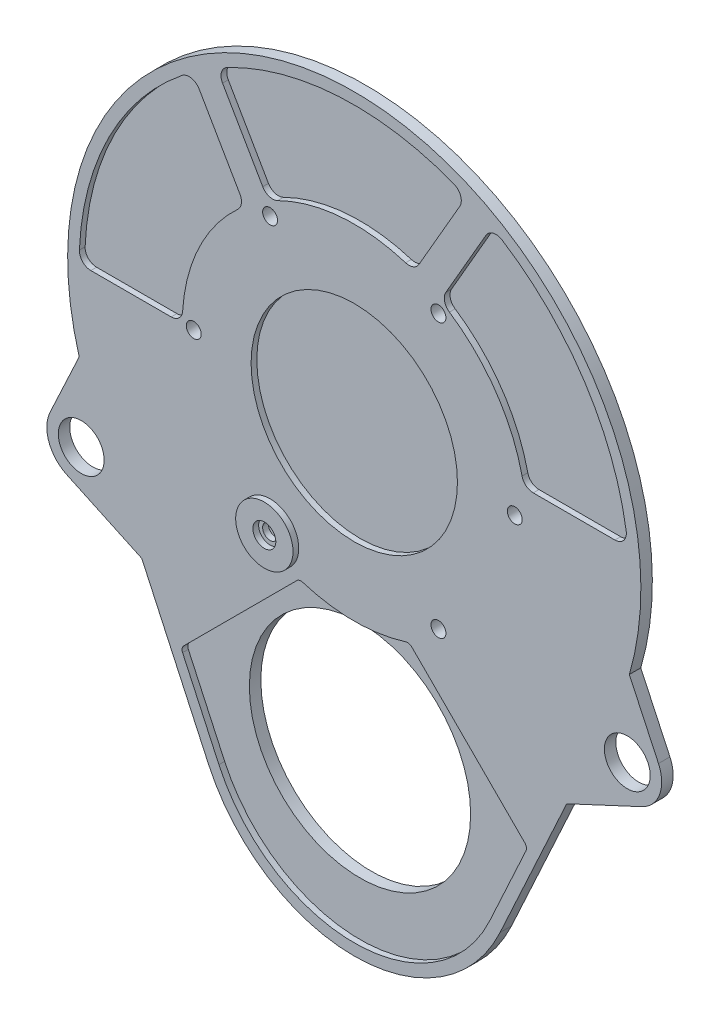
ISO-10303-21;
HEADER;
FILE_DESCRIPTION(('STEP AP214'),'2;1');
FILE_NAME('part.step','',(''),(''),'','','');
FILE_SCHEMA(('AUTOMOTIVE_DESIGN { 1 0 10303 214 1 1 1 1 }'));
ENDSEC;
DATA;
#1=APPLICATION_CONTEXT('core data for automotive mechanical design processes');
#2=APPLICATION_PROTOCOL_DEFINITION('international standard','automotive_design',2000,#1);
#3=PRODUCT_CONTEXT('',#1,'mechanical');
#4=PRODUCT('Part','Part','',(#3));
#5=PRODUCT_RELATED_PRODUCT_CATEGORY('part','',(#4));
#6=PRODUCT_DEFINITION_FORMATION('','',#4);
#7=PRODUCT_DEFINITION_CONTEXT('part definition',#1,'design');
#8=PRODUCT_DEFINITION('design','',#6,#7);
#9=PRODUCT_DEFINITION_SHAPE('','',#8);
#10=(LENGTH_UNIT() NAMED_UNIT(*) SI_UNIT(.MILLI.,.METRE.));
#11=(NAMED_UNIT(*) PLANE_ANGLE_UNIT() SI_UNIT($,.RADIAN.));
#12=(NAMED_UNIT(*) SI_UNIT($,.STERADIAN.) SOLID_ANGLE_UNIT());
#13=UNCERTAINTY_MEASURE_WITH_UNIT(LENGTH_MEASURE(1.E-05),#10,'distance_accuracy_value','');
#14=(GEOMETRIC_REPRESENTATION_CONTEXT(3) GLOBAL_UNCERTAINTY_ASSIGNED_CONTEXT((#13)) GLOBAL_UNIT_ASSIGNED_CONTEXT((#10,
#11,#12)) REPRESENTATION_CONTEXT('',''));
#15=CARTESIAN_POINT('',(0.,0.,0.));
#16=DIRECTION('',(0.,0.,1.));
#17=DIRECTION('',(1.,0.,0.));
#18=AXIS2_PLACEMENT_3D('',#15,#16,#17);
#19=CARTESIAN_POINT('',(-7.34258809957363,-11.92,0.));
#20=DIRECTION('',(0.,0.,1.));
#21=DIRECTION('',(1.,0.,0.));
#22=AXIS2_PLACEMENT_3D('',#19,#20,#21);
#23=CYLINDRICAL_SURFACE('',#22,0.65);
#24=CARTESIAN_POINT('',(-7.34258809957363,-11.92,1.));
#25=DIRECTION('',(0.,0.,1.));
#26=DIRECTION('',(1.,0.,0.));
#27=AXIS2_PLACEMENT_3D('',#24,#25,#26);
#28=CIRCLE('',#27,0.65);
#29=CARTESIAN_POINT('',(-6.69258809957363,-11.92,1.));
#30=VERTEX_POINT('',#29);
#31=EDGE_CURVE('E1080',#30,#30,#28,.T.);
#32=ORIENTED_EDGE('',*,*,#31,.T.);
#33=EDGE_LOOP('',(#32));
#34=FACE_BOUND('',#33,.T.);
#35=CARTESIAN_POINT('',(-7.34258809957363,-11.92,0.5));
#36=DIRECTION('',(0.,0.,-1.));
#37=DIRECTION('',(-1.,0.,0.));
#38=AXIS2_PLACEMENT_3D('',#35,#36,#37);
#39=CIRCLE('',#38,0.65);
#40=CARTESIAN_POINT('',(-7.99258809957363,-11.92,0.5));
#41=VERTEX_POINT('',#40);
#42=EDGE_CURVE('E11',#41,#41,#39,.F.);
#43=ORIENTED_EDGE('',*,*,#42,.F.);
#44=EDGE_LOOP('',(#43));
#45=FACE_BOUND('',#44,.T.);
#46=ADVANCED_FACE('F27',(#34,#45),#23,.F.);
#47=CARTESIAN_POINT('',(23.8156986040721,-13.7499999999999,0.));
#48=DIRECTION('',(0.,0.,1.));
#49=DIRECTION('',(1.,0.,0.));
#50=AXIS2_PLACEMENT_3D('',#47,#48,#49);
#51=PLANE('',#50);
#52=CARTESIAN_POINT('',(-7.34258809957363,-11.92,0.));
#53=DIRECTION('',(0.,0.,-1.));
#54=DIRECTION('',(-1.,0.,0.));
#55=AXIS2_PLACEMENT_3D('',#52,#53,#54);
#56=CIRCLE('',#55,1.25);
#57=CARTESIAN_POINT('',(-8.59258809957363,-11.92,0.));
#58=VERTEX_POINT('',#57);
#59=EDGE_CURVE('E2219',#58,#58,#56,.T.);
#60=ORIENTED_EDGE('',*,*,#59,.T.);
#61=EDGE_LOOP('',(#60));
#62=FACE_BOUND('',#61,.T.);
#63=ADVANCED_FACE('F1177',(#62),#51,.F.);
#64=CARTESIAN_POINT('',(-7.34258809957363,-11.92,0.));
#65=DIRECTION('',(0.,0.,-1.));
#66=DIRECTION('',(-1.,0.,0.));
#67=AXIS2_PLACEMENT_3D('',#64,#65,#66);
#68=CIRCLE('',#67,2.3);
#69=CARTESIAN_POINT('',(-9.64258809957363,-11.92,0.));
#70=VERTEX_POINT('',#69);
#71=EDGE_CURVE('E2164',#70,#70,#68,.T.);
#72=ORIENTED_EDGE('',*,*,#71,.F.);
#73=EDGE_LOOP('',(#72));
#74=FACE_BOUND('',#73,.T.);
#75=CARTESIAN_POINT('',(0.,0.,0.));
#76=DIRECTION('',(0.,0.,1.));
#77=DIRECTION('',(1.,0.,0.));
#78=AXIS2_PLACEMENT_3D('',#75,#76,#77);
#79=CIRCLE('',#78,8.99999999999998);
#80=CARTESIAN_POINT('',(8.99999999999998,0.,0.));
#81=VERTEX_POINT('',#80);
#82=EDGE_CURVE('E35',#81,#81,#79,.F.);
#83=ORIENTED_EDGE('',*,*,#82,.F.);
#84=EDGE_LOOP('',(#83));
#85=FACE_BOUND('',#84,.T.);
#86=CARTESIAN_POINT('',(-10.6230998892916,20.3997487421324,0.));
#87=DIRECTION('',(0.,0.,-1.));
#88=DIRECTION('',(-0.499999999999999,0.866025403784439,0.));
#89=AXIS2_PLACEMENT_3D('',#86,#87,#88);
#90=CIRCLE('',#89,1.);
#91=CARTESIAN_POINT('',(-11.489125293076,19.8997487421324,0.));
#92=VERTEX_POINT('',#91);
#93=CARTESIAN_POINT('',(-11.0849737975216,21.2866943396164,0.));
#94=VERTEX_POINT('',#93);
#95=EDGE_CURVE('E600',#92,#94,#90,.T.);
#96=ORIENTED_EDGE('',*,*,#95,.F.);
#97=DIRECTION('',(-0.499999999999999,0.866025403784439,0.));
#98=VECTOR('',#97,1.);
#99=CARTESIAN_POINT('',(-11.489125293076,19.8997487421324,0.));
#100=LINE('',#99,#98);
#101=CARTESIAN_POINT('',(-7.98435971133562,13.8293166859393,0.));
#102=VERTEX_POINT('',#101);
#103=EDGE_CURVE('E651',#102,#92,#100,.T.);
#104=ORIENTED_EDGE('',*,*,#103,.F.);
#105=CARTESIAN_POINT('',(-7.11833430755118,14.3293166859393,0.));
#106=DIRECTION('',(0.,0.,-1.));
#107=DIRECTION('',(-0.499999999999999,0.866025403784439,0.));
#108=AXIS2_PLACEMENT_3D('',#105,#106,#107);
#109=CIRCLE('',#108,1.);
#110=CARTESIAN_POINT('',(-6.67343841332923,13.4337343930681,0.));
#111=VERTEX_POINT('',#110);
#112=EDGE_CURVE('E648',#111,#102,#109,.T.);
#113=ORIENTED_EDGE('',*,*,#112,.F.);
#114=CARTESIAN_POINT('',(0.,0.,0.));
#115=DIRECTION('',(0.,0.,1.));
#116=DIRECTION('',(-0.499999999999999,0.866025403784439,0.));
#117=AXIS2_PLACEMENT_3D('',#114,#115,#116);
#118=CIRCLE('',#117,15.);
#119=CARTESIAN_POINT('',(4.47671117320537,14.3163912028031,0.));
#120=VERTEX_POINT('',#119);
#121=EDGE_CURVE('E645',#120,#111,#118,.T.);
#122=ORIENTED_EDGE('',*,*,#121,.F.);
#123=CARTESIAN_POINT('',(4.7751585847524,15.2708172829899,0.));
#124=DIRECTION('',(0.,0.,-1.));
#125=DIRECTION('',(-0.499999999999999,0.866025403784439,0.));
#126=AXIS2_PLACEMENT_3D('',#123,#124,#125);
#127=CIRCLE('',#126,1.);
#128=CARTESIAN_POINT('',(5.64118398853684,14.7708172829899,0.));
#129=VERTEX_POINT('',#128);
#130=EDGE_CURVE('E642',#129,#120,#127,.T.);
#131=ORIENTED_EDGE('',*,*,#130,.F.);
#132=DIRECTION('',(-0.499999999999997,-0.86602540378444,0.));
#133=VECTOR('',#132,1.);
#134=CARTESIAN_POINT('',(5.64118398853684,14.7708172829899,0.));
#135=LINE('',#134,#133);
#136=CARTESIAN_POINT('',(9.20100441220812,20.93660712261,0.));
#137=VERTEX_POINT('',#136);
#138=EDGE_CURVE('E639',#137,#129,#135,.T.);
#139=ORIENTED_EDGE('',*,*,#138,.F.);
#140=CARTESIAN_POINT('',(8.33497900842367,21.43660712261,0.));
#141=DIRECTION('',(0.,0.,-1.));
#142=DIRECTION('',(-0.499999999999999,0.866025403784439,0.));
#143=AXIS2_PLACEMENT_3D('',#140,#141,#142);
#144=CIRCLE('',#143,1.);
#145=CARTESIAN_POINT('',(8.69736940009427,22.3686335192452,0.));
#146=VERTEX_POINT('',#145);
#147=EDGE_CURVE('E636',#146,#137,#144,.T.);
#148=ORIENTED_EDGE('',*,*,#147,.F.);
#149=CARTESIAN_POINT('',(0.,0.,0.));
#150=DIRECTION('',(0.,0.,-1.));
#151=DIRECTION('',(-0.499999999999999,0.866025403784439,0.));
#152=AXIS2_PLACEMENT_3D('',#149,#150,#151);
#153=CIRCLE('',#152,24.);
#154=EDGE_CURVE('E633',#94,#146,#153,.T.);
#155=ORIENTED_EDGE('',*,*,#154,.F.);
#156=EDGE_LOOP('',(#96,#104,#113,#122,#131,#139,#148,#155));
#157=FACE_BOUND('',#156,.T.);
#158=CARTESIAN_POINT('',(23.8156986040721,-13.7499999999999,0.));
#159=DIRECTION('',(0.,0.,1.));
#160=DIRECTION('',(1.,0.,0.));
#161=AXIS2_PLACEMENT_3D('',#158,#159,#160);
#162=CIRCLE('',#161,2.);
#163=CARTESIAN_POINT('',(25.8156986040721,-13.7499999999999,0.));
#164=VERTEX_POINT('',#163);
#165=EDGE_CURVE('E1089',#164,#164,#162,.T.);
#166=ORIENTED_EDGE('',*,*,#165,.T.);
#167=EDGE_LOOP('',(#166));
#168=FACE_BOUND('',#167,.T.);
#169=CARTESIAN_POINT('',(23.8156986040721,-13.7499999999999,0.));
#170=DIRECTION('',(0.,0.,1.));
#171=DIRECTION('',(1.,0.,0.));
#172=AXIS2_PLACEMENT_3D('',#169,#170,#171);
#173=CIRCLE('',#172,3.);
#174=CARTESIAN_POINT('',(25.0835533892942,-16.4689233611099,0.));
#175=VERTEX_POINT('',#174);
#176=CARTESIAN_POINT('',(26.5346219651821,-12.4821452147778,0.));
#177=VERTEX_POINT('',#176);
#178=EDGE_CURVE('E1095',#175,#177,#173,.T.);
#179=ORIENTED_EDGE('',*,*,#178,.F.);
#180=DIRECTION('',(0.906307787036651,0.422618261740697,0.));
#181=VECTOR('',#180,1.);
#182=CARTESIAN_POINT('',(18.5332397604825,-19.5233847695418,0.));
#183=LINE('',#182,#181);
#184=CARTESIAN_POINT('',(18.5332397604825,-19.5233847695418,0.));
#185=VERTEX_POINT('',#184);
#186=EDGE_CURVE('E1114',#185,#175,#183,.T.);
#187=ORIENTED_EDGE('',*,*,#186,.F.);
#188=DIRECTION('',(0.41825095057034,0.908331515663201,0.));
#189=VECTOR('',#188,1.);
#190=CARTESIAN_POINT('',(12.7166412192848,-32.1555133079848,0.));
#191=LINE('',#190,#189);
#192=CARTESIAN_POINT('',(12.7166412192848,-32.1555133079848,0.));
#193=VERTEX_POINT('',#192);
#194=EDGE_CURVE('E1112',#193,#185,#191,.T.);
#195=ORIENTED_EDGE('',*,*,#194,.F.);
#196=CARTESIAN_POINT('',(0.,-26.3,0.));
#197=DIRECTION('',(0.,0.,1.));
#198=DIRECTION('',(1.,0.,0.));
#199=AXIS2_PLACEMENT_3D('',#196,#197,#198);
#200=CIRCLE('',#199,14.);
#201=CARTESIAN_POINT('',(-12.7166412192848,-32.1555133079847,0.));
#202=VERTEX_POINT('',#201);
#203=EDGE_CURVE('E1110',#202,#193,#200,.T.);
#204=ORIENTED_EDGE('',*,*,#203,.F.);
#205=DIRECTION('',(0.41825095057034,-0.9083315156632,0.));
#206=VECTOR('',#205,1.);
#207=CARTESIAN_POINT('',(-18.5332397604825,-19.5233847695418,0.));
#208=LINE('',#207,#206);
#209=CARTESIAN_POINT('',(-18.5332397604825,-19.5233847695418,0.));
#210=VERTEX_POINT('',#209);
#211=EDGE_CURVE('E1108',#210,#202,#208,.T.);
#212=ORIENTED_EDGE('',*,*,#211,.F.);
#213=DIRECTION('',(0.906307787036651,-0.422618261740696,0.));
#214=VECTOR('',#213,1.);
#215=CARTESIAN_POINT('',(-25.0835533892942,-16.4689233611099,0.));
#216=LINE('',#215,#214);
#217=CARTESIAN_POINT('',(-25.0835533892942,-16.4689233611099,0.));
#218=VERTEX_POINT('',#217);
#219=EDGE_CURVE('E1106',#218,#210,#216,.T.);
#220=ORIENTED_EDGE('',*,*,#219,.F.);
#221=CARTESIAN_POINT('',(-23.8156986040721,-13.7499999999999,0.));
#222=DIRECTION('',(0.,0.,1.));
#223=DIRECTION('',(1.,0.,0.));
#224=AXIS2_PLACEMENT_3D('',#221,#222,#223);
#225=CIRCLE('',#224,3.);
#226=CARTESIAN_POINT('',(-26.5346219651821,-12.4821452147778,0.));
#227=VERTEX_POINT('',#226);
#228=EDGE_CURVE('E1104',#227,#218,#225,.T.);
#229=ORIENTED_EDGE('',*,*,#228,.F.);
#230=DIRECTION('',(-0.422618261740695,-0.906307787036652,0.));
#231=VECTOR('',#230,1.);
#232=CARTESIAN_POINT('',(-23.9916214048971,-7.02866291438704,0.));
#233=LINE('',#232,#231);
#234=CARTESIAN_POINT('',(-23.9916214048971,-7.02866291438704,0.));
#235=VERTEX_POINT('',#234);
#236=EDGE_CURVE('E1102',#235,#227,#233,.T.);
#237=ORIENTED_EDGE('',*,*,#236,.F.);
#238=CARTESIAN_POINT('',(0.,0.,0.));
#239=DIRECTION('',(0.,0.,1.));
#240=DIRECTION('',(1.,0.,0.));
#241=AXIS2_PLACEMENT_3D('',#238,#239,#240);
#242=CIRCLE('',#241,25.);
#243=CARTESIAN_POINT('',(23.9916214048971,-7.02866291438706,0.));
#244=VERTEX_POINT('',#243);
#245=EDGE_CURVE('E1100',#244,#235,#242,.T.);
#246=ORIENTED_EDGE('',*,*,#245,.F.);
#247=DIRECTION('',(-0.422618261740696,0.906307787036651,0.));
#248=VECTOR('',#247,1.);
#249=CARTESIAN_POINT('',(26.5346219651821,-12.4821452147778,0.));
#250=LINE('',#249,#248);
#251=EDGE_CURVE('E1098',#177,#244,#250,.T.);
#252=ORIENTED_EDGE('',*,*,#251,.F.);
#253=EDGE_LOOP('',(#179,#187,#195,#204,#212,#220,#229,#237,#246,#252));
#254=FACE_BOUND('',#253,.T.);
#255=CARTESIAN_POINT('',(-23.8156986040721,-13.7499999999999,0.));
#256=DIRECTION('',(0.,0.,1.));
#257=DIRECTION('',(1.,0.,0.));
#258=AXIS2_PLACEMENT_3D('',#255,#256,#257);
#259=CIRCLE('',#258,2.);
#260=CARTESIAN_POINT('',(-21.8156986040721,-13.7499999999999,0.));
#261=VERTEX_POINT('',#260);
#262=EDGE_CURVE('E1083',#261,#261,#259,.T.);
#263=ORIENTED_EDGE('',*,*,#262,.T.);
#264=EDGE_LOOP('',(#263));
#265=FACE_BOUND('',#264,.T.);
#266=CARTESIAN_POINT('',(7.34258809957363,-11.92,0.));
#267=DIRECTION('',(0.,0.,1.));
#268=DIRECTION('',(1.,0.,0.));
#269=AXIS2_PLACEMENT_3D('',#266,#267,#268);
#270=CIRCLE('',#269,0.65);
#271=CARTESIAN_POINT('',(7.99258809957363,-11.92,0.));
#272=VERTEX_POINT('',#271);
#273=EDGE_CURVE('E1077',#272,#272,#270,.T.);
#274=ORIENTED_EDGE('',*,*,#273,.T.);
#275=EDGE_LOOP('',(#274));
#276=FACE_BOUND('',#275,.T.);
#277=CARTESIAN_POINT('',(14.,0.,0.));
#278=DIRECTION('',(0.,0.,1.));
#279=DIRECTION('',(1.,0.,0.));
#280=AXIS2_PLACEMENT_3D('',#277,#278,#279);
#281=CIRCLE('',#280,0.649999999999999);
#282=CARTESIAN_POINT('',(14.65,0.,0.));
#283=VERTEX_POINT('',#282);
#284=EDGE_CURVE('E1071',#283,#283,#281,.T.);
#285=ORIENTED_EDGE('',*,*,#284,.T.);
#286=EDGE_LOOP('',(#285));
#287=FACE_BOUND('',#286,.T.);
#288=CARTESIAN_POINT('',(-14.,0.,0.));
#289=DIRECTION('',(0.,0.,1.));
#290=DIRECTION('',(1.,0.,0.));
#291=AXIS2_PLACEMENT_3D('',#288,#289,#290);
#292=CIRCLE('',#291,0.649999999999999);
#293=CARTESIAN_POINT('',(-13.35,0.,0.));
#294=VERTEX_POINT('',#293);
#295=EDGE_CURVE('E1065',#294,#294,#292,.T.);
#296=ORIENTED_EDGE('',*,*,#295,.T.);
#297=EDGE_LOOP('',(#296));
#298=FACE_BOUND('',#297,.T.);
#299=CARTESIAN_POINT('',(7.34258809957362,11.92,0.));
#300=DIRECTION('',(0.,0.,1.));
#301=DIRECTION('',(1.,0.,0.));
#302=AXIS2_PLACEMENT_3D('',#299,#300,#301);
#303=CIRCLE('',#302,0.649999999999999);
#304=CARTESIAN_POINT('',(7.99258809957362,11.92,0.));
#305=VERTEX_POINT('',#304);
#306=EDGE_CURVE('E1059',#305,#305,#303,.T.);
#307=ORIENTED_EDGE('',*,*,#306,.T.);
#308=EDGE_LOOP('',(#307));
#309=FACE_BOUND('',#308,.T.);
#310=CARTESIAN_POINT('',(-7.34258809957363,11.92,0.));
#311=DIRECTION('',(0.,0.,1.));
#312=DIRECTION('',(1.,0.,0.));
#313=AXIS2_PLACEMENT_3D('',#310,#311,#312);
#314=CIRCLE('',#313,0.65);
#315=CARTESIAN_POINT('',(-6.69258809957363,11.92,0.));
#316=VERTEX_POINT('',#315);
#317=EDGE_CURVE('E1053',#316,#316,#314,.T.);
#318=ORIENTED_EDGE('',*,*,#317,.T.);
#319=EDGE_LOOP('',(#318));
#320=FACE_BOUND('',#319,.T.);
#321=CARTESIAN_POINT('',(-22.9782505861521,1.,0.));
#322=DIRECTION('',(0.,0.,-1.));
#323=DIRECTION('',(-1.,0.,0.));
#324=AXIS2_PLACEMENT_3D('',#321,#322,#323);
#325=CIRCLE('',#324,1.);
#326=CARTESIAN_POINT('',(-22.9782505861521,0.,0.));
#327=VERTEX_POINT('',#326);
#328=CARTESIAN_POINT('',(-23.977304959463,1.04347826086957,0.));
#329=VERTEX_POINT('',#328);
#330=EDGE_CURVE('E695',#327,#329,#325,.T.);
#331=ORIENTED_EDGE('',*,*,#330,.F.);
#332=DIRECTION('',(-1.,0.,0.));
#333=VECTOR('',#332,1.);
#334=CARTESIAN_POINT('',(-22.9782505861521,0.,0.));
#335=LINE('',#334,#333);
#336=CARTESIAN_POINT('',(-15.9687194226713,0.,0.));
#337=VERTEX_POINT('',#336);
#338=EDGE_CURVE('E716',#337,#327,#335,.T.);
#339=ORIENTED_EDGE('',*,*,#338,.F.);
#340=CARTESIAN_POINT('',(-15.9687194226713,1.,0.));
#341=DIRECTION('',(0.,0.,-1.));
#342=DIRECTION('',(-1.,0.,0.));
#343=AXIS2_PLACEMENT_3D('',#340,#341,#342);
#344=CIRCLE('',#343,1.);
#345=CARTESIAN_POINT('',(-14.9706744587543,0.9375,0.));
#346=VERTEX_POINT('',#345);
#347=EDGE_CURVE('E713',#346,#337,#344,.T.);
#348=ORIENTED_EDGE('',*,*,#347,.F.);
#349=CARTESIAN_POINT('',(0.,0.,0.));
#350=DIRECTION('',(0.,0.,1.));
#351=DIRECTION('',(-1.,0.,0.));
#352=AXIS2_PLACEMENT_3D('',#349,#350,#351);
#353=CIRCLE('',#352,15.);
#354=CARTESIAN_POINT('',(-10.1600028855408,11.035141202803,0.));
#355=VERTEX_POINT('',#354);
#356=EDGE_CURVE('E710',#355,#346,#353,.T.);
#357=ORIENTED_EDGE('',*,*,#356,.F.);
#358=CARTESIAN_POINT('',(-10.8373364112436,11.7708172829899,0.));
#359=DIRECTION('',(0.,0.,-1.));
#360=DIRECTION('',(-1.,0.,0.));
#361=AXIS2_PLACEMENT_3D('',#358,#359,#360);
#362=CIRCLE('',#361,1.);
#363=CARTESIAN_POINT('',(-9.97131100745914,12.2708172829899,0.));
#364=VERTEX_POINT('',#363);
#365=EDGE_CURVE('E707',#364,#355,#362,.T.);
#366=ORIENTED_EDGE('',*,*,#365,.F.);
#367=DIRECTION('',(0.500000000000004,-0.866025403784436,0.));
#368=VECTOR('',#367,1.);
#369=CARTESIAN_POINT('',(-9.97131100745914,12.2708172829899,0.));
#370=LINE('',#369,#368);
#371=CARTESIAN_POINT('',(-13.5311314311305,18.4366071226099,0.));
#372=VERTEX_POINT('',#371);
#373=EDGE_CURVE('E704',#372,#364,#370,.T.);
#374=ORIENTED_EDGE('',*,*,#373,.F.);
#375=CARTESIAN_POINT('',(-14.3971568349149,17.9366071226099,0.));
#376=DIRECTION('',(0.,0.,-1.));
#377=DIRECTION('',(-1.,0.,0.));
#378=AXIS2_PLACEMENT_3D('',#375,#376,#377);
#379=CIRCLE('',#378,1.);
#380=CARTESIAN_POINT('',(-15.0231201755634,18.7164596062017,0.));
#381=VERTEX_POINT('',#380);
#382=EDGE_CURVE('E701',#381,#372,#379,.T.);
#383=ORIENTED_EDGE('',*,*,#382,.F.);
#384=CARTESIAN_POINT('',(0.,0.,0.));
#385=DIRECTION('',(0.,0.,-1.));
#386=DIRECTION('',(-1.,0.,0.));
#387=AXIS2_PLACEMENT_3D('',#384,#385,#386);
#388=CIRCLE('',#387,24.);
#389=EDGE_CURVE('E698',#329,#381,#388,.T.);
#390=ORIENTED_EDGE('',*,*,#389,.F.);
#391=EDGE_LOOP('',(#331,#339,#348,#357,#366,#374,#383,#390));
#392=FACE_BOUND('',#391,.T.);
#393=CARTESIAN_POINT('',(12.3551506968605,19.3997487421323,0.));
#394=DIRECTION('',(0.,0.,-1.));
#395=DIRECTION('',(0.500000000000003,0.866025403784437,0.));
#396=AXIS2_PLACEMENT_3D('',#393,#394,#395);
#397=CIRCLE('',#396,1.);
#398=CARTESIAN_POINT('',(11.4891252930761,19.8997487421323,0.));
#399=VERTEX_POINT('',#398);
#400=CARTESIAN_POINT('',(12.8923311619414,20.2432160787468,0.));
#401=VERTEX_POINT('',#400);
#402=EDGE_CURVE('E565',#399,#401,#397,.T.);
#403=ORIENTED_EDGE('',*,*,#402,.F.);
#404=DIRECTION('',(0.500000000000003,0.866025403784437,0.));
#405=VECTOR('',#404,1.);
#406=CARTESIAN_POINT('',(11.4891252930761,19.8997487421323,0.));
#407=LINE('',#406,#405);
#408=CARTESIAN_POINT('',(7.98435971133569,13.8293166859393,0.));
#409=VERTEX_POINT('',#408);
#410=EDGE_CURVE('E590',#409,#399,#407,.T.);
#411=ORIENTED_EDGE('',*,*,#410,.F.);
#412=CARTESIAN_POINT('',(8.85038511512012,13.3293166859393,0.));
#413=DIRECTION('',(0.,0.,-1.));
#414=DIRECTION('',(0.500000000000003,0.866025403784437,0.));
#415=AXIS2_PLACEMENT_3D('',#412,#413,#414);
#416=CIRCLE('',#415,1.);
#417=CARTESIAN_POINT('',(8.29723604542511,12.4962343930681,0.));
#418=VERTEX_POINT('',#417);
#419=EDGE_CURVE('E586',#418,#409,#416,.T.);
#420=ORIENTED_EDGE('',*,*,#419,.F.);
#421=CARTESIAN_POINT('',(0.,0.,0.));
#422=DIRECTION('',(0.,0.,1.));
#423=DIRECTION('',(0.500000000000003,0.866025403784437,0.));
#424=AXIS2_PLACEMENT_3D('',#421,#422,#423);
#425=CIRCLE('',#424,15.);
#426=CARTESIAN_POINT('',(14.6367140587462,3.28125000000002,0.));
#427=VERTEX_POINT('',#426);
#428=EDGE_CURVE('E582',#427,#418,#425,.T.);
#429=ORIENTED_EDGE('',*,*,#428,.F.);
#430=CARTESIAN_POINT('',(15.612494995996,3.50000000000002,0.));
#431=DIRECTION('',(0.,0.,-1.));
#432=DIRECTION('',(0.500000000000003,0.866025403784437,0.));
#433=AXIS2_PLACEMENT_3D('',#430,#431,#432);
#434=CIRCLE('',#433,1.);
#435=CARTESIAN_POINT('',(15.612494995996,2.50000000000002,0.));
#436=VERTEX_POINT('',#435);
#437=EDGE_CURVE('E578',#436,#427,#434,.T.);
#438=ORIENTED_EDGE('',*,*,#437,.F.);
#439=DIRECTION('',(-1.,0.,0.));
#440=VECTOR('',#439,1.);
#441=CARTESIAN_POINT('',(15.612494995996,2.50000000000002,0.));
#442=LINE('',#441,#440);
#443=CARTESIAN_POINT('',(22.7321358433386,2.50000000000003,0.));
#444=VERTEX_POINT('',#443);
#445=EDGE_CURVE('E574',#444,#436,#442,.T.);
#446=ORIENTED_EDGE('',*,*,#445,.F.);
#447=CARTESIAN_POINT('',(22.7321358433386,3.50000000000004,0.));
#448=DIRECTION('',(0.,0.,-1.));
#449=DIRECTION('',(0.500000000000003,0.866025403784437,0.));
#450=AXIS2_PLACEMENT_3D('',#447,#448,#449);
#451=CIRCLE('',#450,1.);
#452=CARTESIAN_POINT('',(23.7204895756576,3.65217391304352,0.));
#453=VERTEX_POINT('',#452);
#454=EDGE_CURVE('E569',#453,#444,#451,.T.);
#455=ORIENTED_EDGE('',*,*,#454,.F.);
#456=CARTESIAN_POINT('',(0.,0.,0.));
#457=DIRECTION('',(0.,0.,-1.));
#458=DIRECTION('',(0.500000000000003,0.866025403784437,0.));
#459=AXIS2_PLACEMENT_3D('',#456,#457,#458);
#460=CIRCLE('',#459,24.);
#461=EDGE_CURVE('E570',#401,#453,#460,.T.);
#462=ORIENTED_EDGE('',*,*,#461,.F.);
#463=EDGE_LOOP('',(#403,#411,#420,#429,#438,#446,#455,#462));
#464=FACE_BOUND('',#463,.T.);
#465=CARTESIAN_POINT('',(-14.5203075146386,-24.6520588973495,0.));
#466=DIRECTION('',(0.,0.,-1.));
#467=DIRECTION('',(-1.,0.,0.));
#468=AXIS2_PLACEMENT_3D('',#465,#466,#467);
#469=CIRCLE('',#468,0.5);
#470=CARTESIAN_POINT('',(-14.9744732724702,-24.8611843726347,0.));
#471=VERTEX_POINT('',#470);
#472=CARTESIAN_POINT('',(-14.8738609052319,-24.2985055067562,0.));
#473=VERTEX_POINT('',#472);
#474=EDGE_CURVE('E508',#471,#473,#469,.T.);
#475=ORIENTED_EDGE('',*,*,#474,.F.);
#476=DIRECTION('',(-0.41825095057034,0.9083315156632,0.));
#477=VECTOR('',#476,1.);
#478=CARTESIAN_POINT('',(-14.9744732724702,-24.8611843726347,0.));
#479=LINE('',#478,#477);
#480=CARTESIAN_POINT('',(-11.8083097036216,-31.7372623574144,0.));
#481=VERTEX_POINT('',#480);
#482=EDGE_CURVE('E511',#481,#471,#479,.T.);
#483=ORIENTED_EDGE('',*,*,#482,.F.);
#484=CARTESIAN_POINT('',(0.,-26.3,0.));
#485=DIRECTION('',(0.,0.,-1.));
#486=DIRECTION('',(-1.,0.,0.));
#487=AXIS2_PLACEMENT_3D('',#484,#485,#486);
#488=CIRCLE('',#487,13.);
#489=CARTESIAN_POINT('',(11.8083097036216,-31.7372623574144,0.));
#490=VERTEX_POINT('',#489);
#491=EDGE_CURVE('E528',#490,#481,#488,.T.);
#492=ORIENTED_EDGE('',*,*,#491,.F.);
#493=DIRECTION('',(-0.41825095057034,-0.9083315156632,0.));
#494=VECTOR('',#493,1.);
#495=CARTESIAN_POINT('',(11.8083097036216,-31.7372623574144,0.));
#496=LINE('',#495,#494);
#497=CARTESIAN_POINT('',(14.9744732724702,-24.8611843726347,0.));
#498=VERTEX_POINT('',#497);
#499=EDGE_CURVE('E2182',#498,#490,#496,.T.);
#500=ORIENTED_EDGE('',*,*,#499,.F.);
#501=CARTESIAN_POINT('',(14.5203075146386,-24.6520588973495,0.));
#502=DIRECTION('',(0.,0.,-1.));
#503=DIRECTION('',(-1.,0.,0.));
#504=AXIS2_PLACEMENT_3D('',#501,#502,#503);
#505=CIRCLE('',#504,0.5);
#506=CARTESIAN_POINT('',(14.8738609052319,-24.2985055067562,0.));
#507=VERTEX_POINT('',#506);
#508=EDGE_CURVE('E2179',#507,#498,#505,.T.);
#509=ORIENTED_EDGE('',*,*,#508,.F.);
#510=DIRECTION('',(0.707106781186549,-0.707106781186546,0.));
#511=VECTOR('',#510,1.);
#512=CARTESIAN_POINT('',(14.8738609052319,-24.2985055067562,0.));
#513=LINE('',#512,#511);
#514=CARTESIAN_POINT('',(5.00682907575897,-14.4314736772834,0.));
#515=VERTEX_POINT('',#514);
#516=EDGE_CURVE('E2176',#515,#507,#513,.T.);
#517=ORIENTED_EDGE('',*,*,#516,.F.);
#518=CARTESIAN_POINT('',(4.6532756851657,-14.7850270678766,0.));
#519=DIRECTION('',(0.,0.,-1.));
#520=DIRECTION('',(-1.,0.,0.));
#521=AXIS2_PLACEMENT_3D('',#518,#519,#520);
#522=CIRCLE('',#521,0.5);
#523=CARTESIAN_POINT('',(4.50317001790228,-14.3080907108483,0.));
#524=VERTEX_POINT('',#523);
#525=EDGE_CURVE('E2173',#524,#515,#522,.T.);
#526=ORIENTED_EDGE('',*,*,#525,.F.);
#527=CARTESIAN_POINT('',(0.,0.,0.));
#528=DIRECTION('',(0.,0.,1.));
#529=DIRECTION('',(-1.,0.,0.));
#530=AXIS2_PLACEMENT_3D('',#527,#528,#529);
#531=CIRCLE('',#530,15.);
#532=CARTESIAN_POINT('',(-4.50317001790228,-14.3080907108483,0.));
#533=VERTEX_POINT('',#532);
#534=EDGE_CURVE('E2170',#533,#524,#531,.T.);
#535=ORIENTED_EDGE('',*,*,#534,.F.);
#536=CARTESIAN_POINT('',(-4.6532756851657,-14.7850270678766,0.));
#537=DIRECTION('',(0.,0.,-1.));
#538=DIRECTION('',(-1.,0.,0.));
#539=AXIS2_PLACEMENT_3D('',#536,#537,#538);
#540=CIRCLE('',#539,0.5);
#541=CARTESIAN_POINT('',(-5.00682907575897,-14.4314736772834,0.));
#542=VERTEX_POINT('',#541);
#543=EDGE_CURVE('E47',#542,#533,#540,.T.);
#544=ORIENTED_EDGE('',*,*,#543,.F.);
#545=DIRECTION('',(0.707106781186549,0.707106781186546,0.));
#546=VECTOR('',#545,1.);
#547=CARTESIAN_POINT('',(-5.00682907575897,-14.4314736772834,0.));
#548=LINE('',#547,#546);
#549=EDGE_CURVE('E42',#473,#542,#548,.T.);
#550=ORIENTED_EDGE('',*,*,#549,.F.);
#551=EDGE_LOOP('',(#475,#483,#492,#500,#509,#517,#526,#535,#544,#550));
#552=FACE_BOUND('',#551,.T.);
#553=ADVANCED_FACE('F510',(#74,#85,#157,#168,#254,#265,#276,#287,#298,#309,#320,#392,#464,#552),
#51,.F.);
#554=CARTESIAN_POINT('',(23.8156986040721,-13.7499999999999,1.));
#555=DIRECTION('',(0.,0.,1.));
#556=DIRECTION('',(1.,0.,0.));
#557=AXIS2_PLACEMENT_3D('',#554,#555,#556);
#558=PLANE('',#557);
#559=CARTESIAN_POINT('',(0.,-26.3,1.));
#560=DIRECTION('',(0.,0.,1.));
#561=DIRECTION('',(1.,0.,0.));
#562=AXIS2_PLACEMENT_3D('',#559,#560,#561);
#563=CIRCLE('',#562,13.);
#564=CARTESIAN_POINT('',(-11.8083097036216,-31.7372623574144,1.));
#565=VERTEX_POINT('',#564);
#566=CARTESIAN_POINT('',(11.8083097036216,-31.7372623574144,1.));
#567=VERTEX_POINT('',#566);
#568=EDGE_CURVE('E772',#565,#567,#563,.T.);
#569=ORIENTED_EDGE('',*,*,#568,.F.);
#570=DIRECTION('',(0.41825095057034,-0.9083315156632,0.));
#571=VECTOR('',#570,1.);
#572=CARTESIAN_POINT('',(-14.9744732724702,-24.8611843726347,1.));
#573=LINE('',#572,#571);
#574=CARTESIAN_POINT('',(-14.9744732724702,-24.8611843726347,1.));
#575=VERTEX_POINT('',#574);
#576=EDGE_CURVE('E798',#575,#565,#573,.T.);
#577=ORIENTED_EDGE('',*,*,#576,.F.);
#578=CARTESIAN_POINT('',(-14.5203075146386,-24.6520588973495,1.));
#579=DIRECTION('',(0.,0.,1.));
#580=DIRECTION('',(-1.,0.,0.));
#581=AXIS2_PLACEMENT_3D('',#578,#579,#580);
#582=CIRCLE('',#581,0.5);
#583=CARTESIAN_POINT('',(-14.8738609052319,-24.2985055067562,1.));
#584=VERTEX_POINT('',#583);
#585=EDGE_CURVE('E795',#584,#575,#582,.T.);
#586=ORIENTED_EDGE('',*,*,#585,.F.);
#587=DIRECTION('',(-0.707106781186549,-0.707106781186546,0.));
#588=VECTOR('',#587,1.);
#589=CARTESIAN_POINT('',(-5.00682907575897,-14.4314736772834,1.));
#590=LINE('',#589,#588);
#591=CARTESIAN_POINT('',(-5.00682907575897,-14.4314736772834,1.));
#592=VERTEX_POINT('',#591);
#593=EDGE_CURVE('E792',#592,#584,#590,.T.);
#594=ORIENTED_EDGE('',*,*,#593,.F.);
#595=CARTESIAN_POINT('',(-4.6532756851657,-14.7850270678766,1.));
#596=DIRECTION('',(0.,0.,1.));
#597=DIRECTION('',(-1.,0.,0.));
#598=AXIS2_PLACEMENT_3D('',#595,#596,#597);
#599=CIRCLE('',#598,0.5);
#600=CARTESIAN_POINT('',(-4.50317001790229,-14.3080907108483,1.));
#601=VERTEX_POINT('',#600);
#602=EDGE_CURVE('E789',#601,#592,#599,.T.);
#603=ORIENTED_EDGE('',*,*,#602,.F.);
#604=CARTESIAN_POINT('',(0.,0.,1.));
#605=DIRECTION('',(0.,0.,-1.));
#606=DIRECTION('',(1.,0.,0.));
#607=AXIS2_PLACEMENT_3D('',#604,#605,#606);
#608=CIRCLE('',#607,15.);
#609=CARTESIAN_POINT('',(4.50317001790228,-14.3080907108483,1.));
#610=VERTEX_POINT('',#609);
#611=EDGE_CURVE('E786',#610,#601,#608,.T.);
#612=ORIENTED_EDGE('',*,*,#611,.F.);
#613=CARTESIAN_POINT('',(4.6532756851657,-14.7850270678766,1.));
#614=DIRECTION('',(0.,0.,1.));
#615=DIRECTION('',(1.,0.,0.));
#616=AXIS2_PLACEMENT_3D('',#613,#614,#615);
#617=CIRCLE('',#616,0.5);
#618=CARTESIAN_POINT('',(5.00682907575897,-14.4314736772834,1.));
#619=VERTEX_POINT('',#618);
#620=EDGE_CURVE('E783',#619,#610,#617,.T.);
#621=ORIENTED_EDGE('',*,*,#620,.F.);
#622=DIRECTION('',(-0.707106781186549,0.707106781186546,0.));
#623=VECTOR('',#622,1.);
#624=CARTESIAN_POINT('',(5.00682907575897,-14.4314736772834,1.));
#625=LINE('',#624,#623);
#626=CARTESIAN_POINT('',(14.8738609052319,-24.2985055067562,1.));
#627=VERTEX_POINT('',#626);
#628=EDGE_CURVE('E780',#627,#619,#625,.T.);
#629=ORIENTED_EDGE('',*,*,#628,.F.);
#630=CARTESIAN_POINT('',(14.5203075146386,-24.6520588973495,1.));
#631=DIRECTION('',(0.,0.,1.));
#632=DIRECTION('',(-1.,0.,0.));
#633=AXIS2_PLACEMENT_3D('',#630,#631,#632);
#634=CIRCLE('',#633,0.5);
#635=CARTESIAN_POINT('',(14.9744732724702,-24.8611843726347,1.));
#636=VERTEX_POINT('',#635);
#637=EDGE_CURVE('E777',#636,#627,#634,.T.);
#638=ORIENTED_EDGE('',*,*,#637,.F.);
#639=DIRECTION('',(0.41825095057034,0.9083315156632,0.));
#640=VECTOR('',#639,1.);
#641=CARTESIAN_POINT('',(14.9744732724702,-24.8611843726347,1.));
#642=LINE('',#641,#640);
#643=EDGE_CURVE('E774',#567,#636,#642,.T.);
#644=ORIENTED_EDGE('',*,*,#643,.F.);
#645=EDGE_LOOP('',(#569,#577,#586,#594,#603,#612,#621,#629,#638,#644));
#646=FACE_BOUND('',#645,.T.);
#647=CARTESIAN_POINT('',(0.,0.,1.));
#648=DIRECTION('',(0.,0.,1.));
#649=DIRECTION('',(1.,0.,0.));
#650=AXIS2_PLACEMENT_3D('',#647,#648,#649);
#651=CIRCLE('',#650,8.99999999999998);
#652=CARTESIAN_POINT('',(8.99999999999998,0.,1.));
#653=VERTEX_POINT('',#652);
#654=EDGE_CURVE('E834',#653,#653,#651,.T.);
#655=ORIENTED_EDGE('',*,*,#654,.F.);
#656=EDGE_LOOP('',(#655));
#657=FACE_BOUND('',#656,.T.);
#658=CARTESIAN_POINT('',(12.3551506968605,19.3997487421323,1.));
#659=DIRECTION('',(0.,0.,1.));
#660=DIRECTION('',(0.500000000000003,0.866025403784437,0.));
#661=AXIS2_PLACEMENT_3D('',#658,#659,#660);
#662=CIRCLE('',#661,1.);
#663=CARTESIAN_POINT('',(12.8923311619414,20.2432160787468,1.));
#664=VERTEX_POINT('',#663);
#665=CARTESIAN_POINT('',(11.4891252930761,19.8997487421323,1.));
#666=VERTEX_POINT('',#665);
#667=EDGE_CURVE('E865',#664,#666,#662,.T.);
#668=ORIENTED_EDGE('',*,*,#667,.F.);
#669=CARTESIAN_POINT('',(0.,0.,1.));
#670=DIRECTION('',(0.,0.,1.));
#671=DIRECTION('',(-0.500000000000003,-0.866025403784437,0.));
#672=AXIS2_PLACEMENT_3D('',#669,#670,#671);
#673=CIRCLE('',#672,24.);
#674=CARTESIAN_POINT('',(23.7204895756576,3.65217391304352,1.));
#675=VERTEX_POINT('',#674);
#676=EDGE_CURVE('E900',#675,#664,#673,.T.);
#677=ORIENTED_EDGE('',*,*,#676,.F.);
#678=CARTESIAN_POINT('',(22.7321358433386,3.50000000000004,1.));
#679=DIRECTION('',(0.,0.,1.));
#680=DIRECTION('',(0.500000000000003,0.866025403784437,0.));
#681=AXIS2_PLACEMENT_3D('',#678,#679,#680);
#682=CIRCLE('',#681,1.);
#683=CARTESIAN_POINT('',(22.7321358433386,2.50000000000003,1.));
#684=VERTEX_POINT('',#683);
#685=EDGE_CURVE('E904',#684,#675,#682,.T.);
#686=ORIENTED_EDGE('',*,*,#685,.F.);
#687=DIRECTION('',(1.,0.,0.));
#688=VECTOR('',#687,1.);
#689=CARTESIAN_POINT('',(22.7321358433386,2.50000000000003,1.));
#690=LINE('',#689,#688);
#691=CARTESIAN_POINT('',(15.612494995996,2.50000000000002,1.));
#692=VERTEX_POINT('',#691);
#693=EDGE_CURVE('E907',#692,#684,#690,.T.);
#694=ORIENTED_EDGE('',*,*,#693,.F.);
#695=CARTESIAN_POINT('',(15.612494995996,3.50000000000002,1.));
#696=DIRECTION('',(0.,0.,1.));
#697=DIRECTION('',(0.500000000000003,0.866025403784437,0.));
#698=AXIS2_PLACEMENT_3D('',#695,#696,#697);
#699=CIRCLE('',#698,1.);
#700=CARTESIAN_POINT('',(14.6367140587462,3.28125000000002,1.));
#701=VERTEX_POINT('',#700);
#702=EDGE_CURVE('E910',#701,#692,#699,.T.);
#703=ORIENTED_EDGE('',*,*,#702,.F.);
#704=CARTESIAN_POINT('',(0.,0.,1.));
#705=DIRECTION('',(0.,0.,-1.));
#706=DIRECTION('',(-0.500000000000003,-0.866025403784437,0.));
#707=AXIS2_PLACEMENT_3D('',#704,#705,#706);
#708=CIRCLE('',#707,15.);
#709=CARTESIAN_POINT('',(8.29723604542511,12.4962343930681,1.));
#710=VERTEX_POINT('',#709);
#711=EDGE_CURVE('E913',#710,#701,#708,.T.);
#712=ORIENTED_EDGE('',*,*,#711,.F.);
#713=CARTESIAN_POINT('',(8.85038511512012,13.3293166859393,1.));
#714=DIRECTION('',(0.,0.,1.));
#715=DIRECTION('',(0.500000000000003,0.866025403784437,0.));
#716=AXIS2_PLACEMENT_3D('',#713,#714,#715);
#717=CIRCLE('',#716,1.);
#718=CARTESIAN_POINT('',(7.98435971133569,13.8293166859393,1.));
#719=VERTEX_POINT('',#718);
#720=EDGE_CURVE('E916',#719,#710,#717,.T.);
#721=ORIENTED_EDGE('',*,*,#720,.F.);
#722=DIRECTION('',(-0.500000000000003,-0.866025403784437,0.));
#723=VECTOR('',#722,1.);
#724=CARTESIAN_POINT('',(11.4891252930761,19.8997487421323,1.));
#725=LINE('',#724,#723);
#726=EDGE_CURVE('E919',#666,#719,#725,.T.);
#727=ORIENTED_EDGE('',*,*,#726,.F.);
#728=EDGE_LOOP('',(#668,#677,#686,#694,#703,#712,#721,#727));
#729=FACE_BOUND('',#728,.T.);
#730=CARTESIAN_POINT('',(-10.6230998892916,20.3997487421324,1.));
#731=DIRECTION('',(0.,0.,1.));
#732=DIRECTION('',(-0.499999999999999,0.866025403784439,0.));
#733=AXIS2_PLACEMENT_3D('',#730,#731,#732);
#734=CIRCLE('',#733,1.);
#735=CARTESIAN_POINT('',(-11.0849737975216,21.2866943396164,1.));
#736=VERTEX_POINT('',#735);
#737=CARTESIAN_POINT('',(-11.489125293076,19.8997487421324,1.));
#738=VERTEX_POINT('',#737);
#739=EDGE_CURVE('E903',#736,#738,#734,.T.);
#740=ORIENTED_EDGE('',*,*,#739,.F.);
#741=CARTESIAN_POINT('',(0.,0.,1.));
#742=DIRECTION('',(0.,0.,1.));
#743=DIRECTION('',(0.499999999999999,-0.866025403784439,0.));
#744=AXIS2_PLACEMENT_3D('',#741,#742,#743);
#745=CIRCLE('',#744,24.);
#746=CARTESIAN_POINT('',(8.69736940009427,22.3686335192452,1.));
#747=VERTEX_POINT('',#746);
#748=EDGE_CURVE('E942',#747,#736,#745,.T.);
#749=ORIENTED_EDGE('',*,*,#748,.F.);
#750=CARTESIAN_POINT('',(8.33497900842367,21.43660712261,1.));
#751=DIRECTION('',(0.,0.,1.));
#752=DIRECTION('',(-0.499999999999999,0.866025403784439,0.));
#753=AXIS2_PLACEMENT_3D('',#750,#751,#752);
#754=CIRCLE('',#753,1.);
#755=CARTESIAN_POINT('',(9.20100441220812,20.93660712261,1.));
#756=VERTEX_POINT('',#755);
#757=EDGE_CURVE('E939',#756,#747,#754,.T.);
#758=ORIENTED_EDGE('',*,*,#757,.F.);
#759=DIRECTION('',(0.499999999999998,0.86602540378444,0.));
#760=VECTOR('',#759,1.);
#761=CARTESIAN_POINT('',(9.20100441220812,20.93660712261,1.));
#762=LINE('',#761,#760);
#763=CARTESIAN_POINT('',(5.64118398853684,14.7708172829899,1.));
#764=VERTEX_POINT('',#763);
#765=EDGE_CURVE('E936',#764,#756,#762,.T.);
#766=ORIENTED_EDGE('',*,*,#765,.F.);
#767=CARTESIAN_POINT('',(4.7751585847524,15.2708172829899,1.));
#768=DIRECTION('',(0.,0.,1.));
#769=DIRECTION('',(-0.499999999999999,0.866025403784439,0.));
#770=AXIS2_PLACEMENT_3D('',#767,#768,#769);
#771=CIRCLE('',#770,1.);
#772=CARTESIAN_POINT('',(4.47671117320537,14.3163912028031,1.));
#773=VERTEX_POINT('',#772);
#774=EDGE_CURVE('E933',#773,#764,#771,.T.);
#775=ORIENTED_EDGE('',*,*,#774,.F.);
#776=CARTESIAN_POINT('',(0.,0.,1.));
#777=DIRECTION('',(0.,0.,-1.));
#778=DIRECTION('',(0.499999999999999,-0.866025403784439,0.));
#779=AXIS2_PLACEMENT_3D('',#776,#777,#778);
#780=CIRCLE('',#779,15.);
#781=CARTESIAN_POINT('',(-6.67343841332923,13.4337343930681,1.));
#782=VERTEX_POINT('',#781);
#783=EDGE_CURVE('E930',#782,#773,#780,.T.);
#784=ORIENTED_EDGE('',*,*,#783,.F.);
#785=CARTESIAN_POINT('',(-7.11833430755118,14.3293166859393,1.));
#786=DIRECTION('',(0.,0.,1.));
#787=DIRECTION('',(-0.499999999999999,0.866025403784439,0.));
#788=AXIS2_PLACEMENT_3D('',#785,#786,#787);
#789=CIRCLE('',#788,1.);
#790=CARTESIAN_POINT('',(-7.98435971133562,13.8293166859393,1.));
#791=VERTEX_POINT('',#790);
#792=EDGE_CURVE('E927',#791,#782,#789,.T.);
#793=ORIENTED_EDGE('',*,*,#792,.F.);
#794=DIRECTION('',(0.499999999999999,-0.866025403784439,0.));
#795=VECTOR('',#794,1.);
#796=CARTESIAN_POINT('',(-11.489125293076,19.8997487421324,1.));
#797=LINE('',#796,#795);
#798=EDGE_CURVE('E924',#738,#791,#797,.T.);
#799=ORIENTED_EDGE('',*,*,#798,.F.);
#800=EDGE_LOOP('',(#740,#749,#758,#766,#775,#784,#793,#799));
#801=FACE_BOUND('',#800,.T.);
#802=CARTESIAN_POINT('',(-22.9782505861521,1.,1.));
#803=DIRECTION('',(0.,0.,1.));
#804=DIRECTION('',(-1.,0.,0.));
#805=AXIS2_PLACEMENT_3D('',#802,#803,#804);
#806=CIRCLE('',#805,1.);
#807=CARTESIAN_POINT('',(-23.977304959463,1.04347826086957,1.));
#808=VERTEX_POINT('',#807);
#809=CARTESIAN_POINT('',(-22.9782505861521,0.,1.));
#810=VERTEX_POINT('',#809);
#811=EDGE_CURVE('E972',#808,#810,#806,.T.);
#812=ORIENTED_EDGE('',*,*,#811,.F.);
#813=CARTESIAN_POINT('',(0.,0.,1.));
#814=DIRECTION('',(0.,0.,1.));
#815=DIRECTION('',(1.,0.,0.));
#816=AXIS2_PLACEMENT_3D('',#813,#814,#815);
#817=CIRCLE('',#816,24.);
#818=CARTESIAN_POINT('',(-15.0231201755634,18.7164596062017,1.));
#819=VERTEX_POINT('',#818);
#820=EDGE_CURVE('E1006',#819,#808,#817,.T.);
#821=ORIENTED_EDGE('',*,*,#820,.F.);
#822=CARTESIAN_POINT('',(-14.3971568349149,17.9366071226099,1.));
#823=DIRECTION('',(0.,0.,1.));
#824=DIRECTION('',(-1.,0.,0.));
#825=AXIS2_PLACEMENT_3D('',#822,#823,#824);
#826=CIRCLE('',#825,1.);
#827=CARTESIAN_POINT('',(-13.5311314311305,18.4366071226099,1.));
#828=VERTEX_POINT('',#827);
#829=EDGE_CURVE('E1003',#828,#819,#826,.T.);
#830=ORIENTED_EDGE('',*,*,#829,.F.);
#831=DIRECTION('',(-0.500000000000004,0.866025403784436,0.));
#832=VECTOR('',#831,1.);
#833=CARTESIAN_POINT('',(-13.5311314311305,18.4366071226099,1.));
#834=LINE('',#833,#832);
#835=CARTESIAN_POINT('',(-9.97131100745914,12.2708172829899,1.));
#836=VERTEX_POINT('',#835);
#837=EDGE_CURVE('E1000',#836,#828,#834,.T.);
#838=ORIENTED_EDGE('',*,*,#837,.F.);
#839=CARTESIAN_POINT('',(-10.8373364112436,11.7708172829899,1.));
#840=DIRECTION('',(0.,0.,1.));
#841=DIRECTION('',(-1.,0.,0.));
#842=AXIS2_PLACEMENT_3D('',#839,#840,#841);
#843=CIRCLE('',#842,1.);
#844=CARTESIAN_POINT('',(-10.1600028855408,11.035141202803,1.));
#845=VERTEX_POINT('',#844);
#846=EDGE_CURVE('E997',#845,#836,#843,.T.);
#847=ORIENTED_EDGE('',*,*,#846,.F.);
#848=CARTESIAN_POINT('',(0.,0.,1.));
#849=DIRECTION('',(0.,0.,-1.));
#850=DIRECTION('',(1.,0.,0.));
#851=AXIS2_PLACEMENT_3D('',#848,#849,#850);
#852=CIRCLE('',#851,15.);
#853=CARTESIAN_POINT('',(-14.9706744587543,0.9375,1.));
#854=VERTEX_POINT('',#853);
#855=EDGE_CURVE('E994',#854,#845,#852,.T.);
#856=ORIENTED_EDGE('',*,*,#855,.F.);
#857=CARTESIAN_POINT('',(-15.9687194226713,1.,1.));
#858=DIRECTION('',(0.,0.,1.));
#859=DIRECTION('',(-1.,0.,0.));
#860=AXIS2_PLACEMENT_3D('',#857,#858,#859);
#861=CIRCLE('',#860,1.);
#862=CARTESIAN_POINT('',(-15.9687194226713,0.,1.));
#863=VERTEX_POINT('',#862);
#864=EDGE_CURVE('E991',#863,#854,#861,.T.);
#865=ORIENTED_EDGE('',*,*,#864,.F.);
#866=DIRECTION('',(1.,0.,0.));
#867=VECTOR('',#866,1.);
#868=CARTESIAN_POINT('',(-22.9782505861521,0.,1.));
#869=LINE('',#868,#867);
#870=EDGE_CURVE('E988',#810,#863,#869,.T.);
#871=ORIENTED_EDGE('',*,*,#870,.F.);
#872=EDGE_LOOP('',(#812,#821,#830,#838,#847,#856,#865,#871));
#873=FACE_BOUND('',#872,.T.);
#874=CARTESIAN_POINT('',(-7.34258809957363,11.92,1.));
#875=DIRECTION('',(0.,0.,1.));
#876=DIRECTION('',(1.,0.,0.));
#877=AXIS2_PLACEMENT_3D('',#874,#875,#876);
#878=CIRCLE('',#877,0.65);
#879=CARTESIAN_POINT('',(-6.69258809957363,11.92,1.));
#880=VERTEX_POINT('',#879);
#881=EDGE_CURVE('E1036',#880,#880,#878,.T.);
#882=ORIENTED_EDGE('',*,*,#881,.F.);
#883=EDGE_LOOP('',(#882));
#884=FACE_BOUND('',#883,.T.);
#885=CARTESIAN_POINT('',(7.34258809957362,11.92,1.));
#886=DIRECTION('',(0.,0.,1.));
#887=DIRECTION('',(1.,0.,0.));
#888=AXIS2_PLACEMENT_3D('',#885,#886,#887);
#889=CIRCLE('',#888,0.649999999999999);
#890=CARTESIAN_POINT('',(7.99258809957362,11.92,1.));
#891=VERTEX_POINT('',#890);
#892=EDGE_CURVE('E1056',#891,#891,#889,.T.);
#893=ORIENTED_EDGE('',*,*,#892,.F.);
#894=EDGE_LOOP('',(#893));
#895=FACE_BOUND('',#894,.T.);
#896=CARTESIAN_POINT('',(-14.,0.,1.));
#897=DIRECTION('',(0.,0.,1.));
#898=DIRECTION('',(1.,0.,0.));
#899=AXIS2_PLACEMENT_3D('',#896,#897,#898);
#900=CIRCLE('',#899,0.649999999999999);
#901=CARTESIAN_POINT('',(-13.35,0.,1.));
#902=VERTEX_POINT('',#901);
#903=EDGE_CURVE('E1062',#902,#902,#900,.T.);
#904=ORIENTED_EDGE('',*,*,#903,.F.);
#905=EDGE_LOOP('',(#904));
#906=FACE_BOUND('',#905,.T.);
#907=CARTESIAN_POINT('',(14.,0.,1.));
#908=DIRECTION('',(0.,0.,1.));
#909=DIRECTION('',(1.,0.,0.));
#910=AXIS2_PLACEMENT_3D('',#907,#908,#909);
#911=CIRCLE('',#910,0.649999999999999);
#912=CARTESIAN_POINT('',(14.65,0.,1.));
#913=VERTEX_POINT('',#912);
#914=EDGE_CURVE('E1068',#913,#913,#911,.T.);
#915=ORIENTED_EDGE('',*,*,#914,.F.);
#916=EDGE_LOOP('',(#915));
#917=FACE_BOUND('',#916,.T.);
#918=CARTESIAN_POINT('',(7.34258809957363,-11.92,1.));
#919=DIRECTION('',(0.,0.,1.));
#920=DIRECTION('',(1.,0.,0.));
#921=AXIS2_PLACEMENT_3D('',#918,#919,#920);
#922=CIRCLE('',#921,0.65);
#923=CARTESIAN_POINT('',(7.99258809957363,-11.92,1.));
#924=VERTEX_POINT('',#923);
#925=EDGE_CURVE('E1074',#924,#924,#922,.T.);
#926=ORIENTED_EDGE('',*,*,#925,.F.);
#927=EDGE_LOOP('',(#926));
#928=FACE_BOUND('',#927,.T.);
#929=CARTESIAN_POINT('',(-23.8156986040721,-13.7499999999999,1.));
#930=DIRECTION('',(0.,0.,1.));
#931=DIRECTION('',(1.,0.,0.));
#932=AXIS2_PLACEMENT_3D('',#929,#930,#931);
#933=CIRCLE('',#932,2.);
#934=CARTESIAN_POINT('',(-21.8156986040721,-13.7499999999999,1.));
#935=VERTEX_POINT('',#934);
#936=EDGE_CURVE('E1086',#935,#935,#933,.T.);
#937=ORIENTED_EDGE('',*,*,#936,.F.);
#938=EDGE_LOOP('',(#937));
#939=FACE_BOUND('',#938,.T.);
#940=CARTESIAN_POINT('',(23.8156986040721,-13.7499999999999,1.));
#941=DIRECTION('',(0.,0.,1.));
#942=DIRECTION('',(1.,0.,0.));
#943=AXIS2_PLACEMENT_3D('',#940,#941,#942);
#944=CIRCLE('',#943,3.);
#945=CARTESIAN_POINT('',(25.0835533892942,-16.4689233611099,1.));
#946=VERTEX_POINT('',#945);
#947=CARTESIAN_POINT('',(26.5346219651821,-12.4821452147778,1.));
#948=VERTEX_POINT('',#947);
#949=EDGE_CURVE('E1116',#946,#948,#944,.T.);
#950=ORIENTED_EDGE('',*,*,#949,.T.);
#951=DIRECTION('',(-0.422618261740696,0.906307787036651,0.));
#952=VECTOR('',#951,1.);
#953=CARTESIAN_POINT('',(26.5346219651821,-12.4821452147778,1.));
#954=LINE('',#953,#952);
#955=CARTESIAN_POINT('',(23.9916214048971,-7.02866291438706,1.));
#956=VERTEX_POINT('',#955);
#957=EDGE_CURVE('E1119',#948,#956,#954,.T.);
#958=ORIENTED_EDGE('',*,*,#957,.T.);
#959=CARTESIAN_POINT('',(0.,0.,1.));
#960=DIRECTION('',(0.,0.,1.));
#961=DIRECTION('',(1.,0.,0.));
#962=AXIS2_PLACEMENT_3D('',#959,#960,#961);
#963=CIRCLE('',#962,25.);
#964=CARTESIAN_POINT('',(-23.9916214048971,-7.02866291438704,1.));
#965=VERTEX_POINT('',#964);
#966=EDGE_CURVE('E1121',#956,#965,#963,.T.);
#967=ORIENTED_EDGE('',*,*,#966,.T.);
#968=DIRECTION('',(-0.422618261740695,-0.906307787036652,0.));
#969=VECTOR('',#968,1.);
#970=CARTESIAN_POINT('',(-23.9916214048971,-7.02866291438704,1.));
#971=LINE('',#970,#969);
#972=CARTESIAN_POINT('',(-26.5346219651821,-12.4821452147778,1.));
#973=VERTEX_POINT('',#972);
#974=EDGE_CURVE('E1123',#965,#973,#971,.T.);
#975=ORIENTED_EDGE('',*,*,#974,.T.);
#976=CARTESIAN_POINT('',(-23.8156986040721,-13.7499999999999,1.));
#977=DIRECTION('',(0.,0.,1.));
#978=DIRECTION('',(1.,0.,0.));
#979=AXIS2_PLACEMENT_3D('',#976,#977,#978);
#980=CIRCLE('',#979,3.);
#981=CARTESIAN_POINT('',(-25.0835533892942,-16.4689233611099,1.));
#982=VERTEX_POINT('',#981);
#983=EDGE_CURVE('E1125',#973,#982,#980,.T.);
#984=ORIENTED_EDGE('',*,*,#983,.T.);
#985=DIRECTION('',(0.906307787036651,-0.422618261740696,0.));
#986=VECTOR('',#985,1.);
#987=CARTESIAN_POINT('',(-25.0835533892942,-16.4689233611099,1.));
#988=LINE('',#987,#986);
#989=CARTESIAN_POINT('',(-18.5332397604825,-19.5233847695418,1.));
#990=VERTEX_POINT('',#989);
#991=EDGE_CURVE('E1127',#982,#990,#988,.T.);
#992=ORIENTED_EDGE('',*,*,#991,.T.);
#993=DIRECTION('',(0.41825095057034,-0.9083315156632,0.));
#994=VECTOR('',#993,1.);
#995=CARTESIAN_POINT('',(-18.5332397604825,-19.5233847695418,1.));
#996=LINE('',#995,#994);
#997=CARTESIAN_POINT('',(-12.7166412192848,-32.1555133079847,1.));
#998=VERTEX_POINT('',#997);
#999=EDGE_CURVE('E1129',#990,#998,#996,.T.);
#1000=ORIENTED_EDGE('',*,*,#999,.T.);
#1001=CARTESIAN_POINT('',(0.,-26.3,1.));
#1002=DIRECTION('',(0.,0.,1.));
#1003=DIRECTION('',(1.,0.,0.));
#1004=AXIS2_PLACEMENT_3D('',#1001,#1002,#1003);
#1005=CIRCLE('',#1004,14.);
#1006=CARTESIAN_POINT('',(12.7166412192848,-32.1555133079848,1.));
#1007=VERTEX_POINT('',#1006);
#1008=EDGE_CURVE('E1131',#998,#1007,#1005,.T.);
#1009=ORIENTED_EDGE('',*,*,#1008,.T.);
#1010=DIRECTION('',(0.41825095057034,0.908331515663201,0.));
#1011=VECTOR('',#1010,1.);
#1012=CARTESIAN_POINT('',(12.7166412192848,-32.1555133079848,1.));
#1013=LINE('',#1012,#1011);
#1014=CARTESIAN_POINT('',(18.5332397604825,-19.5233847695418,1.));
#1015=VERTEX_POINT('',#1014);
#1016=EDGE_CURVE('E1133',#1007,#1015,#1013,.T.);
#1017=ORIENTED_EDGE('',*,*,#1016,.T.);
#1018=DIRECTION('',(0.906307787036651,0.422618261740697,0.));
#1019=VECTOR('',#1018,1.);
#1020=CARTESIAN_POINT('',(18.5332397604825,-19.5233847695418,1.));
#1021=LINE('',#1020,#1019);
#1022=EDGE_CURVE('E1135',#1015,#946,#1021,.T.);
#1023=ORIENTED_EDGE('',*,*,#1022,.T.);
#1024=EDGE_LOOP('',(#950,#958,#967,#975,#984,#992,#1000,#1009,#1017,#1023));
#1025=FACE_BOUND('',#1024,.T.);
#1026=CARTESIAN_POINT('',(23.8156986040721,-13.7499999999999,1.));
#1027=DIRECTION('',(0.,0.,1.));
#1028=DIRECTION('',(1.,0.,0.));
#1029=AXIS2_PLACEMENT_3D('',#1026,#1027,#1028);
#1030=CIRCLE('',#1029,2.);
#1031=CARTESIAN_POINT('',(25.8156986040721,-13.7499999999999,1.));
#1032=VERTEX_POINT('',#1031);
#1033=EDGE_CURVE('E1092',#1032,#1032,#1030,.T.);
#1034=ORIENTED_EDGE('',*,*,#1033,.F.);
#1035=EDGE_LOOP('',(#1034));
#1036=FACE_BOUND('',#1035,.T.);
#1037=CARTESIAN_POINT('',(-7.34258809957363,-11.92,1.));
#1038=DIRECTION('',(0.,0.,1.));
#1039=DIRECTION('',(1.,0.,0.));
#1040=AXIS2_PLACEMENT_3D('',#1037,#1038,#1039);
#1041=CIRCLE('',#1040,2.5);
#1042=CARTESIAN_POINT('',(-4.84258809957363,-11.92,1.));
#1043=VERTEX_POINT('',#1042);
#1044=EDGE_CURVE('E763',#1043,#1043,#1041,.T.);
#1045=ORIENTED_EDGE('',*,*,#1044,.F.);
#1046=EDGE_LOOP('',(#1045));
#1047=FACE_BOUND('',#1046,.T.);
#1048=ADVANCED_FACE('F1176',(#646,#657,#729,#801,#873,#884,#895,#906,#917,#928,#939,#1025,#1036,
#1047),#558,.T.);
#1049=CARTESIAN_POINT('',(0.,-25.,1.));
#1050=DIRECTION('',(0.,0.,-1.));
#1051=DIRECTION('',(-1.,0.,0.));
#1052=AXIS2_PLACEMENT_3D('',#1049,#1050,#1051);
#1053=CYLINDRICAL_SURFACE('',#1052,9.65);
#1054=CARTESIAN_POINT('',(0.,-25.,0.5));
#1055=DIRECTION('',(0.,0.,1.));
#1056=DIRECTION('',(1.,0.,0.));
#1057=AXIS2_PLACEMENT_3D('',#1054,#1055,#1056);
#1058=CIRCLE('',#1057,9.65);
#1059=CARTESIAN_POINT('',(9.65,-25.,0.5));
#1060=VERTEX_POINT('',#1059);
#1061=EDGE_CURVE('E769',#1060,#1060,#1058,.T.);
#1062=ORIENTED_EDGE('',*,*,#1061,.T.);
#1063=EDGE_LOOP('',(#1062));
#1064=FACE_BOUND('',#1063,.T.);
#1065=CARTESIAN_POINT('',(0.,-25.,-0.5));
#1066=DIRECTION('',(0.,0.,-1.));
#1067=DIRECTION('',(-1.,0.,0.));
#1068=AXIS2_PLACEMENT_3D('',#1065,#1066,#1067);
#1069=CIRCLE('',#1068,9.65);
#1070=CARTESIAN_POINT('',(-9.65,-25.,-0.5));
#1071=VERTEX_POINT('',#1070);
#1072=EDGE_CURVE('E516',#1071,#1071,#1069,.T.);
#1073=ORIENTED_EDGE('',*,*,#1072,.T.);
#1074=EDGE_LOOP('',(#1073));
#1075=FACE_BOUND('',#1074,.T.);
#1076=ADVANCED_FACE('F1253',(#1064,#1075),#1053,.F.);
#1077=CARTESIAN_POINT('',(-7.34258809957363,-11.92,1.));
#1078=DIRECTION('',(0.,0.,1.));
#1079=DIRECTION('',(1.,0.,0.));
#1080=AXIS2_PLACEMENT_3D('',#1077,#1078,#1079);
#1081=CIRCLE('',#1080,1.);
#1082=CARTESIAN_POINT('',(-6.34258809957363,-11.92,1.));
#1083=VERTEX_POINT('',#1082);
#1084=EDGE_CURVE('E1167',#1083,#1083,#1081,.F.);
#1085=ORIENTED_EDGE('',*,*,#1084,.F.);
#1086=EDGE_LOOP('',(#1085));
#1087=FACE_BOUND('',#1086,.T.);
#1088=ORIENTED_EDGE('',*,*,#31,.F.);
#1089=EDGE_LOOP('',(#1088));
#1090=FACE_BOUND('',#1089,.T.);
#1091=ADVANCED_FACE('F1256',(#1087,#1090),#558,.T.);
#1092=CARTESIAN_POINT('',(23.8156986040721,-13.7499999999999,1.));
#1093=DIRECTION('',(0.,0.,-1.));
#1094=DIRECTION('',(-1.,0.,0.));
#1095=AXIS2_PLACEMENT_3D('',#1092,#1093,#1094);
#1096=CYLINDRICAL_SURFACE('',#1095,3.);
#1097=ORIENTED_EDGE('',*,*,#178,.T.);
#1098=DIRECTION('',(0.,0.,-1.));
#1099=VECTOR('',#1098,1.);
#1100=CARTESIAN_POINT('',(26.5346219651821,-12.4821452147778,1.));
#1101=LINE('',#1100,#1099);
#1102=EDGE_CURVE('E1164',#948,#177,#1101,.T.);
#1103=ORIENTED_EDGE('',*,*,#1102,.F.);
#1104=ORIENTED_EDGE('',*,*,#949,.F.);
#1105=DIRECTION('',(0.,0.,-1.));
#1106=VECTOR('',#1105,1.);
#1107=CARTESIAN_POINT('',(25.0835533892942,-16.4689233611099,1.));
#1108=LINE('',#1107,#1106);
#1109=EDGE_CURVE('E1137',#946,#175,#1108,.T.);
#1110=ORIENTED_EDGE('',*,*,#1109,.T.);
#1111=EDGE_LOOP('',(#1097,#1103,#1104,#1110));
#1112=FACE_BOUND('',#1111,.T.);
#1113=ADVANCED_FACE('F29',(#1112),#1096,.T.);
#1114=CARTESIAN_POINT('',(26.5346219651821,-12.4821452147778,1.));
#1115=DIRECTION('',(-0.906307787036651,-0.422618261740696,0.));
#1116=DIRECTION('',(0.422618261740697,-0.906307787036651,0.));
#1117=AXIS2_PLACEMENT_3D('',#1114,#1115,#1116);
#1118=PLANE('',#1117);
#1119=ORIENTED_EDGE('',*,*,#251,.T.);
#1120=DIRECTION('',(0.,0.,-1.));
#1121=VECTOR('',#1120,1.);
#1122=CARTESIAN_POINT('',(23.9916214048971,-7.02866291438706,1.));
#1123=LINE('',#1122,#1121);
#1124=EDGE_CURVE('E1161',#956,#244,#1123,.T.);
#1125=ORIENTED_EDGE('',*,*,#1124,.F.);
#1126=ORIENTED_EDGE('',*,*,#957,.F.);
#1127=ORIENTED_EDGE('',*,*,#1102,.T.);
#1128=EDGE_LOOP('',(#1119,#1125,#1126,#1127));
#1129=FACE_BOUND('',#1128,.T.);
#1130=ADVANCED_FACE('F1299',(#1129),#1118,.F.);
#1131=CARTESIAN_POINT('',(0.,0.,1.));
#1132=DIRECTION('',(0.,0.,-1.));
#1133=DIRECTION('',(-1.,0.,0.));
#1134=AXIS2_PLACEMENT_3D('',#1131,#1132,#1133);
#1135=CYLINDRICAL_SURFACE('',#1134,25.);
#1136=ORIENTED_EDGE('',*,*,#245,.T.);
#1137=DIRECTION('',(0.,0.,-1.));
#1138=VECTOR('',#1137,1.);
#1139=CARTESIAN_POINT('',(-23.9916214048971,-7.02866291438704,1.));
#1140=LINE('',#1139,#1138);
#1141=EDGE_CURVE('E1158',#965,#235,#1140,.T.);
#1142=ORIENTED_EDGE('',*,*,#1141,.F.);
#1143=ORIENTED_EDGE('',*,*,#966,.F.);
#1144=ORIENTED_EDGE('',*,*,#1124,.T.);
#1145=EDGE_LOOP('',(#1136,#1142,#1143,#1144));
#1146=FACE_BOUND('',#1145,.T.);
#1147=ADVANCED_FACE('F1296',(#1146),#1135,.T.);
#1148=CARTESIAN_POINT('',(-23.9916214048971,-7.02866291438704,1.));
#1149=DIRECTION('',(0.906307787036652,-0.422618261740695,0.));
#1150=DIRECTION('',(0.422618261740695,0.906307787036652,0.));
#1151=AXIS2_PLACEMENT_3D('',#1148,#1149,#1150);
#1152=PLANE('',#1151);
#1153=ORIENTED_EDGE('',*,*,#236,.T.);
#1154=DIRECTION('',(0.,0.,-1.));
#1155=VECTOR('',#1154,1.);
#1156=CARTESIAN_POINT('',(-26.5346219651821,-12.4821452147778,1.));
#1157=LINE('',#1156,#1155);
#1158=EDGE_CURVE('E1155',#973,#227,#1157,.T.);
#1159=ORIENTED_EDGE('',*,*,#1158,.F.);
#1160=ORIENTED_EDGE('',*,*,#974,.F.);
#1161=ORIENTED_EDGE('',*,*,#1141,.T.);
#1162=EDGE_LOOP('',(#1153,#1159,#1160,#1161));
#1163=FACE_BOUND('',#1162,.T.);
#1164=ADVANCED_FACE('F1292',(#1163),#1152,.F.);
#1165=CARTESIAN_POINT('',(-23.8156986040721,-13.7499999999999,1.));
#1166=DIRECTION('',(0.,0.,-1.));
#1167=DIRECTION('',(-1.,0.,0.));
#1168=AXIS2_PLACEMENT_3D('',#1165,#1166,#1167);
#1169=CYLINDRICAL_SURFACE('',#1168,3.);
#1170=ORIENTED_EDGE('',*,*,#228,.T.);
#1171=DIRECTION('',(0.,0.,-1.));
#1172=VECTOR('',#1171,1.);
#1173=CARTESIAN_POINT('',(-25.0835533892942,-16.4689233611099,1.));
#1174=LINE('',#1173,#1172);
#1175=EDGE_CURVE('E1152',#982,#218,#1174,.T.);
#1176=ORIENTED_EDGE('',*,*,#1175,.F.);
#1177=ORIENTED_EDGE('',*,*,#983,.F.);
#1178=ORIENTED_EDGE('',*,*,#1158,.T.);
#1179=EDGE_LOOP('',(#1170,#1176,#1177,#1178));
#1180=FACE_BOUND('',#1179,.T.);
#1181=ADVANCED_FACE('F1288',(#1180),#1169,.T.);
#1182=CARTESIAN_POINT('',(-25.0835533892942,-16.4689233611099,1.));
#1183=DIRECTION('',(0.422618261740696,0.906307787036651,0.));
#1184=DIRECTION('',(-0.906307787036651,0.422618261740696,0.));
#1185=AXIS2_PLACEMENT_3D('',#1182,#1183,#1184);
#1186=PLANE('',#1185);
#1187=ORIENTED_EDGE('',*,*,#219,.T.);
#1188=DIRECTION('',(0.,0.,-1.));
#1189=VECTOR('',#1188,1.);
#1190=CARTESIAN_POINT('',(-18.5332397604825,-19.5233847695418,1.));
#1191=LINE('',#1190,#1189);
#1192=EDGE_CURVE('E1149',#990,#210,#1191,.T.);
#1193=ORIENTED_EDGE('',*,*,#1192,.F.);
#1194=ORIENTED_EDGE('',*,*,#991,.F.);
#1195=ORIENTED_EDGE('',*,*,#1175,.T.);
#1196=EDGE_LOOP('',(#1187,#1193,#1194,#1195));
#1197=FACE_BOUND('',#1196,.T.);
#1198=ADVANCED_FACE('F1284',(#1197),#1186,.F.);
#1199=CARTESIAN_POINT('',(-18.5332397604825,-19.5233847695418,1.));
#1200=DIRECTION('',(0.908331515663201,0.41825095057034,0.));
#1201=DIRECTION('',(-0.41825095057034,0.9083315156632,0.));
#1202=AXIS2_PLACEMENT_3D('',#1199,#1200,#1201);
#1203=PLANE('',#1202);
#1204=ORIENTED_EDGE('',*,*,#211,.T.);
#1205=DIRECTION('',(0.,0.,-1.));
#1206=VECTOR('',#1205,1.);
#1207=CARTESIAN_POINT('',(-12.7166412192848,-32.1555133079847,1.));
#1208=LINE('',#1207,#1206);
#1209=EDGE_CURVE('E1146',#998,#202,#1208,.T.);
#1210=ORIENTED_EDGE('',*,*,#1209,.F.);
#1211=ORIENTED_EDGE('',*,*,#999,.F.);
#1212=ORIENTED_EDGE('',*,*,#1192,.T.);
#1213=EDGE_LOOP('',(#1204,#1210,#1211,#1212));
#1214=FACE_BOUND('',#1213,.T.);
#1215=ADVANCED_FACE('F1280',(#1214),#1203,.F.);
#1216=CARTESIAN_POINT('',(0.,-26.3,1.));
#1217=DIRECTION('',(0.,0.,-1.));
#1218=DIRECTION('',(-1.,0.,0.));
#1219=AXIS2_PLACEMENT_3D('',#1216,#1217,#1218);
#1220=CYLINDRICAL_SURFACE('',#1219,14.);
#1221=ORIENTED_EDGE('',*,*,#203,.T.);
#1222=DIRECTION('',(0.,0.,-1.));
#1223=VECTOR('',#1222,1.);
#1224=CARTESIAN_POINT('',(12.7166412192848,-32.1555133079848,1.));
#1225=LINE('',#1224,#1223);
#1226=EDGE_CURVE('E1143',#1007,#193,#1225,.T.);
#1227=ORIENTED_EDGE('',*,*,#1226,.F.);
#1228=ORIENTED_EDGE('',*,*,#1008,.F.);
#1229=ORIENTED_EDGE('',*,*,#1209,.T.);
#1230=EDGE_LOOP('',(#1221,#1227,#1228,#1229));
#1231=FACE_BOUND('',#1230,.T.);
#1232=ADVANCED_FACE('F1276',(#1231),#1220,.T.);
#1233=CARTESIAN_POINT('',(12.7166412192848,-32.1555133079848,1.));
#1234=DIRECTION('',(-0.908331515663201,0.41825095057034,0.));
#1235=DIRECTION('',(-0.41825095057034,-0.908331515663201,0.));
#1236=AXIS2_PLACEMENT_3D('',#1233,#1234,#1235);
#1237=PLANE('',#1236);
#1238=ORIENTED_EDGE('',*,*,#194,.T.);
#1239=DIRECTION('',(0.,0.,-1.));
#1240=VECTOR('',#1239,1.);
#1241=CARTESIAN_POINT('',(18.5332397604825,-19.5233847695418,1.));
#1242=LINE('',#1241,#1240);
#1243=EDGE_CURVE('E1140',#1015,#185,#1242,.T.);
#1244=ORIENTED_EDGE('',*,*,#1243,.F.);
#1245=ORIENTED_EDGE('',*,*,#1016,.F.);
#1246=ORIENTED_EDGE('',*,*,#1226,.T.);
#1247=EDGE_LOOP('',(#1238,#1244,#1245,#1246));
#1248=FACE_BOUND('',#1247,.T.);
#1249=ADVANCED_FACE('F1272',(#1248),#1237,.F.);
#1250=CARTESIAN_POINT('',(18.5332397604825,-19.5233847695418,1.));
#1251=DIRECTION('',(-0.422618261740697,0.906307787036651,0.));
#1252=DIRECTION('',(-0.906307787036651,-0.422618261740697,0.));
#1253=AXIS2_PLACEMENT_3D('',#1250,#1251,#1252);
#1254=PLANE('',#1253);
#1255=ORIENTED_EDGE('',*,*,#186,.T.);
#1256=ORIENTED_EDGE('',*,*,#1109,.F.);
#1257=ORIENTED_EDGE('',*,*,#1022,.F.);
#1258=ORIENTED_EDGE('',*,*,#1243,.T.);
#1259=EDGE_LOOP('',(#1255,#1256,#1257,#1258));
#1260=FACE_BOUND('',#1259,.T.);
#1261=ADVANCED_FACE('F1264',(#1260),#1254,.F.);
#1262=CARTESIAN_POINT('',(23.8156986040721,-13.7499999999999,1.));
#1263=DIRECTION('',(0.,0.,-1.));
#1264=DIRECTION('',(-1.,0.,0.));
#1265=AXIS2_PLACEMENT_3D('',#1262,#1263,#1264);
#1266=CYLINDRICAL_SURFACE('',#1265,2.);
#1267=ORIENTED_EDGE('',*,*,#1033,.T.);
#1268=EDGE_LOOP('',(#1267));
#1269=FACE_BOUND('',#1268,.T.);
#1270=ORIENTED_EDGE('',*,*,#165,.F.);
#1271=EDGE_LOOP('',(#1270));
#1272=FACE_BOUND('',#1271,.T.);
#1273=ADVANCED_FACE('F1261',(#1269,#1272),#1266,.F.);
#1274=CARTESIAN_POINT('',(-23.8156986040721,-13.7499999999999,1.));
#1275=DIRECTION('',(0.,0.,-1.));
#1276=DIRECTION('',(-1.,0.,0.));
#1277=AXIS2_PLACEMENT_3D('',#1274,#1275,#1276);
#1278=CYLINDRICAL_SURFACE('',#1277,2.);
#1279=ORIENTED_EDGE('',*,*,#936,.T.);
#1280=EDGE_LOOP('',(#1279));
#1281=FACE_BOUND('',#1280,.T.);
#1282=ORIENTED_EDGE('',*,*,#262,.F.);
#1283=EDGE_LOOP('',(#1282));
#1284=FACE_BOUND('',#1283,.T.);
#1285=ADVANCED_FACE('F1258',(#1281,#1284),#1278,.F.);
#1286=CARTESIAN_POINT('',(7.34258809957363,-11.92,0.));
#1287=DIRECTION('',(0.,0.,1.));
#1288=DIRECTION('',(1.,0.,0.));
#1289=AXIS2_PLACEMENT_3D('',#1286,#1287,#1288);
#1290=CYLINDRICAL_SURFACE('',#1289,0.65);
#1291=ORIENTED_EDGE('',*,*,#273,.F.);
#1292=EDGE_LOOP('',(#1291));
#1293=FACE_BOUND('',#1292,.T.);
#1294=ORIENTED_EDGE('',*,*,#925,.T.);
#1295=EDGE_LOOP('',(#1294));
#1296=FACE_BOUND('',#1295,.T.);
#1297=ADVANCED_FACE('F1251',(#1293,#1296),#1290,.F.);
#1298=CARTESIAN_POINT('',(14.,0.,0.));
#1299=DIRECTION('',(0.,0.,1.));
#1300=DIRECTION('',(1.,0.,0.));
#1301=AXIS2_PLACEMENT_3D('',#1298,#1299,#1300);
#1302=CYLINDRICAL_SURFACE('',#1301,0.649999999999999);
#1303=ORIENTED_EDGE('',*,*,#284,.F.);
#1304=EDGE_LOOP('',(#1303));
#1305=FACE_BOUND('',#1304,.T.);
#1306=ORIENTED_EDGE('',*,*,#914,.T.);
#1307=EDGE_LOOP('',(#1306));
#1308=FACE_BOUND('',#1307,.T.);
#1309=ADVANCED_FACE('F1528',(#1305,#1308),#1302,.F.);
#1310=CARTESIAN_POINT('',(-14.,0.,0.));
#1311=DIRECTION('',(0.,0.,1.));
#1312=DIRECTION('',(1.,0.,0.));
#1313=AXIS2_PLACEMENT_3D('',#1310,#1311,#1312);
#1314=CYLINDRICAL_SURFACE('',#1313,0.649999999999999);
#1315=ORIENTED_EDGE('',*,*,#295,.F.);
#1316=EDGE_LOOP('',(#1315));
#1317=FACE_BOUND('',#1316,.T.);
#1318=ORIENTED_EDGE('',*,*,#903,.T.);
#1319=EDGE_LOOP('',(#1318));
#1320=FACE_BOUND('',#1319,.T.);
#1321=ADVANCED_FACE('F1525',(#1317,#1320),#1314,.F.);
#1322=CARTESIAN_POINT('',(7.34258809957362,11.92,0.));
#1323=DIRECTION('',(0.,0.,1.));
#1324=DIRECTION('',(1.,0.,0.));
#1325=AXIS2_PLACEMENT_3D('',#1322,#1323,#1324);
#1326=CYLINDRICAL_SURFACE('',#1325,0.649999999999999);
#1327=ORIENTED_EDGE('',*,*,#306,.F.);
#1328=EDGE_LOOP('',(#1327));
#1329=FACE_BOUND('',#1328,.T.);
#1330=ORIENTED_EDGE('',*,*,#892,.T.);
#1331=EDGE_LOOP('',(#1330));
#1332=FACE_BOUND('',#1331,.T.);
#1333=ADVANCED_FACE('F1521',(#1329,#1332),#1326,.F.);
#1334=CARTESIAN_POINT('',(-7.34258809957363,11.92,0.));
#1335=DIRECTION('',(0.,0.,1.));
#1336=DIRECTION('',(1.,0.,0.));
#1337=AXIS2_PLACEMENT_3D('',#1334,#1335,#1336);
#1338=CYLINDRICAL_SURFACE('',#1337,0.65);
#1339=ORIENTED_EDGE('',*,*,#317,.F.);
#1340=EDGE_LOOP('',(#1339));
#1341=FACE_BOUND('',#1340,.T.);
#1342=ORIENTED_EDGE('',*,*,#881,.T.);
#1343=EDGE_LOOP('',(#1342));
#1344=FACE_BOUND('',#1343,.T.);
#1345=ADVANCED_FACE('F1517',(#1341,#1344),#1338,.F.);
#1346=CARTESIAN_POINT('',(-22.9782505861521,1.,0.5));
#1347=DIRECTION('',(0.,0.,1.));
#1348=DIRECTION('',(1.,0.,0.));
#1349=AXIS2_PLACEMENT_3D('',#1346,#1347,#1348);
#1350=CYLINDRICAL_SURFACE('',#1349,1.);
#1351=ORIENTED_EDGE('',*,*,#811,.T.);
#1352=DIRECTION('',(0.,0.,1.));
#1353=VECTOR('',#1352,1.);
#1354=CARTESIAN_POINT('',(-22.9782505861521,0.,0.5));
#1355=LINE('',#1354,#1353);
#1356=CARTESIAN_POINT('',(-22.9782505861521,0.,0.5));
#1357=VERTEX_POINT('',#1356);
#1358=EDGE_CURVE('E1033',#1357,#810,#1355,.T.);
#1359=ORIENTED_EDGE('',*,*,#1358,.F.);
#1360=CARTESIAN_POINT('',(-22.9782505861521,1.,0.5));
#1361=DIRECTION('',(0.,0.,1.));
#1362=DIRECTION('',(-1.,0.,0.));
#1363=AXIS2_PLACEMENT_3D('',#1360,#1361,#1362);
#1364=CIRCLE('',#1363,1.);
#1365=CARTESIAN_POINT('',(-23.977304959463,1.04347826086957,0.5));
#1366=VERTEX_POINT('',#1365);
#1367=EDGE_CURVE('E1009',#1366,#1357,#1364,.T.);
#1368=ORIENTED_EDGE('',*,*,#1367,.F.);
#1369=DIRECTION('',(0.,0.,1.));
#1370=VECTOR('',#1369,1.);
#1371=CARTESIAN_POINT('',(-23.977304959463,1.04347826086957,0.5));
#1372=LINE('',#1371,#1370);
#1373=EDGE_CURVE('E1034',#1366,#808,#1372,.T.);
#1374=ORIENTED_EDGE('',*,*,#1373,.T.);
#1375=EDGE_LOOP('',(#1351,#1359,#1368,#1374));
#1376=FACE_BOUND('',#1375,.T.);
#1377=ADVANCED_FACE('F1491',(#1376),#1350,.F.);
#1378=CARTESIAN_POINT('',(0.,0.,0.5));
#1379=DIRECTION('',(0.,0.,1.));
#1380=DIRECTION('',(1.,0.,0.));
#1381=AXIS2_PLACEMENT_3D('',#1378,#1379,#1380);
#1382=CYLINDRICAL_SURFACE('',#1381,24.);
#1383=ORIENTED_EDGE('',*,*,#820,.T.);
#1384=ORIENTED_EDGE('',*,*,#1373,.F.);
#1385=CARTESIAN_POINT('',(0.,0.,0.5));
#1386=DIRECTION('',(0.,0.,1.));
#1387=DIRECTION('',(1.,0.,0.));
#1388=AXIS2_PLACEMENT_3D('',#1385,#1386,#1387);
#1389=CIRCLE('',#1388,24.);
#1390=CARTESIAN_POINT('',(-15.0231201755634,18.7164596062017,0.5));
#1391=VERTEX_POINT('',#1390);
#1392=EDGE_CURVE('E1030',#1391,#1366,#1389,.T.);
#1393=ORIENTED_EDGE('',*,*,#1392,.F.);
#1394=DIRECTION('',(0.,0.,1.));
#1395=VECTOR('',#1394,1.);
#1396=CARTESIAN_POINT('',(-15.0231201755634,18.7164596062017,0.5));
#1397=LINE('',#1396,#1395);
#1398=EDGE_CURVE('E1037',#1391,#819,#1397,.T.);
#1399=ORIENTED_EDGE('',*,*,#1398,.T.);
#1400=EDGE_LOOP('',(#1383,#1384,#1393,#1399));
#1401=FACE_BOUND('',#1400,.T.);
#1402=ADVANCED_FACE('F1487',(#1401),#1382,.F.);
#1403=CARTESIAN_POINT('',(-14.3971568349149,17.9366071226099,0.5));
#1404=DIRECTION('',(0.,0.,1.));
#1405=DIRECTION('',(1.,0.,0.));
#1406=AXIS2_PLACEMENT_3D('',#1403,#1404,#1405);
#1407=CYLINDRICAL_SURFACE('',#1406,1.);
#1408=ORIENTED_EDGE('',*,*,#829,.T.);
#1409=ORIENTED_EDGE('',*,*,#1398,.F.);
#1410=CARTESIAN_POINT('',(-14.3971568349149,17.9366071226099,0.5));
#1411=DIRECTION('',(0.,0.,1.));
#1412=DIRECTION('',(-1.,0.,0.));
#1413=AXIS2_PLACEMENT_3D('',#1410,#1411,#1412);
#1414=CIRCLE('',#1413,1.);
#1415=CARTESIAN_POINT('',(-13.5311314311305,18.4366071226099,0.5));
#1416=VERTEX_POINT('',#1415);
#1417=EDGE_CURVE('E1027',#1416,#1391,#1414,.T.);
#1418=ORIENTED_EDGE('',*,*,#1417,.F.);
#1419=DIRECTION('',(0.,0.,1.));
#1420=VECTOR('',#1419,1.);
#1421=CARTESIAN_POINT('',(-13.5311314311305,18.4366071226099,0.5));
#1422=LINE('',#1421,#1420);
#1423=EDGE_CURVE('E1039',#1416,#828,#1422,.T.);
#1424=ORIENTED_EDGE('',*,*,#1423,.T.);
#1425=EDGE_LOOP('',(#1408,#1409,#1418,#1424));
#1426=FACE_BOUND('',#1425,.T.);
#1427=ADVANCED_FACE('F1490',(#1426),#1407,.F.);
#1428=CARTESIAN_POINT('',(-13.5311314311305,18.4366071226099,0.5));
#1429=DIRECTION('',(0.866025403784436,0.500000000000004,0.));
#1430=DIRECTION('',(-0.500000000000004,0.866025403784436,0.));
#1431=AXIS2_PLACEMENT_3D('',#1428,#1429,#1430);
#1432=PLANE('',#1431);
#1433=ORIENTED_EDGE('',*,*,#837,.T.);
#1434=ORIENTED_EDGE('',*,*,#1423,.F.);
#1435=DIRECTION('',(-0.500000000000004,0.866025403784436,0.));
#1436=VECTOR('',#1435,1.);
#1437=CARTESIAN_POINT('',(-13.5311314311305,18.4366071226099,0.5));
#1438=LINE('',#1437,#1436);
#1439=CARTESIAN_POINT('',(-9.97131100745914,12.2708172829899,0.5));
#1440=VERTEX_POINT('',#1439);
#1441=EDGE_CURVE('E1024',#1440,#1416,#1438,.T.);
#1442=ORIENTED_EDGE('',*,*,#1441,.F.);
#1443=DIRECTION('',(0.,0.,1.));
#1444=VECTOR('',#1443,1.);
#1445=CARTESIAN_POINT('',(-9.97131100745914,12.2708172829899,0.5));
#1446=LINE('',#1445,#1444);
#1447=EDGE_CURVE('E1041',#1440,#836,#1446,.T.);
#1448=ORIENTED_EDGE('',*,*,#1447,.T.);
#1449=EDGE_LOOP('',(#1433,#1434,#1442,#1448));
#1450=FACE_BOUND('',#1449,.T.);
#1451=ADVANCED_FACE('F1495',(#1450),#1432,.F.);
#1452=CARTESIAN_POINT('',(-10.8373364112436,11.7708172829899,0.5));
#1453=DIRECTION('',(0.,0.,1.));
#1454=DIRECTION('',(1.,0.,0.));
#1455=AXIS2_PLACEMENT_3D('',#1452,#1453,#1454);
#1456=CYLINDRICAL_SURFACE('',#1455,1.);
#1457=ORIENTED_EDGE('',*,*,#846,.T.);
#1458=ORIENTED_EDGE('',*,*,#1447,.F.);
#1459=CARTESIAN_POINT('',(-10.8373364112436,11.7708172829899,0.5));
#1460=DIRECTION('',(0.,0.,1.));
#1461=DIRECTION('',(-1.,0.,0.));
#1462=AXIS2_PLACEMENT_3D('',#1459,#1460,#1461);
#1463=CIRCLE('',#1462,1.);
#1464=CARTESIAN_POINT('',(-10.1600028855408,11.035141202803,0.5));
#1465=VERTEX_POINT('',#1464);
#1466=EDGE_CURVE('E1021',#1465,#1440,#1463,.T.);
#1467=ORIENTED_EDGE('',*,*,#1466,.F.);
#1468=DIRECTION('',(0.,0.,1.));
#1469=VECTOR('',#1468,1.);
#1470=CARTESIAN_POINT('',(-10.1600028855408,11.035141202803,0.5));
#1471=LINE('',#1470,#1469);
#1472=EDGE_CURVE('E1043',#1465,#845,#1471,.T.);
#1473=ORIENTED_EDGE('',*,*,#1472,.T.);
#1474=EDGE_LOOP('',(#1457,#1458,#1467,#1473));
#1475=FACE_BOUND('',#1474,.T.);
#1476=ADVANCED_FACE('F1499',(#1475),#1456,.F.);
#1477=CARTESIAN_POINT('',(0.,0.,0.5));
#1478=DIRECTION('',(0.,0.,1.));
#1479=DIRECTION('',(1.,0.,0.));
#1480=AXIS2_PLACEMENT_3D('',#1477,#1478,#1479);
#1481=CYLINDRICAL_SURFACE('',#1480,15.);
#1482=ORIENTED_EDGE('',*,*,#855,.T.);
#1483=ORIENTED_EDGE('',*,*,#1472,.F.);
#1484=CARTESIAN_POINT('',(0.,0.,0.5));
#1485=DIRECTION('',(0.,0.,-1.));
#1486=DIRECTION('',(1.,0.,0.));
#1487=AXIS2_PLACEMENT_3D('',#1484,#1485,#1486);
#1488=CIRCLE('',#1487,15.);
#1489=CARTESIAN_POINT('',(-14.9706744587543,0.9375,0.5));
#1490=VERTEX_POINT('',#1489);
#1491=EDGE_CURVE('E1018',#1490,#1465,#1488,.T.);
#1492=ORIENTED_EDGE('',*,*,#1491,.F.);
#1493=DIRECTION('',(0.,0.,1.));
#1494=VECTOR('',#1493,1.);
#1495=CARTESIAN_POINT('',(-14.9706744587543,0.9375,0.5));
#1496=LINE('',#1495,#1494);
#1497=EDGE_CURVE('E1045',#1490,#854,#1496,.T.);
#1498=ORIENTED_EDGE('',*,*,#1497,.T.);
#1499=EDGE_LOOP('',(#1482,#1483,#1492,#1498));
#1500=FACE_BOUND('',#1499,.T.);
#1501=ADVANCED_FACE('F1503',(#1500),#1481,.T.);
#1502=CARTESIAN_POINT('',(-15.9687194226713,1.,0.5));
#1503=DIRECTION('',(0.,0.,1.));
#1504=DIRECTION('',(1.,0.,0.));
#1505=AXIS2_PLACEMENT_3D('',#1502,#1503,#1504);
#1506=CYLINDRICAL_SURFACE('',#1505,1.);
#1507=ORIENTED_EDGE('',*,*,#864,.T.);
#1508=ORIENTED_EDGE('',*,*,#1497,.F.);
#1509=CARTESIAN_POINT('',(-15.9687194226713,1.,0.5));
#1510=DIRECTION('',(0.,0.,1.));
#1511=DIRECTION('',(-1.,0.,0.));
#1512=AXIS2_PLACEMENT_3D('',#1509,#1510,#1511);
#1513=CIRCLE('',#1512,1.);
#1514=CARTESIAN_POINT('',(-15.9687194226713,0.,0.5));
#1515=VERTEX_POINT('',#1514);
#1516=EDGE_CURVE('E1015',#1515,#1490,#1513,.T.);
#1517=ORIENTED_EDGE('',*,*,#1516,.F.);
#1518=DIRECTION('',(0.,0.,1.));
#1519=VECTOR('',#1518,1.);
#1520=CARTESIAN_POINT('',(-15.9687194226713,0.,0.5));
#1521=LINE('',#1520,#1519);
#1522=EDGE_CURVE('E1047',#1515,#863,#1521,.T.);
#1523=ORIENTED_EDGE('',*,*,#1522,.T.);
#1524=EDGE_LOOP('',(#1507,#1508,#1517,#1523));
#1525=FACE_BOUND('',#1524,.T.);
#1526=ADVANCED_FACE('F1507',(#1525),#1506,.F.);
#1527=CARTESIAN_POINT('',(-22.9782505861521,0.,0.5));
#1528=DIRECTION('',(0.,-1.,0.));
#1529=DIRECTION('',(0.,0.,-1.));
#1530=AXIS2_PLACEMENT_3D('',#1527,#1528,#1529);
#1531=PLANE('',#1530);
#1532=ORIENTED_EDGE('',*,*,#870,.T.);
#1533=ORIENTED_EDGE('',*,*,#1522,.F.);
#1534=DIRECTION('',(1.,0.,0.));
#1535=VECTOR('',#1534,1.);
#1536=CARTESIAN_POINT('',(-22.9782505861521,0.,0.5));
#1537=LINE('',#1536,#1535);
#1538=EDGE_CURVE('E1012',#1357,#1515,#1537,.T.);
#1539=ORIENTED_EDGE('',*,*,#1538,.F.);
#1540=ORIENTED_EDGE('',*,*,#1358,.T.);
#1541=EDGE_LOOP('',(#1532,#1533,#1539,#1540));
#1542=FACE_BOUND('',#1541,.T.);
#1543=ADVANCED_FACE('F1485',(#1542),#1531,.F.);
#1544=CARTESIAN_POINT('',(-22.9782505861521,1.,0.5));
#1545=DIRECTION('',(0.,0.,-1.));
#1546=DIRECTION('',(-1.,0.,0.));
#1547=AXIS2_PLACEMENT_3D('',#1544,#1545,#1546);
#1548=PLANE('',#1547);
#1549=ORIENTED_EDGE('',*,*,#1367,.T.);
#1550=ORIENTED_EDGE('',*,*,#1538,.T.);
#1551=ORIENTED_EDGE('',*,*,#1516,.T.);
#1552=ORIENTED_EDGE('',*,*,#1491,.T.);
#1553=ORIENTED_EDGE('',*,*,#1466,.T.);
#1554=ORIENTED_EDGE('',*,*,#1441,.T.);
#1555=ORIENTED_EDGE('',*,*,#1417,.T.);
#1556=ORIENTED_EDGE('',*,*,#1392,.T.);
#1557=EDGE_LOOP('',(#1549,#1550,#1551,#1552,#1553,#1554,#1555,#1556));
#1558=FACE_BOUND('',#1557,.T.);
#1559=ADVANCED_FACE('F1481',(#1558),#1548,.F.);
#1560=CARTESIAN_POINT('',(-10.6230998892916,20.3997487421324,0.5));
#1561=DIRECTION('',(0.,0.,1.));
#1562=DIRECTION('',(1.,0.,0.));
#1563=AXIS2_PLACEMENT_3D('',#1560,#1561,#1562);
#1564=CYLINDRICAL_SURFACE('',#1563,1.);
#1565=ORIENTED_EDGE('',*,*,#739,.T.);
#1566=DIRECTION('',(0.,0.,1.));
#1567=VECTOR('',#1566,1.);
#1568=CARTESIAN_POINT('',(-11.489125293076,19.8997487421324,0.5));
#1569=LINE('',#1568,#1567);
#1570=CARTESIAN_POINT('',(-11.489125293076,19.8997487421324,0.5));
#1571=VERTEX_POINT('',#1570);
#1572=EDGE_CURVE('E969',#1571,#738,#1569,.T.);
#1573=ORIENTED_EDGE('',*,*,#1572,.F.);
#1574=CARTESIAN_POINT('',(-10.6230998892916,20.3997487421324,0.5));
#1575=DIRECTION('',(0.,0.,1.));
#1576=DIRECTION('',(-0.499999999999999,0.866025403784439,0.));
#1577=AXIS2_PLACEMENT_3D('',#1574,#1575,#1576);
#1578=CIRCLE('',#1577,1.);
#1579=CARTESIAN_POINT('',(-11.0849737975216,21.2866943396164,0.5));
#1580=VERTEX_POINT('',#1579);
#1581=EDGE_CURVE('E945',#1580,#1571,#1578,.T.);
#1582=ORIENTED_EDGE('',*,*,#1581,.F.);
#1583=DIRECTION('',(0.,0.,1.));
#1584=VECTOR('',#1583,1.);
#1585=CARTESIAN_POINT('',(-11.0849737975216,21.2866943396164,0.5));
#1586=LINE('',#1585,#1584);
#1587=EDGE_CURVE('E970',#1580,#736,#1586,.T.);
#1588=ORIENTED_EDGE('',*,*,#1587,.T.);
#1589=EDGE_LOOP('',(#1565,#1573,#1582,#1588));
#1590=FACE_BOUND('',#1589,.T.);
#1591=ADVANCED_FACE('F1455',(#1590),#1564,.F.);
#1592=CARTESIAN_POINT('',(0.,0.,0.5));
#1593=DIRECTION('',(0.,0.,1.));
#1594=DIRECTION('',(1.,0.,0.));
#1595=AXIS2_PLACEMENT_3D('',#1592,#1593,#1594);
#1596=CYLINDRICAL_SURFACE('',#1595,24.);
#1597=ORIENTED_EDGE('',*,*,#748,.T.);
#1598=ORIENTED_EDGE('',*,*,#1587,.F.);
#1599=CARTESIAN_POINT('',(0.,0.,0.5));
#1600=DIRECTION('',(0.,0.,1.));
#1601=DIRECTION('',(0.499999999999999,-0.866025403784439,0.));
#1602=AXIS2_PLACEMENT_3D('',#1599,#1600,#1601);
#1603=CIRCLE('',#1602,24.);
#1604=CARTESIAN_POINT('',(8.69736940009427,22.3686335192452,0.5));
#1605=VERTEX_POINT('',#1604);
#1606=EDGE_CURVE('E966',#1605,#1580,#1603,.T.);
#1607=ORIENTED_EDGE('',*,*,#1606,.F.);
#1608=DIRECTION('',(0.,0.,1.));
#1609=VECTOR('',#1608,1.);
#1610=CARTESIAN_POINT('',(8.69736940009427,22.3686335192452,0.5));
#1611=LINE('',#1610,#1609);
#1612=EDGE_CURVE('E973',#1605,#747,#1611,.T.);
#1613=ORIENTED_EDGE('',*,*,#1612,.T.);
#1614=EDGE_LOOP('',(#1597,#1598,#1607,#1613));
#1615=FACE_BOUND('',#1614,.T.);
#1616=ADVANCED_FACE('F1451',(#1615),#1596,.F.);
#1617=CARTESIAN_POINT('',(8.33497900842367,21.43660712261,0.5));
#1618=DIRECTION('',(0.,0.,1.));
#1619=DIRECTION('',(1.,0.,0.));
#1620=AXIS2_PLACEMENT_3D('',#1617,#1618,#1619);
#1621=CYLINDRICAL_SURFACE('',#1620,1.);
#1622=ORIENTED_EDGE('',*,*,#757,.T.);
#1623=ORIENTED_EDGE('',*,*,#1612,.F.);
#1624=CARTESIAN_POINT('',(8.33497900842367,21.43660712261,0.5));
#1625=DIRECTION('',(0.,0.,1.));
#1626=DIRECTION('',(-0.499999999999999,0.866025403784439,0.));
#1627=AXIS2_PLACEMENT_3D('',#1624,#1625,#1626);
#1628=CIRCLE('',#1627,1.);
#1629=CARTESIAN_POINT('',(9.20100441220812,20.93660712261,0.5));
#1630=VERTEX_POINT('',#1629);
#1631=EDGE_CURVE('E963',#1630,#1605,#1628,.T.);
#1632=ORIENTED_EDGE('',*,*,#1631,.F.);
#1633=DIRECTION('',(0.,0.,1.));
#1634=VECTOR('',#1633,1.);
#1635=CARTESIAN_POINT('',(9.20100441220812,20.93660712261,0.5));
#1636=LINE('',#1635,#1634);
#1637=EDGE_CURVE('E975',#1630,#756,#1636,.T.);
#1638=ORIENTED_EDGE('',*,*,#1637,.T.);
#1639=EDGE_LOOP('',(#1622,#1623,#1632,#1638));
#1640=FACE_BOUND('',#1639,.T.);
#1641=ADVANCED_FACE('F1454',(#1640),#1621,.F.);
#1642=CARTESIAN_POINT('',(9.20100441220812,20.93660712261,0.5));
#1643=DIRECTION('',(0.86602540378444,-0.499999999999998,0.));
#1644=DIRECTION('',(0.499999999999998,0.86602540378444,0.));
#1645=AXIS2_PLACEMENT_3D('',#1642,#1643,#1644);
#1646=PLANE('',#1645);
#1647=ORIENTED_EDGE('',*,*,#765,.T.);
#1648=ORIENTED_EDGE('',*,*,#1637,.F.);
#1649=DIRECTION('',(0.499999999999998,0.86602540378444,0.));
#1650=VECTOR('',#1649,1.);
#1651=CARTESIAN_POINT('',(9.20100441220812,20.93660712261,0.5));
#1652=LINE('',#1651,#1650);
#1653=CARTESIAN_POINT('',(5.64118398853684,14.7708172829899,0.5));
#1654=VERTEX_POINT('',#1653);
#1655=EDGE_CURVE('E960',#1654,#1630,#1652,.T.);
#1656=ORIENTED_EDGE('',*,*,#1655,.F.);
#1657=DIRECTION('',(0.,0.,1.));
#1658=VECTOR('',#1657,1.);
#1659=CARTESIAN_POINT('',(5.64118398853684,14.7708172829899,0.5));
#1660=LINE('',#1659,#1658);
#1661=EDGE_CURVE('E977',#1654,#764,#1660,.T.);
#1662=ORIENTED_EDGE('',*,*,#1661,.T.);
#1663=EDGE_LOOP('',(#1647,#1648,#1656,#1662));
#1664=FACE_BOUND('',#1663,.T.);
#1665=ADVANCED_FACE('F1459',(#1664),#1646,.F.);
#1666=CARTESIAN_POINT('',(4.7751585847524,15.2708172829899,0.5));
#1667=DIRECTION('',(0.,0.,1.));
#1668=DIRECTION('',(1.,0.,0.));
#1669=AXIS2_PLACEMENT_3D('',#1666,#1667,#1668);
#1670=CYLINDRICAL_SURFACE('',#1669,1.);
#1671=ORIENTED_EDGE('',*,*,#774,.T.);
#1672=ORIENTED_EDGE('',*,*,#1661,.F.);
#1673=CARTESIAN_POINT('',(4.7751585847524,15.2708172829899,0.5));
#1674=DIRECTION('',(0.,0.,1.));
#1675=DIRECTION('',(-0.499999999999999,0.866025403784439,0.));
#1676=AXIS2_PLACEMENT_3D('',#1673,#1674,#1675);
#1677=CIRCLE('',#1676,1.);
#1678=CARTESIAN_POINT('',(4.47671117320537,14.3163912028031,0.5));
#1679=VERTEX_POINT('',#1678);
#1680=EDGE_CURVE('E957',#1679,#1654,#1677,.T.);
#1681=ORIENTED_EDGE('',*,*,#1680,.F.);
#1682=DIRECTION('',(0.,0.,1.));
#1683=VECTOR('',#1682,1.);
#1684=CARTESIAN_POINT('',(4.47671117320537,14.3163912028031,0.5));
#1685=LINE('',#1684,#1683);
#1686=EDGE_CURVE('E979',#1679,#773,#1685,.T.);
#1687=ORIENTED_EDGE('',*,*,#1686,.T.);
#1688=EDGE_LOOP('',(#1671,#1672,#1681,#1687));
#1689=FACE_BOUND('',#1688,.T.);
#1690=ADVANCED_FACE('F1463',(#1689),#1670,.F.);
#1691=CARTESIAN_POINT('',(0.,0.,0.5));
#1692=DIRECTION('',(0.,0.,1.));
#1693=DIRECTION('',(1.,0.,0.));
#1694=AXIS2_PLACEMENT_3D('',#1691,#1692,#1693);
#1695=CYLINDRICAL_SURFACE('',#1694,15.);
#1696=ORIENTED_EDGE('',*,*,#783,.T.);
#1697=ORIENTED_EDGE('',*,*,#1686,.F.);
#1698=CARTESIAN_POINT('',(0.,0.,0.5));
#1699=DIRECTION('',(0.,0.,-1.));
#1700=DIRECTION('',(0.499999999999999,-0.866025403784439,0.));
#1701=AXIS2_PLACEMENT_3D('',#1698,#1699,#1700);
#1702=CIRCLE('',#1701,15.);
#1703=CARTESIAN_POINT('',(-6.67343841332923,13.4337343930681,0.5));
#1704=VERTEX_POINT('',#1703);
#1705=EDGE_CURVE('E954',#1704,#1679,#1702,.T.);
#1706=ORIENTED_EDGE('',*,*,#1705,.F.);
#1707=DIRECTION('',(0.,0.,1.));
#1708=VECTOR('',#1707,1.);
#1709=CARTESIAN_POINT('',(-6.67343841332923,13.4337343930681,0.5));
#1710=LINE('',#1709,#1708);
#1711=EDGE_CURVE('E981',#1704,#782,#1710,.T.);
#1712=ORIENTED_EDGE('',*,*,#1711,.T.);
#1713=EDGE_LOOP('',(#1696,#1697,#1706,#1712));
#1714=FACE_BOUND('',#1713,.T.);
#1715=ADVANCED_FACE('F1467',(#1714),#1695,.T.);
#1716=CARTESIAN_POINT('',(-7.11833430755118,14.3293166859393,0.5));
#1717=DIRECTION('',(0.,0.,1.));
#1718=DIRECTION('',(1.,0.,0.));
#1719=AXIS2_PLACEMENT_3D('',#1716,#1717,#1718);
#1720=CYLINDRICAL_SURFACE('',#1719,1.);
#1721=ORIENTED_EDGE('',*,*,#792,.T.);
#1722=ORIENTED_EDGE('',*,*,#1711,.F.);
#1723=CARTESIAN_POINT('',(-7.11833430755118,14.3293166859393,0.5));
#1724=DIRECTION('',(0.,0.,1.));
#1725=DIRECTION('',(-0.499999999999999,0.866025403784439,0.));
#1726=AXIS2_PLACEMENT_3D('',#1723,#1724,#1725);
#1727=CIRCLE('',#1726,1.);
#1728=CARTESIAN_POINT('',(-7.98435971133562,13.8293166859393,0.5));
#1729=VERTEX_POINT('',#1728);
#1730=EDGE_CURVE('E951',#1729,#1704,#1727,.T.);
#1731=ORIENTED_EDGE('',*,*,#1730,.F.);
#1732=DIRECTION('',(0.,0.,1.));
#1733=VECTOR('',#1732,1.);
#1734=CARTESIAN_POINT('',(-7.98435971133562,13.8293166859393,0.5));
#1735=LINE('',#1734,#1733);
#1736=EDGE_CURVE('E983',#1729,#791,#1735,.T.);
#1737=ORIENTED_EDGE('',*,*,#1736,.T.);
#1738=EDGE_LOOP('',(#1721,#1722,#1731,#1737));
#1739=FACE_BOUND('',#1738,.T.);
#1740=ADVANCED_FACE('F1471',(#1739),#1720,.F.);
#1741=CARTESIAN_POINT('',(-11.489125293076,19.8997487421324,0.5));
#1742=DIRECTION('',(-0.866025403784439,-0.499999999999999,0.));
#1743=DIRECTION('',(0.499999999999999,-0.866025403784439,0.));
#1744=AXIS2_PLACEMENT_3D('',#1741,#1742,#1743);
#1745=PLANE('',#1744);
#1746=ORIENTED_EDGE('',*,*,#798,.T.);
#1747=ORIENTED_EDGE('',*,*,#1736,.F.);
#1748=DIRECTION('',(0.499999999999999,-0.866025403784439,0.));
#1749=VECTOR('',#1748,1.);
#1750=CARTESIAN_POINT('',(-11.489125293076,19.8997487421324,0.5));
#1751=LINE('',#1750,#1749);
#1752=EDGE_CURVE('E948',#1571,#1729,#1751,.T.);
#1753=ORIENTED_EDGE('',*,*,#1752,.F.);
#1754=ORIENTED_EDGE('',*,*,#1572,.T.);
#1755=EDGE_LOOP('',(#1746,#1747,#1753,#1754));
#1756=FACE_BOUND('',#1755,.T.);
#1757=ADVANCED_FACE('F1449',(#1756),#1745,.F.);
#1758=CARTESIAN_POINT('',(-10.6230998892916,20.3997487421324,0.5));
#1759=DIRECTION('',(0.,0.,-1.));
#1760=DIRECTION('',(-0.499999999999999,0.866025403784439,0.));
#1761=AXIS2_PLACEMENT_3D('',#1758,#1759,#1760);
#1762=PLANE('',#1761);
#1763=ORIENTED_EDGE('',*,*,#1581,.T.);
#1764=ORIENTED_EDGE('',*,*,#1752,.T.);
#1765=ORIENTED_EDGE('',*,*,#1730,.T.);
#1766=ORIENTED_EDGE('',*,*,#1705,.T.);
#1767=ORIENTED_EDGE('',*,*,#1680,.T.);
#1768=ORIENTED_EDGE('',*,*,#1655,.T.);
#1769=ORIENTED_EDGE('',*,*,#1631,.T.);
#1770=ORIENTED_EDGE('',*,*,#1606,.T.);
#1771=EDGE_LOOP('',(#1763,#1764,#1765,#1766,#1767,#1768,#1769,#1770));
#1772=FACE_BOUND('',#1771,.T.);
#1773=ADVANCED_FACE('F1415',(#1772),#1762,.F.);
#1774=CARTESIAN_POINT('',(12.3551506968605,19.3997487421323,0.5));
#1775=DIRECTION('',(0.,0.,1.));
#1776=DIRECTION('',(1.,0.,0.));
#1777=AXIS2_PLACEMENT_3D('',#1774,#1775,#1776);
#1778=CYLINDRICAL_SURFACE('',#1777,1.);
#1779=ORIENTED_EDGE('',*,*,#667,.T.);
#1780=DIRECTION('',(0.,0.,1.));
#1781=VECTOR('',#1780,1.);
#1782=CARTESIAN_POINT('',(11.4891252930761,19.8997487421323,0.5));
#1783=LINE('',#1782,#1781);
#1784=CARTESIAN_POINT('',(11.4891252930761,19.8997487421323,0.5));
#1785=VERTEX_POINT('',#1784);
#1786=EDGE_CURVE('E859',#1785,#666,#1783,.T.);
#1787=ORIENTED_EDGE('',*,*,#1786,.F.);
#1788=CARTESIAN_POINT('',(12.3551506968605,19.3997487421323,0.5));
#1789=DIRECTION('',(0.,0.,1.));
#1790=DIRECTION('',(0.500000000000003,0.866025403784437,0.));
#1791=AXIS2_PLACEMENT_3D('',#1788,#1789,#1790);
#1792=CIRCLE('',#1791,1.);
#1793=CARTESIAN_POINT('',(12.8923311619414,20.2432160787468,0.5));
#1794=VERTEX_POINT('',#1793);
#1795=EDGE_CURVE('E858',#1794,#1785,#1792,.T.);
#1796=ORIENTED_EDGE('',*,*,#1795,.F.);
#1797=DIRECTION('',(0.,0.,1.));
#1798=VECTOR('',#1797,1.);
#1799=CARTESIAN_POINT('',(12.8923311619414,20.2432160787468,0.5));
#1800=LINE('',#1799,#1798);
#1801=EDGE_CURVE('E882',#1794,#664,#1800,.T.);
#1802=ORIENTED_EDGE('',*,*,#1801,.T.);
#1803=EDGE_LOOP('',(#1779,#1787,#1796,#1802));
#1804=FACE_BOUND('',#1803,.T.);
#1805=ADVANCED_FACE('F1411',(#1804),#1778,.F.);
#1806=CARTESIAN_POINT('',(0.,0.,0.5));
#1807=DIRECTION('',(0.,0.,1.));
#1808=DIRECTION('',(1.,0.,0.));
#1809=AXIS2_PLACEMENT_3D('',#1806,#1807,#1808);
#1810=CYLINDRICAL_SURFACE('',#1809,24.);
#1811=ORIENTED_EDGE('',*,*,#676,.T.);
#1812=ORIENTED_EDGE('',*,*,#1801,.F.);
#1813=CARTESIAN_POINT('',(0.,0.,0.5));
#1814=DIRECTION('',(0.,0.,1.));
#1815=DIRECTION('',(-0.500000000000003,-0.866025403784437,0.));
#1816=AXIS2_PLACEMENT_3D('',#1813,#1814,#1815);
#1817=CIRCLE('',#1816,24.);
#1818=CARTESIAN_POINT('',(23.7204895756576,3.65217391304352,0.5));
#1819=VERTEX_POINT('',#1818);
#1820=EDGE_CURVE('E862',#1819,#1794,#1817,.T.);
#1821=ORIENTED_EDGE('',*,*,#1820,.F.);
#1822=DIRECTION('',(0.,0.,1.));
#1823=VECTOR('',#1822,1.);
#1824=CARTESIAN_POINT('',(23.7204895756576,3.65217391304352,0.5));
#1825=LINE('',#1824,#1823);
#1826=EDGE_CURVE('E879',#1819,#675,#1825,.T.);
#1827=ORIENTED_EDGE('',*,*,#1826,.T.);
#1828=EDGE_LOOP('',(#1811,#1812,#1821,#1827));
#1829=FACE_BOUND('',#1828,.T.);
#1830=ADVANCED_FACE('F1414',(#1829),#1810,.F.);
#1831=CARTESIAN_POINT('',(22.7321358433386,3.50000000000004,0.5));
#1832=DIRECTION('',(0.,0.,1.));
#1833=DIRECTION('',(1.,0.,0.));
#1834=AXIS2_PLACEMENT_3D('',#1831,#1832,#1833);
#1835=CYLINDRICAL_SURFACE('',#1834,1.);
#1836=ORIENTED_EDGE('',*,*,#685,.T.);
#1837=ORIENTED_EDGE('',*,*,#1826,.F.);
#1838=CARTESIAN_POINT('',(22.7321358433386,3.50000000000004,0.5));
#1839=DIRECTION('',(0.,0.,1.));
#1840=DIRECTION('',(0.500000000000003,0.866025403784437,0.));
#1841=AXIS2_PLACEMENT_3D('',#1838,#1839,#1840);
#1842=CIRCLE('',#1841,1.);
#1843=CARTESIAN_POINT('',(22.7321358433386,2.50000000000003,0.5));
#1844=VERTEX_POINT('',#1843);
#1845=EDGE_CURVE('E881',#1844,#1819,#1842,.T.);
#1846=ORIENTED_EDGE('',*,*,#1845,.F.);
#1847=DIRECTION('',(0.,0.,1.));
#1848=VECTOR('',#1847,1.);
#1849=CARTESIAN_POINT('',(22.7321358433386,2.50000000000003,0.5));
#1850=LINE('',#1849,#1848);
#1851=EDGE_CURVE('E876',#1844,#684,#1850,.T.);
#1852=ORIENTED_EDGE('',*,*,#1851,.T.);
#1853=EDGE_LOOP('',(#1836,#1837,#1846,#1852));
#1854=FACE_BOUND('',#1853,.T.);
#1855=ADVANCED_FACE('F1436',(#1854),#1835,.F.);
#1856=CARTESIAN_POINT('',(22.7321358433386,2.50000000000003,0.5));
#1857=DIRECTION('',(0.,-1.,0.));
#1858=DIRECTION('',(1.,0.,0.));
#1859=AXIS2_PLACEMENT_3D('',#1856,#1857,#1858);
#1860=PLANE('',#1859);
#1861=ORIENTED_EDGE('',*,*,#693,.T.);
#1862=ORIENTED_EDGE('',*,*,#1851,.F.);
#1863=DIRECTION('',(1.,0.,0.));
#1864=VECTOR('',#1863,1.);
#1865=CARTESIAN_POINT('',(22.7321358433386,2.50000000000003,0.5));
#1866=LINE('',#1865,#1864);
#1867=CARTESIAN_POINT('',(15.612494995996,2.50000000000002,0.5));
#1868=VERTEX_POINT('',#1867);
#1869=EDGE_CURVE('E878',#1868,#1844,#1866,.T.);
#1870=ORIENTED_EDGE('',*,*,#1869,.F.);
#1871=DIRECTION('',(0.,0.,1.));
#1872=VECTOR('',#1871,1.);
#1873=CARTESIAN_POINT('',(15.612494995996,2.50000000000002,0.5));
#1874=LINE('',#1873,#1872);
#1875=EDGE_CURVE('E873',#1868,#692,#1874,.T.);
#1876=ORIENTED_EDGE('',*,*,#1875,.T.);
#1877=EDGE_LOOP('',(#1861,#1862,#1870,#1876));
#1878=FACE_BOUND('',#1877,.T.);
#1879=ADVANCED_FACE('F1432',(#1878),#1860,.F.);
#1880=CARTESIAN_POINT('',(15.612494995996,3.50000000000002,0.5));
#1881=DIRECTION('',(0.,0.,1.));
#1882=DIRECTION('',(1.,0.,0.));
#1883=AXIS2_PLACEMENT_3D('',#1880,#1881,#1882);
#1884=CYLINDRICAL_SURFACE('',#1883,1.);
#1885=ORIENTED_EDGE('',*,*,#702,.T.);
#1886=ORIENTED_EDGE('',*,*,#1875,.F.);
#1887=CARTESIAN_POINT('',(15.612494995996,3.50000000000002,0.5));
#1888=DIRECTION('',(0.,0.,1.));
#1889=DIRECTION('',(0.500000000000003,0.866025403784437,0.));
#1890=AXIS2_PLACEMENT_3D('',#1887,#1888,#1889);
#1891=CIRCLE('',#1890,1.);
#1892=CARTESIAN_POINT('',(14.6367140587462,3.28125000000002,0.5));
#1893=VERTEX_POINT('',#1892);
#1894=EDGE_CURVE('E875',#1893,#1868,#1891,.T.);
#1895=ORIENTED_EDGE('',*,*,#1894,.F.);
#1896=DIRECTION('',(0.,0.,1.));
#1897=VECTOR('',#1896,1.);
#1898=CARTESIAN_POINT('',(14.6367140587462,3.28125000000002,0.5));
#1899=LINE('',#1898,#1897);
#1900=EDGE_CURVE('E870',#1893,#701,#1899,.T.);
#1901=ORIENTED_EDGE('',*,*,#1900,.T.);
#1902=EDGE_LOOP('',(#1885,#1886,#1895,#1901));
#1903=FACE_BOUND('',#1902,.T.);
#1904=ADVANCED_FACE('F1428',(#1903),#1884,.F.);
#1905=CARTESIAN_POINT('',(0.,0.,0.5));
#1906=DIRECTION('',(0.,0.,1.));
#1907=DIRECTION('',(1.,0.,0.));
#1908=AXIS2_PLACEMENT_3D('',#1905,#1906,#1907);
#1909=CYLINDRICAL_SURFACE('',#1908,15.);
#1910=ORIENTED_EDGE('',*,*,#711,.T.);
#1911=ORIENTED_EDGE('',*,*,#1900,.F.);
#1912=CARTESIAN_POINT('',(0.,0.,0.5));
#1913=DIRECTION('',(0.,0.,-1.));
#1914=DIRECTION('',(-0.500000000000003,-0.866025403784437,0.));
#1915=AXIS2_PLACEMENT_3D('',#1912,#1913,#1914);
#1916=CIRCLE('',#1915,15.);
#1917=CARTESIAN_POINT('',(8.29723604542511,12.4962343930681,0.5));
#1918=VERTEX_POINT('',#1917);
#1919=EDGE_CURVE('E872',#1918,#1893,#1916,.T.);
#1920=ORIENTED_EDGE('',*,*,#1919,.F.);
#1921=DIRECTION('',(0.,0.,1.));
#1922=VECTOR('',#1921,1.);
#1923=CARTESIAN_POINT('',(8.29723604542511,12.4962343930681,0.5));
#1924=LINE('',#1923,#1922);
#1925=EDGE_CURVE('E867',#1918,#710,#1924,.T.);
#1926=ORIENTED_EDGE('',*,*,#1925,.T.);
#1927=EDGE_LOOP('',(#1910,#1911,#1920,#1926));
#1928=FACE_BOUND('',#1927,.T.);
#1929=ADVANCED_FACE('F1424',(#1928),#1909,.T.);
#1930=CARTESIAN_POINT('',(8.85038511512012,13.3293166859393,0.5));
#1931=DIRECTION('',(0.,0.,1.));
#1932=DIRECTION('',(1.,0.,0.));
#1933=AXIS2_PLACEMENT_3D('',#1930,#1931,#1932);
#1934=CYLINDRICAL_SURFACE('',#1933,1.);
#1935=ORIENTED_EDGE('',*,*,#720,.T.);
#1936=ORIENTED_EDGE('',*,*,#1925,.F.);
#1937=CARTESIAN_POINT('',(8.85038511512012,13.3293166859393,0.5));
#1938=DIRECTION('',(0.,0.,1.));
#1939=DIRECTION('',(0.500000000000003,0.866025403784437,0.));
#1940=AXIS2_PLACEMENT_3D('',#1937,#1938,#1939);
#1941=CIRCLE('',#1940,1.);
#1942=CARTESIAN_POINT('',(7.98435971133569,13.8293166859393,0.5));
#1943=VERTEX_POINT('',#1942);
#1944=EDGE_CURVE('E869',#1943,#1918,#1941,.T.);
#1945=ORIENTED_EDGE('',*,*,#1944,.F.);
#1946=DIRECTION('',(0.,0.,1.));
#1947=VECTOR('',#1946,1.);
#1948=CARTESIAN_POINT('',(7.98435971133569,13.8293166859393,0.5));
#1949=LINE('',#1948,#1947);
#1950=EDGE_CURVE('E863',#1943,#719,#1949,.T.);
#1951=ORIENTED_EDGE('',*,*,#1950,.T.);
#1952=EDGE_LOOP('',(#1935,#1936,#1945,#1951));
#1953=FACE_BOUND('',#1952,.T.);
#1954=ADVANCED_FACE('F1420',(#1953),#1934,.F.);
#1955=CARTESIAN_POINT('',(11.4891252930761,19.8997487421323,0.5));
#1956=DIRECTION('',(-0.866025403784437,0.500000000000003,0.));
#1957=DIRECTION('',(-0.500000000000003,-0.866025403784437,0.));
#1958=AXIS2_PLACEMENT_3D('',#1955,#1956,#1957);
#1959=PLANE('',#1958);
#1960=ORIENTED_EDGE('',*,*,#726,.T.);
#1961=ORIENTED_EDGE('',*,*,#1950,.F.);
#1962=DIRECTION('',(-0.500000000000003,-0.866025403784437,0.));
#1963=VECTOR('',#1962,1.);
#1964=CARTESIAN_POINT('',(11.4891252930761,19.8997487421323,0.5));
#1965=LINE('',#1964,#1963);
#1966=EDGE_CURVE('E866',#1785,#1943,#1965,.T.);
#1967=ORIENTED_EDGE('',*,*,#1966,.F.);
#1968=ORIENTED_EDGE('',*,*,#1786,.T.);
#1969=EDGE_LOOP('',(#1960,#1961,#1967,#1968));
#1970=FACE_BOUND('',#1969,.T.);
#1971=ADVANCED_FACE('F1417',(#1970),#1959,.F.);
#1972=CARTESIAN_POINT('',(12.3551506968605,19.3997487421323,0.5));
#1973=DIRECTION('',(0.,0.,-1.));
#1974=DIRECTION('',(0.500000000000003,0.866025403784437,0.));
#1975=AXIS2_PLACEMENT_3D('',#1972,#1973,#1974);
#1976=PLANE('',#1975);
#1977=ORIENTED_EDGE('',*,*,#1795,.T.);
#1978=ORIENTED_EDGE('',*,*,#1966,.T.);
#1979=ORIENTED_EDGE('',*,*,#1944,.T.);
#1980=ORIENTED_EDGE('',*,*,#1919,.T.);
#1981=ORIENTED_EDGE('',*,*,#1894,.T.);
#1982=ORIENTED_EDGE('',*,*,#1869,.T.);
#1983=ORIENTED_EDGE('',*,*,#1845,.T.);
#1984=ORIENTED_EDGE('',*,*,#1820,.T.);
#1985=EDGE_LOOP('',(#1977,#1978,#1979,#1980,#1981,#1982,#1983,#1984));
#1986=FACE_BOUND('',#1985,.T.);
#1987=ADVANCED_FACE('F1409',(#1986),#1976,.F.);
#1988=CARTESIAN_POINT('',(0.,0.,0.5));
#1989=DIRECTION('',(0.,0.,1.));
#1990=DIRECTION('',(1.,0.,0.));
#1991=AXIS2_PLACEMENT_3D('',#1988,#1989,#1990);
#1992=CYLINDRICAL_SURFACE('',#1991,8.99999999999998);
#1993=CARTESIAN_POINT('',(0.,0.,0.5));
#1994=DIRECTION('',(0.,0.,1.));
#1995=DIRECTION('',(1.,0.,0.));
#1996=AXIS2_PLACEMENT_3D('',#1993,#1994,#1995);
#1997=CIRCLE('',#1996,8.99999999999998);
#1998=CARTESIAN_POINT('',(8.99999999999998,0.,0.5));
#1999=VERTEX_POINT('',#1998);
#2000=EDGE_CURVE('E855',#1999,#1999,#1997,.T.);
#2001=ORIENTED_EDGE('',*,*,#2000,.F.);
#2002=EDGE_LOOP('',(#2001));
#2003=FACE_BOUND('',#2002,.T.);
#2004=ORIENTED_EDGE('',*,*,#654,.T.);
#2005=EDGE_LOOP('',(#2004));
#2006=FACE_BOUND('',#2005,.T.);
#2007=ADVANCED_FACE('F1405',(#2003,#2006),#1992,.F.);
#2008=CARTESIAN_POINT('',(0.,0.,0.5));
#2009=DIRECTION('',(0.,0.,1.));
#2010=DIRECTION('',(1.,0.,0.));
#2011=AXIS2_PLACEMENT_3D('',#2008,#2009,#2010);
#2012=PLANE('',#2011);
#2013=ORIENTED_EDGE('',*,*,#2000,.T.);
#2014=EDGE_LOOP('',(#2013));
#2015=FACE_BOUND('',#2014,.T.);
#2016=ADVANCED_FACE('F1401',(#2015),#2012,.T.);
#2017=CARTESIAN_POINT('',(0.,-26.3,0.5));
#2018=DIRECTION('',(0.,0.,1.));
#2019=DIRECTION('',(1.,0.,0.));
#2020=AXIS2_PLACEMENT_3D('',#2017,#2018,#2019);
#2021=CYLINDRICAL_SURFACE('',#2020,13.);
#2022=ORIENTED_EDGE('',*,*,#568,.T.);
#2023=DIRECTION('',(0.,0.,1.));
#2024=VECTOR('',#2023,1.);
#2025=CARTESIAN_POINT('',(11.8083097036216,-31.7372623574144,0.5));
#2026=LINE('',#2025,#2024);
#2027=CARTESIAN_POINT('',(11.8083097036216,-31.7372623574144,0.5));
#2028=VERTEX_POINT('',#2027);
#2029=EDGE_CURVE('E831',#2028,#567,#2026,.T.);
#2030=ORIENTED_EDGE('',*,*,#2029,.F.);
#2031=CARTESIAN_POINT('',(0.,-26.3,0.5));
#2032=DIRECTION('',(0.,0.,1.));
#2033=DIRECTION('',(1.,0.,0.));
#2034=AXIS2_PLACEMENT_3D('',#2031,#2032,#2033);
#2035=CIRCLE('',#2034,13.);
#2036=CARTESIAN_POINT('',(-11.8083097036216,-31.7372623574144,0.5));
#2037=VERTEX_POINT('',#2036);
#2038=EDGE_CURVE('E801',#2037,#2028,#2035,.T.);
#2039=ORIENTED_EDGE('',*,*,#2038,.F.);
#2040=DIRECTION('',(0.,0.,1.));
#2041=VECTOR('',#2040,1.);
#2042=CARTESIAN_POINT('',(-11.8083097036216,-31.7372623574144,0.5));
#2043=LINE('',#2042,#2041);
#2044=EDGE_CURVE('E832',#2037,#565,#2043,.T.);
#2045=ORIENTED_EDGE('',*,*,#2044,.T.);
#2046=EDGE_LOOP('',(#2022,#2030,#2039,#2045));
#2047=FACE_BOUND('',#2046,.T.);
#2048=ADVANCED_FACE('F1367',(#2047),#2021,.F.);
#2049=CARTESIAN_POINT('',(-14.9744732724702,-24.8611843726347,0.5));
#2050=DIRECTION('',(-0.9083315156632,-0.41825095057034,0.));
#2051=DIRECTION('',(0.41825095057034,-0.9083315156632,0.));
#2052=AXIS2_PLACEMENT_3D('',#2049,#2050,#2051);
#2053=PLANE('',#2052);
#2054=ORIENTED_EDGE('',*,*,#576,.T.);
#2055=ORIENTED_EDGE('',*,*,#2044,.F.);
#2056=DIRECTION('',(0.41825095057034,-0.9083315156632,0.));
#2057=VECTOR('',#2056,1.);
#2058=CARTESIAN_POINT('',(-14.9744732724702,-24.8611843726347,0.5));
#2059=LINE('',#2058,#2057);
#2060=CARTESIAN_POINT('',(-14.9744732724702,-24.8611843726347,0.5));
#2061=VERTEX_POINT('',#2060);
#2062=EDGE_CURVE('E828',#2061,#2037,#2059,.T.);
#2063=ORIENTED_EDGE('',*,*,#2062,.F.);
#2064=DIRECTION('',(0.,0.,1.));
#2065=VECTOR('',#2064,1.);
#2066=CARTESIAN_POINT('',(-14.9744732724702,-24.8611843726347,0.5));
#2067=LINE('',#2066,#2065);
#2068=EDGE_CURVE('E835',#2061,#575,#2067,.T.);
#2069=ORIENTED_EDGE('',*,*,#2068,.T.);
#2070=EDGE_LOOP('',(#2054,#2055,#2063,#2069));
#2071=FACE_BOUND('',#2070,.T.);
#2072=ADVANCED_FACE('F1363',(#2071),#2053,.F.);
#2073=CARTESIAN_POINT('',(-14.5203075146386,-24.6520588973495,0.5));
#2074=DIRECTION('',(0.,0.,1.));
#2075=DIRECTION('',(1.,0.,0.));
#2076=AXIS2_PLACEMENT_3D('',#2073,#2074,#2075);
#2077=CYLINDRICAL_SURFACE('',#2076,0.5);
#2078=ORIENTED_EDGE('',*,*,#585,.T.);
#2079=ORIENTED_EDGE('',*,*,#2068,.F.);
#2080=CARTESIAN_POINT('',(-14.5203075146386,-24.6520588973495,0.5));
#2081=DIRECTION('',(0.,0.,1.));
#2082=DIRECTION('',(-1.,0.,0.));
#2083=AXIS2_PLACEMENT_3D('',#2080,#2081,#2082);
#2084=CIRCLE('',#2083,0.5);
#2085=CARTESIAN_POINT('',(-14.8738609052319,-24.2985055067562,0.5));
#2086=VERTEX_POINT('',#2085);
#2087=EDGE_CURVE('E825',#2086,#2061,#2084,.T.);
#2088=ORIENTED_EDGE('',*,*,#2087,.F.);
#2089=DIRECTION('',(0.,0.,1.));
#2090=VECTOR('',#2089,1.);
#2091=CARTESIAN_POINT('',(-14.8738609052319,-24.2985055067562,0.5));
#2092=LINE('',#2091,#2090);
#2093=EDGE_CURVE('E837',#2086,#584,#2092,.T.);
#2094=ORIENTED_EDGE('',*,*,#2093,.T.);
#2095=EDGE_LOOP('',(#2078,#2079,#2088,#2094));
#2096=FACE_BOUND('',#2095,.T.);
#2097=ADVANCED_FACE('F1366',(#2096),#2077,.F.);
#2098=CARTESIAN_POINT('',(-5.00682907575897,-14.4314736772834,0.5));
#2099=DIRECTION('',(-0.707106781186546,0.707106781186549,0.));
#2100=DIRECTION('',(-0.707106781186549,-0.707106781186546,0.));
#2101=AXIS2_PLACEMENT_3D('',#2098,#2099,#2100);
#2102=PLANE('',#2101);
#2103=ORIENTED_EDGE('',*,*,#593,.T.);
#2104=ORIENTED_EDGE('',*,*,#2093,.F.);
#2105=DIRECTION('',(-0.707106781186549,-0.707106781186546,0.));
#2106=VECTOR('',#2105,1.);
#2107=CARTESIAN_POINT('',(-5.00682907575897,-14.4314736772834,0.5));
#2108=LINE('',#2107,#2106);
#2109=CARTESIAN_POINT('',(-5.00682907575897,-14.4314736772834,0.5));
#2110=VERTEX_POINT('',#2109);
#2111=EDGE_CURVE('E822',#2110,#2086,#2108,.T.);
#2112=ORIENTED_EDGE('',*,*,#2111,.F.);
#2113=DIRECTION('',(0.,0.,1.));
#2114=VECTOR('',#2113,1.);
#2115=CARTESIAN_POINT('',(-5.00682907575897,-14.4314736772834,0.5));
#2116=LINE('',#2115,#2114);
#2117=EDGE_CURVE('E839',#2110,#592,#2116,.T.);
#2118=ORIENTED_EDGE('',*,*,#2117,.T.);
#2119=EDGE_LOOP('',(#2103,#2104,#2112,#2118));
#2120=FACE_BOUND('',#2119,.T.);
#2121=ADVANCED_FACE('F1371',(#2120),#2102,.F.);
#2122=CARTESIAN_POINT('',(-4.6532756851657,-14.7850270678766,0.5));
#2123=DIRECTION('',(0.,0.,1.));
#2124=DIRECTION('',(1.,0.,0.));
#2125=AXIS2_PLACEMENT_3D('',#2122,#2123,#2124);
#2126=CYLINDRICAL_SURFACE('',#2125,0.5);
#2127=ORIENTED_EDGE('',*,*,#602,.T.);
#2128=ORIENTED_EDGE('',*,*,#2117,.F.);
#2129=CARTESIAN_POINT('',(-4.6532756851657,-14.7850270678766,0.5));
#2130=DIRECTION('',(0.,0.,1.));
#2131=DIRECTION('',(-1.,0.,0.));
#2132=AXIS2_PLACEMENT_3D('',#2129,#2130,#2131);
#2133=CIRCLE('',#2132,0.5);
#2134=CARTESIAN_POINT('',(-4.50317001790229,-14.3080907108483,0.5));
#2135=VERTEX_POINT('',#2134);
#2136=EDGE_CURVE('E819',#2135,#2110,#2133,.T.);
#2137=ORIENTED_EDGE('',*,*,#2136,.F.);
#2138=DIRECTION('',(0.,0.,1.));
#2139=VECTOR('',#2138,1.);
#2140=CARTESIAN_POINT('',(-4.50317001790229,-14.3080907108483,0.5));
#2141=LINE('',#2140,#2139);
#2142=EDGE_CURVE('E841',#2135,#601,#2141,.T.);
#2143=ORIENTED_EDGE('',*,*,#2142,.T.);
#2144=EDGE_LOOP('',(#2127,#2128,#2137,#2143));
#2145=FACE_BOUND('',#2144,.T.);
#2146=ADVANCED_FACE('F1375',(#2145),#2126,.F.);
#2147=CARTESIAN_POINT('',(0.,0.,0.5));
#2148=DIRECTION('',(0.,0.,1.));
#2149=DIRECTION('',(1.,0.,0.));
#2150=AXIS2_PLACEMENT_3D('',#2147,#2148,#2149);
#2151=CYLINDRICAL_SURFACE('',#2150,15.);
#2152=ORIENTED_EDGE('',*,*,#611,.T.);
#2153=ORIENTED_EDGE('',*,*,#2142,.F.);
#2154=CARTESIAN_POINT('',(0.,0.,0.5));
#2155=DIRECTION('',(0.,0.,-1.));
#2156=DIRECTION('',(1.,0.,0.));
#2157=AXIS2_PLACEMENT_3D('',#2154,#2155,#2156);
#2158=CIRCLE('',#2157,15.);
#2159=CARTESIAN_POINT('',(4.50317001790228,-14.3080907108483,0.5));
#2160=VERTEX_POINT('',#2159);
#2161=EDGE_CURVE('E816',#2160,#2135,#2158,.T.);
#2162=ORIENTED_EDGE('',*,*,#2161,.F.);
#2163=DIRECTION('',(0.,0.,1.));
#2164=VECTOR('',#2163,1.);
#2165=CARTESIAN_POINT('',(4.50317001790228,-14.3080907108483,0.5));
#2166=LINE('',#2165,#2164);
#2167=EDGE_CURVE('E843',#2160,#610,#2166,.T.);
#2168=ORIENTED_EDGE('',*,*,#2167,.T.);
#2169=EDGE_LOOP('',(#2152,#2153,#2162,#2168));
#2170=FACE_BOUND('',#2169,.T.);
#2171=ADVANCED_FACE('F1379',(#2170),#2151,.T.);
#2172=CARTESIAN_POINT('',(4.6532756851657,-14.7850270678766,0.5));
#2173=DIRECTION('',(0.,0.,1.));
#2174=DIRECTION('',(1.,0.,0.));
#2175=AXIS2_PLACEMENT_3D('',#2172,#2173,#2174);
#2176=CYLINDRICAL_SURFACE('',#2175,0.5);
#2177=ORIENTED_EDGE('',*,*,#620,.T.);
#2178=ORIENTED_EDGE('',*,*,#2167,.F.);
#2179=CARTESIAN_POINT('',(4.6532756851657,-14.7850270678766,0.5));
#2180=DIRECTION('',(0.,0.,1.));
#2181=DIRECTION('',(1.,0.,0.));
#2182=AXIS2_PLACEMENT_3D('',#2179,#2180,#2181);
#2183=CIRCLE('',#2182,0.5);
#2184=CARTESIAN_POINT('',(5.00682907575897,-14.4314736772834,0.5));
#2185=VERTEX_POINT('',#2184);
#2186=EDGE_CURVE('E813',#2185,#2160,#2183,.T.);
#2187=ORIENTED_EDGE('',*,*,#2186,.F.);
#2188=DIRECTION('',(0.,0.,1.));
#2189=VECTOR('',#2188,1.);
#2190=CARTESIAN_POINT('',(5.00682907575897,-14.4314736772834,0.5));
#2191=LINE('',#2190,#2189);
#2192=EDGE_CURVE('E845',#2185,#619,#2191,.T.);
#2193=ORIENTED_EDGE('',*,*,#2192,.T.);
#2194=EDGE_LOOP('',(#2177,#2178,#2187,#2193));
#2195=FACE_BOUND('',#2194,.T.);
#2196=ADVANCED_FACE('F1383',(#2195),#2176,.F.);
#2197=CARTESIAN_POINT('',(5.00682907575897,-14.4314736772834,0.5));
#2198=DIRECTION('',(0.707106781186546,0.707106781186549,0.));
#2199=DIRECTION('',(-0.707106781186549,0.707106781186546,0.));
#2200=AXIS2_PLACEMENT_3D('',#2197,#2198,#2199);
#2201=PLANE('',#2200);
#2202=ORIENTED_EDGE('',*,*,#628,.T.);
#2203=ORIENTED_EDGE('',*,*,#2192,.F.);
#2204=DIRECTION('',(-0.707106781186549,0.707106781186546,0.));
#2205=VECTOR('',#2204,1.);
#2206=CARTESIAN_POINT('',(5.00682907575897,-14.4314736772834,0.5));
#2207=LINE('',#2206,#2205);
#2208=CARTESIAN_POINT('',(14.8738609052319,-24.2985055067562,0.5));
#2209=VERTEX_POINT('',#2208);
#2210=EDGE_CURVE('E810',#2209,#2185,#2207,.T.);
#2211=ORIENTED_EDGE('',*,*,#2210,.F.);
#2212=DIRECTION('',(0.,0.,1.));
#2213=VECTOR('',#2212,1.);
#2214=CARTESIAN_POINT('',(14.8738609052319,-24.2985055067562,0.5));
#2215=LINE('',#2214,#2213);
#2216=EDGE_CURVE('E847',#2209,#627,#2215,.T.);
#2217=ORIENTED_EDGE('',*,*,#2216,.T.);
#2218=EDGE_LOOP('',(#2202,#2203,#2211,#2217));
#2219=FACE_BOUND('',#2218,.T.);
#2220=ADVANCED_FACE('F1387',(#2219),#2201,.F.);
#2221=CARTESIAN_POINT('',(14.5203075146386,-24.6520588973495,0.5));
#2222=DIRECTION('',(0.,0.,1.));
#2223=DIRECTION('',(1.,0.,0.));
#2224=AXIS2_PLACEMENT_3D('',#2221,#2222,#2223);
#2225=CYLINDRICAL_SURFACE('',#2224,0.5);
#2226=ORIENTED_EDGE('',*,*,#637,.T.);
#2227=ORIENTED_EDGE('',*,*,#2216,.F.);
#2228=CARTESIAN_POINT('',(14.5203075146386,-24.6520588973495,0.5));
#2229=DIRECTION('',(0.,0.,1.));
#2230=DIRECTION('',(-1.,0.,0.));
#2231=AXIS2_PLACEMENT_3D('',#2228,#2229,#2230);
#2232=CIRCLE('',#2231,0.5);
#2233=CARTESIAN_POINT('',(14.9744732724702,-24.8611843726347,0.5));
#2234=VERTEX_POINT('',#2233);
#2235=EDGE_CURVE('E807',#2234,#2209,#2232,.T.);
#2236=ORIENTED_EDGE('',*,*,#2235,.F.);
#2237=DIRECTION('',(0.,0.,1.));
#2238=VECTOR('',#2237,1.);
#2239=CARTESIAN_POINT('',(14.9744732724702,-24.8611843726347,0.5));
#2240=LINE('',#2239,#2238);
#2241=EDGE_CURVE('E849',#2234,#636,#2240,.T.);
#2242=ORIENTED_EDGE('',*,*,#2241,.T.);
#2243=EDGE_LOOP('',(#2226,#2227,#2236,#2242));
#2244=FACE_BOUND('',#2243,.T.);
#2245=ADVANCED_FACE('F1391',(#2244),#2225,.F.);
#2246=CARTESIAN_POINT('',(14.9744732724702,-24.8611843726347,0.5));
#2247=DIRECTION('',(0.9083315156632,-0.41825095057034,0.));
#2248=DIRECTION('',(0.418250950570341,0.9083315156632,0.));
#2249=AXIS2_PLACEMENT_3D('',#2246,#2247,#2248);
#2250=PLANE('',#2249);
#2251=ORIENTED_EDGE('',*,*,#643,.T.);
#2252=ORIENTED_EDGE('',*,*,#2241,.F.);
#2253=DIRECTION('',(0.41825095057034,0.9083315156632,0.));
#2254=VECTOR('',#2253,1.);
#2255=CARTESIAN_POINT('',(14.9744732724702,-24.8611843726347,0.5));
#2256=LINE('',#2255,#2254);
#2257=EDGE_CURVE('E804',#2028,#2234,#2256,.T.);
#2258=ORIENTED_EDGE('',*,*,#2257,.F.);
#2259=ORIENTED_EDGE('',*,*,#2029,.T.);
#2260=EDGE_LOOP('',(#2251,#2252,#2258,#2259));
#2261=FACE_BOUND('',#2260,.T.);
#2262=ADVANCED_FACE('F1361',(#2261),#2250,.F.);
#2263=CARTESIAN_POINT('',(0.,-26.3,0.5));
#2264=DIRECTION('',(0.,0.,1.));
#2265=DIRECTION('',(1.,0.,0.));
#2266=AXIS2_PLACEMENT_3D('',#2263,#2264,#2265);
#2267=PLANE('',#2266);
#2268=ORIENTED_EDGE('',*,*,#1061,.F.);
#2269=EDGE_LOOP('',(#2268));
#2270=FACE_BOUND('',#2269,.T.);
#2271=ORIENTED_EDGE('',*,*,#2038,.T.);
#2272=ORIENTED_EDGE('',*,*,#2257,.T.);
#2273=ORIENTED_EDGE('',*,*,#2235,.T.);
#2274=ORIENTED_EDGE('',*,*,#2210,.T.);
#2275=ORIENTED_EDGE('',*,*,#2186,.T.);
#2276=ORIENTED_EDGE('',*,*,#2161,.T.);
#2277=ORIENTED_EDGE('',*,*,#2136,.T.);
#2278=ORIENTED_EDGE('',*,*,#2111,.T.);
#2279=ORIENTED_EDGE('',*,*,#2087,.T.);
#2280=ORIENTED_EDGE('',*,*,#2062,.T.);
#2281=EDGE_LOOP('',(#2271,#2272,#2273,#2274,#2275,#2276,#2277,#2278,#2279,#2280));
#2282=FACE_BOUND('',#2281,.T.);
#2283=ADVANCED_FACE('F1354',(#2270,#2282),#2267,.T.);
#2284=CARTESIAN_POINT('',(-7.34258809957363,-11.92,1.5));
#2285=DIRECTION('',(0.,0.,1.));
#2286=DIRECTION('',(1.,0.,0.));
#2287=AXIS2_PLACEMENT_3D('',#2284,#2285,#2286);
#2288=PLANE('',#2287);
#2289=CARTESIAN_POINT('',(-7.34258809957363,-11.92,1.5));
#2290=DIRECTION('',(0.,0.,1.));
#2291=DIRECTION('',(1.,0.,0.));
#2292=AXIS2_PLACEMENT_3D('',#2289,#2290,#2291);
#2293=CIRCLE('',#2292,2.5);
#2294=CARTESIAN_POINT('',(-4.84258809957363,-11.92,1.5));
#2295=VERTEX_POINT('',#2294);
#2296=EDGE_CURVE('E766',#2295,#2295,#2293,.T.);
#2297=ORIENTED_EDGE('',*,*,#2296,.T.);
#2298=EDGE_LOOP('',(#2297));
#2299=FACE_BOUND('',#2298,.T.);
#2300=CARTESIAN_POINT('',(-7.34258809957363,-11.92,1.5));
#2301=DIRECTION('',(0.,0.,1.));
#2302=DIRECTION('',(1.,0.,0.));
#2303=AXIS2_PLACEMENT_3D('',#2300,#2301,#2302);
#2304=CIRCLE('',#2303,1.);
#2305=CARTESIAN_POINT('',(-6.34258809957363,-11.92,1.5));
#2306=VERTEX_POINT('',#2305);
#2307=EDGE_CURVE('E760',#2306,#2306,#2304,.T.);
#2308=ORIENTED_EDGE('',*,*,#2307,.F.);
#2309=EDGE_LOOP('',(#2308));
#2310=FACE_BOUND('',#2309,.T.);
#2311=ADVANCED_FACE('F1344',(#2299,#2310),#2288,.T.);
#2312=CARTESIAN_POINT('',(-7.34258809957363,-11.92,1.5));
#2313=DIRECTION('',(0.,0.,-1.));
#2314=DIRECTION('',(-1.,0.,0.));
#2315=AXIS2_PLACEMENT_3D('',#2312,#2313,#2314);
#2316=CYLINDRICAL_SURFACE('',#2315,2.5);
#2317=ORIENTED_EDGE('',*,*,#2296,.F.);
#2318=EDGE_LOOP('',(#2317));
#2319=FACE_BOUND('',#2318,.T.);
#2320=ORIENTED_EDGE('',*,*,#1044,.T.);
#2321=EDGE_LOOP('',(#2320));
#2322=FACE_BOUND('',#2321,.T.);
#2323=ADVANCED_FACE('F1341',(#2319,#2322),#2316,.T.);
#2324=CARTESIAN_POINT('',(-7.34258809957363,-11.92,1.5));
#2325=DIRECTION('',(0.,0.,-1.));
#2326=DIRECTION('',(-1.,0.,0.));
#2327=AXIS2_PLACEMENT_3D('',#2324,#2325,#2326);
#2328=CYLINDRICAL_SURFACE('',#2327,1.);
#2329=ORIENTED_EDGE('',*,*,#2307,.T.);
#2330=EDGE_LOOP('',(#2329));
#2331=FACE_BOUND('',#2330,.T.);
#2332=ORIENTED_EDGE('',*,*,#1084,.T.);
#2333=EDGE_LOOP('',(#2332));
#2334=FACE_BOUND('',#2333,.T.);
#2335=ADVANCED_FACE('F1343',(#2331,#2334),#2328,.F.);
#2336=CARTESIAN_POINT('',(-22.9782505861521,1.,-0.5));
#2337=DIRECTION('',(0.,0.,1.));
#2338=DIRECTION('',(1.,0.,0.));
#2339=AXIS2_PLACEMENT_3D('',#2336,#2337,#2338);
#2340=CYLINDRICAL_SURFACE('',#2339,1.);
#2341=ORIENTED_EDGE('',*,*,#330,.T.);
#2342=DIRECTION('',(0.,0.,1.));
#2343=VECTOR('',#2342,1.);
#2344=CARTESIAN_POINT('',(-23.977304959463,1.04347826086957,-0.5));
#2345=LINE('',#2344,#2343);
#2346=CARTESIAN_POINT('',(-23.977304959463,1.04347826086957,-0.5));
#2347=VERTEX_POINT('',#2346);
#2348=EDGE_CURVE('E757',#2347,#329,#2345,.T.);
#2349=ORIENTED_EDGE('',*,*,#2348,.F.);
#2350=CARTESIAN_POINT('',(-22.9782505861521,1.,-0.5));
#2351=DIRECTION('',(0.,0.,-1.));
#2352=DIRECTION('',(-1.,0.,0.));
#2353=AXIS2_PLACEMENT_3D('',#2350,#2351,#2352);
#2354=CIRCLE('',#2353,1.);
#2355=CARTESIAN_POINT('',(-22.9782505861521,0.,-0.5));
#2356=VERTEX_POINT('',#2355);
#2357=EDGE_CURVE('E719',#2356,#2347,#2354,.T.);
#2358=ORIENTED_EDGE('',*,*,#2357,.F.);
#2359=DIRECTION('',(0.,0.,1.));
#2360=VECTOR('',#2359,1.);
#2361=CARTESIAN_POINT('',(-22.9782505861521,0.,-0.5));
#2362=LINE('',#2361,#2360);
#2363=EDGE_CURVE('E736',#2356,#327,#2362,.T.);
#2364=ORIENTED_EDGE('',*,*,#2363,.T.);
#2365=EDGE_LOOP('',(#2341,#2349,#2358,#2364));
#2366=FACE_BOUND('',#2365,.T.);
#2367=ADVANCED_FACE('F1351',(#2366),#2340,.T.);
#2368=CARTESIAN_POINT('',(0.,0.,-0.5));
#2369=DIRECTION('',(0.,0.,1.));
#2370=DIRECTION('',(1.,0.,0.));
#2371=AXIS2_PLACEMENT_3D('',#2368,#2369,#2370);
#2372=CYLINDRICAL_SURFACE('',#2371,24.);
#2373=ORIENTED_EDGE('',*,*,#389,.T.);
#2374=DIRECTION('',(0.,0.,1.));
#2375=VECTOR('',#2374,1.);
#2376=CARTESIAN_POINT('',(-15.0231201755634,18.7164596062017,-0.5));
#2377=LINE('',#2376,#2375);
#2378=CARTESIAN_POINT('',(-15.0231201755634,18.7164596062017,-0.5));
#2379=VERTEX_POINT('',#2378);
#2380=EDGE_CURVE('E754',#2379,#381,#2377,.T.);
#2381=ORIENTED_EDGE('',*,*,#2380,.F.);
#2382=CARTESIAN_POINT('',(0.,0.,-0.5));
#2383=DIRECTION('',(0.,0.,-1.));
#2384=DIRECTION('',(-1.,0.,0.));
#2385=AXIS2_PLACEMENT_3D('',#2382,#2383,#2384);
#2386=CIRCLE('',#2385,24.);
#2387=EDGE_CURVE('E722',#2347,#2379,#2386,.T.);
#2388=ORIENTED_EDGE('',*,*,#2387,.F.);
#2389=ORIENTED_EDGE('',*,*,#2348,.T.);
#2390=EDGE_LOOP('',(#2373,#2381,#2388,#2389));
#2391=FACE_BOUND('',#2390,.T.);
#2392=ADVANCED_FACE('F1925',(#2391),#2372,.T.);
#2393=CARTESIAN_POINT('',(-14.3971568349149,17.9366071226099,-0.5));
#2394=DIRECTION('',(0.,0.,1.));
#2395=DIRECTION('',(1.,0.,0.));
#2396=AXIS2_PLACEMENT_3D('',#2393,#2394,#2395);
#2397=CYLINDRICAL_SURFACE('',#2396,1.);
#2398=ORIENTED_EDGE('',*,*,#382,.T.);
#2399=DIRECTION('',(0.,0.,1.));
#2400=VECTOR('',#2399,1.);
#2401=CARTESIAN_POINT('',(-13.5311314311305,18.4366071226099,-0.5));
#2402=LINE('',#2401,#2400);
#2403=CARTESIAN_POINT('',(-13.5311314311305,18.4366071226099,-0.5));
#2404=VERTEX_POINT('',#2403);
#2405=EDGE_CURVE('E751',#2404,#372,#2402,.T.);
#2406=ORIENTED_EDGE('',*,*,#2405,.F.);
#2407=CARTESIAN_POINT('',(-14.3971568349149,17.9366071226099,-0.5));
#2408=DIRECTION('',(0.,0.,-1.));
#2409=DIRECTION('',(-1.,0.,0.));
#2410=AXIS2_PLACEMENT_3D('',#2407,#2408,#2409);
#2411=CIRCLE('',#2410,1.);
#2412=EDGE_CURVE('E724',#2379,#2404,#2411,.T.);
#2413=ORIENTED_EDGE('',*,*,#2412,.F.);
#2414=ORIENTED_EDGE('',*,*,#2380,.T.);
#2415=EDGE_LOOP('',(#2398,#2406,#2413,#2414));
#2416=FACE_BOUND('',#2415,.T.);
#2417=ADVANCED_FACE('F1917',(#2416),#2397,.T.);
#2418=CARTESIAN_POINT('',(-9.97131100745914,12.2708172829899,-0.5));
#2419=DIRECTION('',(-0.866025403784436,-0.500000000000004,0.));
#2420=DIRECTION('',(0.500000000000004,-0.866025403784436,0.));
#2421=AXIS2_PLACEMENT_3D('',#2418,#2419,#2420);
#2422=PLANE('',#2421);
#2423=ORIENTED_EDGE('',*,*,#373,.T.);
#2424=DIRECTION('',(0.,0.,1.));
#2425=VECTOR('',#2424,1.);
#2426=CARTESIAN_POINT('',(-9.97131100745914,12.2708172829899,-0.5));
#2427=LINE('',#2426,#2425);
#2428=CARTESIAN_POINT('',(-9.97131100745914,12.2708172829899,-0.5));
#2429=VERTEX_POINT('',#2428);
#2430=EDGE_CURVE('E748',#2429,#364,#2427,.T.);
#2431=ORIENTED_EDGE('',*,*,#2430,.F.);
#2432=DIRECTION('',(0.500000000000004,-0.866025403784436,0.));
#2433=VECTOR('',#2432,1.);
#2434=CARTESIAN_POINT('',(-9.97131100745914,12.2708172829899,-0.5));
#2435=LINE('',#2434,#2433);
#2436=EDGE_CURVE('E726',#2404,#2429,#2435,.T.);
#2437=ORIENTED_EDGE('',*,*,#2436,.F.);
#2438=ORIENTED_EDGE('',*,*,#2405,.T.);
#2439=EDGE_LOOP('',(#2423,#2431,#2437,#2438));
#2440=FACE_BOUND('',#2439,.T.);
#2441=ADVANCED_FACE('F1909',(#2440),#2422,.F.);
#2442=CARTESIAN_POINT('',(-10.8373364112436,11.7708172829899,-0.5));
#2443=DIRECTION('',(0.,0.,1.));
#2444=DIRECTION('',(1.,0.,0.));
#2445=AXIS2_PLACEMENT_3D('',#2442,#2443,#2444);
#2446=CYLINDRICAL_SURFACE('',#2445,1.);
#2447=ORIENTED_EDGE('',*,*,#365,.T.);
#2448=DIRECTION('',(0.,0.,1.));
#2449=VECTOR('',#2448,1.);
#2450=CARTESIAN_POINT('',(-10.1600028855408,11.035141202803,-0.5));
#2451=LINE('',#2450,#2449);
#2452=CARTESIAN_POINT('',(-10.1600028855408,11.035141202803,-0.5));
#2453=VERTEX_POINT('',#2452);
#2454=EDGE_CURVE('E745',#2453,#355,#2451,.T.);
#2455=ORIENTED_EDGE('',*,*,#2454,.F.);
#2456=CARTESIAN_POINT('',(-10.8373364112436,11.7708172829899,-0.5));
#2457=DIRECTION('',(0.,0.,-1.));
#2458=DIRECTION('',(-1.,0.,0.));
#2459=AXIS2_PLACEMENT_3D('',#2456,#2457,#2458);
#2460=CIRCLE('',#2459,1.);
#2461=EDGE_CURVE('E728',#2429,#2453,#2460,.T.);
#2462=ORIENTED_EDGE('',*,*,#2461,.F.);
#2463=ORIENTED_EDGE('',*,*,#2430,.T.);
#2464=EDGE_LOOP('',(#2447,#2455,#2462,#2463));
#2465=FACE_BOUND('',#2464,.T.);
#2466=ADVANCED_FACE('F1901',(#2465),#2446,.T.);
#2467=CARTESIAN_POINT('',(0.,0.,-0.5));
#2468=DIRECTION('',(0.,0.,1.));
#2469=DIRECTION('',(1.,0.,0.));
#2470=AXIS2_PLACEMENT_3D('',#2467,#2468,#2469);
#2471=CYLINDRICAL_SURFACE('',#2470,15.);
#2472=ORIENTED_EDGE('',*,*,#356,.T.);
#2473=DIRECTION('',(0.,0.,1.));
#2474=VECTOR('',#2473,1.);
#2475=CARTESIAN_POINT('',(-14.9706744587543,0.9375,-0.5));
#2476=LINE('',#2475,#2474);
#2477=CARTESIAN_POINT('',(-14.9706744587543,0.9375,-0.5));
#2478=VERTEX_POINT('',#2477);
#2479=EDGE_CURVE('E742',#2478,#346,#2476,.T.);
#2480=ORIENTED_EDGE('',*,*,#2479,.F.);
#2481=CARTESIAN_POINT('',(0.,0.,-0.5));
#2482=DIRECTION('',(0.,0.,1.));
#2483=DIRECTION('',(-1.,0.,0.));
#2484=AXIS2_PLACEMENT_3D('',#2481,#2482,#2483);
#2485=CIRCLE('',#2484,15.);
#2486=EDGE_CURVE('E730',#2453,#2478,#2485,.T.);
#2487=ORIENTED_EDGE('',*,*,#2486,.F.);
#2488=ORIENTED_EDGE('',*,*,#2454,.T.);
#2489=EDGE_LOOP('',(#2472,#2480,#2487,#2488));
#2490=FACE_BOUND('',#2489,.T.);
#2491=ADVANCED_FACE('F1893',(#2490),#2471,.F.);
#2492=CARTESIAN_POINT('',(-15.9687194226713,1.,-0.5));
#2493=DIRECTION('',(0.,0.,1.));
#2494=DIRECTION('',(1.,0.,0.));
#2495=AXIS2_PLACEMENT_3D('',#2492,#2493,#2494);
#2496=CYLINDRICAL_SURFACE('',#2495,1.);
#2497=ORIENTED_EDGE('',*,*,#347,.T.);
#2498=DIRECTION('',(0.,0.,1.));
#2499=VECTOR('',#2498,1.);
#2500=CARTESIAN_POINT('',(-15.9687194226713,0.,-0.5));
#2501=LINE('',#2500,#2499);
#2502=CARTESIAN_POINT('',(-15.9687194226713,0.,-0.5));
#2503=VERTEX_POINT('',#2502);
#2504=EDGE_CURVE('E739',#2503,#337,#2501,.T.);
#2505=ORIENTED_EDGE('',*,*,#2504,.F.);
#2506=CARTESIAN_POINT('',(-15.9687194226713,1.,-0.5));
#2507=DIRECTION('',(0.,0.,-1.));
#2508=DIRECTION('',(-1.,0.,0.));
#2509=AXIS2_PLACEMENT_3D('',#2506,#2507,#2508);
#2510=CIRCLE('',#2509,1.);
#2511=EDGE_CURVE('E732',#2478,#2503,#2510,.T.);
#2512=ORIENTED_EDGE('',*,*,#2511,.F.);
#2513=ORIENTED_EDGE('',*,*,#2479,.T.);
#2514=EDGE_LOOP('',(#2497,#2505,#2512,#2513));
#2515=FACE_BOUND('',#2514,.T.);
#2516=ADVANCED_FACE('F1885',(#2515),#2496,.T.);
#2517=CARTESIAN_POINT('',(-22.9782505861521,0.,-0.5));
#2518=DIRECTION('',(0.,1.,0.));
#2519=DIRECTION('',(0.,0.,1.));
#2520=AXIS2_PLACEMENT_3D('',#2517,#2518,#2519);
#2521=PLANE('',#2520);
#2522=ORIENTED_EDGE('',*,*,#338,.T.);
#2523=ORIENTED_EDGE('',*,*,#2363,.F.);
#2524=DIRECTION('',(-1.,0.,0.));
#2525=VECTOR('',#2524,1.);
#2526=CARTESIAN_POINT('',(-22.9782505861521,0.,-0.5));
#2527=LINE('',#2526,#2525);
#2528=EDGE_CURVE('E734',#2503,#2356,#2527,.T.);
#2529=ORIENTED_EDGE('',*,*,#2528,.F.);
#2530=ORIENTED_EDGE('',*,*,#2504,.T.);
#2531=EDGE_LOOP('',(#2522,#2523,#2529,#2530));
#2532=FACE_BOUND('',#2531,.T.);
#2533=ADVANCED_FACE('F1877',(#2532),#2521,.F.);
#2534=CARTESIAN_POINT('',(-22.9782505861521,1.,-0.5));
#2535=DIRECTION('',(0.,0.,-1.));
#2536=DIRECTION('',(-1.,0.,0.));
#2537=AXIS2_PLACEMENT_3D('',#2534,#2535,#2536);
#2538=PLANE('',#2537);
#2539=ORIENTED_EDGE('',*,*,#2357,.T.);
#2540=ORIENTED_EDGE('',*,*,#2387,.T.);
#2541=ORIENTED_EDGE('',*,*,#2412,.T.);
#2542=ORIENTED_EDGE('',*,*,#2436,.T.);
#2543=ORIENTED_EDGE('',*,*,#2461,.T.);
#2544=ORIENTED_EDGE('',*,*,#2486,.T.);
#2545=ORIENTED_EDGE('',*,*,#2511,.T.);
#2546=ORIENTED_EDGE('',*,*,#2528,.T.);
#2547=EDGE_LOOP('',(#2539,#2540,#2541,#2542,#2543,#2544,#2545,#2546));
#2548=FACE_BOUND('',#2547,.T.);
#2549=ADVANCED_FACE('F1869',(#2548),#2538,.T.);
#2550=CARTESIAN_POINT('',(-10.6230998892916,20.3997487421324,-0.5));
#2551=DIRECTION('',(0.,0.,1.));
#2552=DIRECTION('',(1.,0.,0.));
#2553=AXIS2_PLACEMENT_3D('',#2550,#2551,#2552);
#2554=CYLINDRICAL_SURFACE('',#2553,1.);
#2555=ORIENTED_EDGE('',*,*,#95,.T.);
#2556=DIRECTION('',(0.,0.,1.));
#2557=VECTOR('',#2556,1.);
#2558=CARTESIAN_POINT('',(-11.0849737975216,21.2866943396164,-0.5));
#2559=LINE('',#2558,#2557);
#2560=CARTESIAN_POINT('',(-11.0849737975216,21.2866943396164,-0.5));
#2561=VERTEX_POINT('',#2560);
#2562=EDGE_CURVE('E692',#2561,#94,#2559,.T.);
#2563=ORIENTED_EDGE('',*,*,#2562,.F.);
#2564=CARTESIAN_POINT('',(-10.6230998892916,20.3997487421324,-0.5));
#2565=DIRECTION('',(0.,0.,-1.));
#2566=DIRECTION('',(-0.499999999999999,0.866025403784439,0.));
#2567=AXIS2_PLACEMENT_3D('',#2564,#2565,#2566);
#2568=CIRCLE('',#2567,1.);
#2569=CARTESIAN_POINT('',(-11.489125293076,19.8997487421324,-0.5));
#2570=VERTEX_POINT('',#2569);
#2571=EDGE_CURVE('E654',#2570,#2561,#2568,.T.);
#2572=ORIENTED_EDGE('',*,*,#2571,.F.);
#2573=DIRECTION('',(0.,0.,1.));
#2574=VECTOR('',#2573,1.);
#2575=CARTESIAN_POINT('',(-11.489125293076,19.8997487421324,-0.5));
#2576=LINE('',#2575,#2574);
#2577=EDGE_CURVE('E671',#2570,#92,#2576,.T.);
#2578=ORIENTED_EDGE('',*,*,#2577,.T.);
#2579=EDGE_LOOP('',(#2555,#2563,#2572,#2578));
#2580=FACE_BOUND('',#2579,.T.);
#2581=ADVANCED_FACE('F1861',(#2580),#2554,.T.);
#2582=CARTESIAN_POINT('',(0.,0.,-0.5));
#2583=DIRECTION('',(0.,0.,1.));
#2584=DIRECTION('',(1.,0.,0.));
#2585=AXIS2_PLACEMENT_3D('',#2582,#2583,#2584);
#2586=CYLINDRICAL_SURFACE('',#2585,24.);
#2587=ORIENTED_EDGE('',*,*,#154,.T.);
#2588=DIRECTION('',(0.,0.,1.));
#2589=VECTOR('',#2588,1.);
#2590=CARTESIAN_POINT('',(8.69736940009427,22.3686335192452,-0.5));
#2591=LINE('',#2590,#2589);
#2592=CARTESIAN_POINT('',(8.69736940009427,22.3686335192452,-0.5));
#2593=VERTEX_POINT('',#2592);
#2594=EDGE_CURVE('E689',#2593,#146,#2591,.T.);
#2595=ORIENTED_EDGE('',*,*,#2594,.F.);
#2596=CARTESIAN_POINT('',(0.,0.,-0.5));
#2597=DIRECTION('',(0.,0.,-1.));
#2598=DIRECTION('',(-0.499999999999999,0.866025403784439,0.));
#2599=AXIS2_PLACEMENT_3D('',#2596,#2597,#2598);
#2600=CIRCLE('',#2599,24.);
#2601=EDGE_CURVE('E657',#2561,#2593,#2600,.T.);
#2602=ORIENTED_EDGE('',*,*,#2601,.F.);
#2603=ORIENTED_EDGE('',*,*,#2562,.T.);
#2604=EDGE_LOOP('',(#2587,#2595,#2602,#2603));
#2605=FACE_BOUND('',#2604,.T.);
#2606=ADVANCED_FACE('F1853',(#2605),#2586,.T.);
#2607=CARTESIAN_POINT('',(8.33497900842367,21.43660712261,-0.5));
#2608=DIRECTION('',(0.,0.,1.));
#2609=DIRECTION('',(1.,0.,0.));
#2610=AXIS2_PLACEMENT_3D('',#2607,#2608,#2609);
#2611=CYLINDRICAL_SURFACE('',#2610,1.);
#2612=ORIENTED_EDGE('',*,*,#147,.T.);
#2613=DIRECTION('',(0.,0.,1.));
#2614=VECTOR('',#2613,1.);
#2615=CARTESIAN_POINT('',(9.20100441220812,20.93660712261,-0.5));
#2616=LINE('',#2615,#2614);
#2617=CARTESIAN_POINT('',(9.20100441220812,20.93660712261,-0.5));
#2618=VERTEX_POINT('',#2617);
#2619=EDGE_CURVE('E686',#2618,#137,#2616,.T.);
#2620=ORIENTED_EDGE('',*,*,#2619,.F.);
#2621=CARTESIAN_POINT('',(8.33497900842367,21.43660712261,-0.5));
#2622=DIRECTION('',(0.,0.,-1.));
#2623=DIRECTION('',(-0.499999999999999,0.866025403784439,0.));
#2624=AXIS2_PLACEMENT_3D('',#2621,#2622,#2623);
#2625=CIRCLE('',#2624,1.);
#2626=EDGE_CURVE('E659',#2593,#2618,#2625,.T.);
#2627=ORIENTED_EDGE('',*,*,#2626,.F.);
#2628=ORIENTED_EDGE('',*,*,#2594,.T.);
#2629=EDGE_LOOP('',(#2612,#2620,#2627,#2628));
#2630=FACE_BOUND('',#2629,.T.);
#2631=ADVANCED_FACE('F1845',(#2630),#2611,.T.);
#2632=CARTESIAN_POINT('',(5.64118398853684,14.7708172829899,-0.5));
#2633=DIRECTION('',(-0.86602540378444,0.499999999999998,0.));
#2634=DIRECTION('',(-0.499999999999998,-0.86602540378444,0.));
#2635=AXIS2_PLACEMENT_3D('',#2632,#2633,#2634);
#2636=PLANE('',#2635);
#2637=ORIENTED_EDGE('',*,*,#138,.T.);
#2638=DIRECTION('',(0.,0.,1.));
#2639=VECTOR('',#2638,1.);
#2640=CARTESIAN_POINT('',(5.64118398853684,14.7708172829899,-0.5));
#2641=LINE('',#2640,#2639);
#2642=CARTESIAN_POINT('',(5.64118398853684,14.7708172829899,-0.5));
#2643=VERTEX_POINT('',#2642);
#2644=EDGE_CURVE('E683',#2643,#129,#2641,.T.);
#2645=ORIENTED_EDGE('',*,*,#2644,.F.);
#2646=DIRECTION('',(-0.499999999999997,-0.86602540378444,0.));
#2647=VECTOR('',#2646,1.);
#2648=CARTESIAN_POINT('',(5.64118398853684,14.7708172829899,-0.5));
#2649=LINE('',#2648,#2647);
#2650=EDGE_CURVE('E661',#2618,#2643,#2649,.T.);
#2651=ORIENTED_EDGE('',*,*,#2650,.F.);
#2652=ORIENTED_EDGE('',*,*,#2619,.T.);
#2653=EDGE_LOOP('',(#2637,#2645,#2651,#2652));
#2654=FACE_BOUND('',#2653,.T.);
#2655=ADVANCED_FACE('F1837',(#2654),#2636,.F.);
#2656=CARTESIAN_POINT('',(4.7751585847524,15.2708172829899,-0.5));
#2657=DIRECTION('',(0.,0.,1.));
#2658=DIRECTION('',(1.,0.,0.));
#2659=AXIS2_PLACEMENT_3D('',#2656,#2657,#2658);
#2660=CYLINDRICAL_SURFACE('',#2659,1.);
#2661=ORIENTED_EDGE('',*,*,#130,.T.);
#2662=DIRECTION('',(0.,0.,1.));
#2663=VECTOR('',#2662,1.);
#2664=CARTESIAN_POINT('',(4.47671117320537,14.3163912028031,-0.5));
#2665=LINE('',#2664,#2663);
#2666=CARTESIAN_POINT('',(4.47671117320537,14.3163912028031,-0.5));
#2667=VERTEX_POINT('',#2666);
#2668=EDGE_CURVE('E680',#2667,#120,#2665,.T.);
#2669=ORIENTED_EDGE('',*,*,#2668,.F.);
#2670=CARTESIAN_POINT('',(4.7751585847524,15.2708172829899,-0.5));
#2671=DIRECTION('',(0.,0.,-1.));
#2672=DIRECTION('',(-0.499999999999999,0.866025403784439,0.));
#2673=AXIS2_PLACEMENT_3D('',#2670,#2671,#2672);
#2674=CIRCLE('',#2673,1.);
#2675=EDGE_CURVE('E663',#2643,#2667,#2674,.T.);
#2676=ORIENTED_EDGE('',*,*,#2675,.F.);
#2677=ORIENTED_EDGE('',*,*,#2644,.T.);
#2678=EDGE_LOOP('',(#2661,#2669,#2676,#2677));
#2679=FACE_BOUND('',#2678,.T.);
#2680=ADVANCED_FACE('F1829',(#2679),#2660,.T.);
#2681=CARTESIAN_POINT('',(0.,0.,-0.5));
#2682=DIRECTION('',(0.,0.,1.));
#2683=DIRECTION('',(1.,0.,0.));
#2684=AXIS2_PLACEMENT_3D('',#2681,#2682,#2683);
#2685=CYLINDRICAL_SURFACE('',#2684,15.);
#2686=ORIENTED_EDGE('',*,*,#121,.T.);
#2687=DIRECTION('',(0.,0.,1.));
#2688=VECTOR('',#2687,1.);
#2689=CARTESIAN_POINT('',(-6.67343841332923,13.4337343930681,-0.5));
#2690=LINE('',#2689,#2688);
#2691=CARTESIAN_POINT('',(-6.67343841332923,13.4337343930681,-0.5));
#2692=VERTEX_POINT('',#2691);
#2693=EDGE_CURVE('E677',#2692,#111,#2690,.T.);
#2694=ORIENTED_EDGE('',*,*,#2693,.F.);
#2695=CARTESIAN_POINT('',(0.,0.,-0.5));
#2696=DIRECTION('',(0.,0.,1.));
#2697=DIRECTION('',(-0.499999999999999,0.866025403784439,0.));
#2698=AXIS2_PLACEMENT_3D('',#2695,#2696,#2697);
#2699=CIRCLE('',#2698,15.);
#2700=EDGE_CURVE('E665',#2667,#2692,#2699,.T.);
#2701=ORIENTED_EDGE('',*,*,#2700,.F.);
#2702=ORIENTED_EDGE('',*,*,#2668,.T.);
#2703=EDGE_LOOP('',(#2686,#2694,#2701,#2702));
#2704=FACE_BOUND('',#2703,.T.);
#2705=ADVANCED_FACE('F1821',(#2704),#2685,.F.);
#2706=CARTESIAN_POINT('',(-7.11833430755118,14.3293166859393,-0.5));
#2707=DIRECTION('',(0.,0.,1.));
#2708=DIRECTION('',(1.,0.,0.));
#2709=AXIS2_PLACEMENT_3D('',#2706,#2707,#2708);
#2710=CYLINDRICAL_SURFACE('',#2709,1.);
#2711=ORIENTED_EDGE('',*,*,#112,.T.);
#2712=DIRECTION('',(0.,0.,1.));
#2713=VECTOR('',#2712,1.);
#2714=CARTESIAN_POINT('',(-7.98435971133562,13.8293166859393,-0.5));
#2715=LINE('',#2714,#2713);
#2716=CARTESIAN_POINT('',(-7.98435971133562,13.8293166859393,-0.5));
#2717=VERTEX_POINT('',#2716);
#2718=EDGE_CURVE('E674',#2717,#102,#2715,.T.);
#2719=ORIENTED_EDGE('',*,*,#2718,.F.);
#2720=CARTESIAN_POINT('',(-7.11833430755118,14.3293166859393,-0.5));
#2721=DIRECTION('',(0.,0.,-1.));
#2722=DIRECTION('',(-0.499999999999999,0.866025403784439,0.));
#2723=AXIS2_PLACEMENT_3D('',#2720,#2721,#2722);
#2724=CIRCLE('',#2723,1.);
#2725=EDGE_CURVE('E667',#2692,#2717,#2724,.T.);
#2726=ORIENTED_EDGE('',*,*,#2725,.F.);
#2727=ORIENTED_EDGE('',*,*,#2693,.T.);
#2728=EDGE_LOOP('',(#2711,#2719,#2726,#2727));
#2729=FACE_BOUND('',#2728,.T.);
#2730=ADVANCED_FACE('F1813',(#2729),#2710,.T.);
#2731=CARTESIAN_POINT('',(-11.489125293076,19.8997487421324,-0.5));
#2732=DIRECTION('',(0.866025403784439,0.499999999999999,0.));
#2733=DIRECTION('',(-0.499999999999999,0.86602540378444,0.));
#2734=AXIS2_PLACEMENT_3D('',#2731,#2732,#2733);
#2735=PLANE('',#2734);
#2736=ORIENTED_EDGE('',*,*,#103,.T.);
#2737=ORIENTED_EDGE('',*,*,#2577,.F.);
#2738=DIRECTION('',(-0.499999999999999,0.866025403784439,0.));
#2739=VECTOR('',#2738,1.);
#2740=CARTESIAN_POINT('',(-11.489125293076,19.8997487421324,-0.5));
#2741=LINE('',#2740,#2739);
#2742=EDGE_CURVE('E669',#2717,#2570,#2741,.T.);
#2743=ORIENTED_EDGE('',*,*,#2742,.F.);
#2744=ORIENTED_EDGE('',*,*,#2718,.T.);
#2745=EDGE_LOOP('',(#2736,#2737,#2743,#2744));
#2746=FACE_BOUND('',#2745,.T.);
#2747=ADVANCED_FACE('F1805',(#2746),#2735,.F.);
#2748=CARTESIAN_POINT('',(-10.6230998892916,20.3997487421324,-0.5));
#2749=DIRECTION('',(0.,0.,-1.));
#2750=DIRECTION('',(-0.499999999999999,0.866025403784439,0.));
#2751=AXIS2_PLACEMENT_3D('',#2748,#2749,#2750);
#2752=PLANE('',#2751);
#2753=ORIENTED_EDGE('',*,*,#2571,.T.);
#2754=ORIENTED_EDGE('',*,*,#2601,.T.);
#2755=ORIENTED_EDGE('',*,*,#2626,.T.);
#2756=ORIENTED_EDGE('',*,*,#2650,.T.);
#2757=ORIENTED_EDGE('',*,*,#2675,.T.);
#2758=ORIENTED_EDGE('',*,*,#2700,.T.);
#2759=ORIENTED_EDGE('',*,*,#2725,.T.);
#2760=ORIENTED_EDGE('',*,*,#2742,.T.);
#2761=EDGE_LOOP('',(#2753,#2754,#2755,#2756,#2757,#2758,#2759,#2760));
#2762=FACE_BOUND('',#2761,.T.);
#2763=ADVANCED_FACE('F1239',(#2762),#2752,.T.);
#2764=CARTESIAN_POINT('',(12.3551506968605,19.3997487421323,-0.5));
#2765=DIRECTION('',(0.,0.,1.));
#2766=DIRECTION('',(1.,0.,0.));
#2767=AXIS2_PLACEMENT_3D('',#2764,#2765,#2766);
#2768=CYLINDRICAL_SURFACE('',#2767,1.);
#2769=ORIENTED_EDGE('',*,*,#402,.T.);
#2770=DIRECTION('',(0.,0.,1.));
#2771=VECTOR('',#2770,1.);
#2772=CARTESIAN_POINT('',(12.8923311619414,20.2432160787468,-0.5));
#2773=LINE('',#2772,#2771);
#2774=CARTESIAN_POINT('',(12.8923311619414,20.2432160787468,-0.5));
#2775=VERTEX_POINT('',#2774);
#2776=EDGE_CURVE('E566',#2775,#401,#2773,.T.);
#2777=ORIENTED_EDGE('',*,*,#2776,.F.);
#2778=CARTESIAN_POINT('',(12.3551506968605,19.3997487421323,-0.5));
#2779=DIRECTION('',(0.,0.,-1.));
#2780=DIRECTION('',(0.500000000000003,0.866025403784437,0.));
#2781=AXIS2_PLACEMENT_3D('',#2778,#2779,#2780);
#2782=CIRCLE('',#2781,1.);
#2783=CARTESIAN_POINT('',(11.4891252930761,19.8997487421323,-0.5));
#2784=VERTEX_POINT('',#2783);
#2785=EDGE_CURVE('E594',#2784,#2775,#2782,.T.);
#2786=ORIENTED_EDGE('',*,*,#2785,.F.);
#2787=DIRECTION('',(0.,0.,1.));
#2788=VECTOR('',#2787,1.);
#2789=CARTESIAN_POINT('',(11.4891252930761,19.8997487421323,-0.5));
#2790=LINE('',#2789,#2788);
#2791=EDGE_CURVE('E595',#2784,#399,#2790,.T.);
#2792=ORIENTED_EDGE('',*,*,#2791,.T.);
#2793=EDGE_LOOP('',(#2769,#2777,#2786,#2792));
#2794=FACE_BOUND('',#2793,.T.);
#2795=ADVANCED_FACE('F1207',(#2794),#2768,.T.);
#2796=CARTESIAN_POINT('',(0.,0.,-0.5));
#2797=DIRECTION('',(0.,0.,1.));
#2798=DIRECTION('',(1.,0.,0.));
#2799=AXIS2_PLACEMENT_3D('',#2796,#2797,#2798);
#2800=CYLINDRICAL_SURFACE('',#2799,24.);
#2801=ORIENTED_EDGE('',*,*,#461,.T.);
#2802=DIRECTION('',(0.,0.,1.));
#2803=VECTOR('',#2802,1.);
#2804=CARTESIAN_POINT('',(23.7204895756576,3.65217391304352,-0.5));
#2805=LINE('',#2804,#2803);
#2806=CARTESIAN_POINT('',(23.7204895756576,3.65217391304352,-0.5));
#2807=VERTEX_POINT('',#2806);
#2808=EDGE_CURVE('E571',#2807,#453,#2805,.T.);
#2809=ORIENTED_EDGE('',*,*,#2808,.F.);
#2810=CARTESIAN_POINT('',(0.,0.,-0.5));
#2811=DIRECTION('',(0.,0.,-1.));
#2812=DIRECTION('',(0.500000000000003,0.866025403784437,0.));
#2813=AXIS2_PLACEMENT_3D('',#2810,#2811,#2812);
#2814=CIRCLE('',#2813,24.);
#2815=EDGE_CURVE('E611',#2775,#2807,#2814,.T.);
#2816=ORIENTED_EDGE('',*,*,#2815,.F.);
#2817=ORIENTED_EDGE('',*,*,#2776,.T.);
#2818=EDGE_LOOP('',(#2801,#2809,#2816,#2817));
#2819=FACE_BOUND('',#2818,.T.);
#2820=ADVANCED_FACE('F1231',(#2819),#2800,.T.);
#2821=CARTESIAN_POINT('',(22.7321358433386,3.50000000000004,-0.5));
#2822=DIRECTION('',(0.,0.,1.));
#2823=DIRECTION('',(1.,0.,0.));
#2824=AXIS2_PLACEMENT_3D('',#2821,#2822,#2823);
#2825=CYLINDRICAL_SURFACE('',#2824,1.);
#2826=ORIENTED_EDGE('',*,*,#454,.T.);
#2827=DIRECTION('',(0.,0.,1.));
#2828=VECTOR('',#2827,1.);
#2829=CARTESIAN_POINT('',(22.7321358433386,2.50000000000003,-0.5));
#2830=LINE('',#2829,#2828);
#2831=CARTESIAN_POINT('',(22.7321358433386,2.50000000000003,-0.5));
#2832=VERTEX_POINT('',#2831);
#2833=EDGE_CURVE('E575',#2832,#444,#2830,.T.);
#2834=ORIENTED_EDGE('',*,*,#2833,.F.);
#2835=CARTESIAN_POINT('',(22.7321358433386,3.50000000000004,-0.5));
#2836=DIRECTION('',(0.,0.,-1.));
#2837=DIRECTION('',(0.500000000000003,0.866025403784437,0.));
#2838=AXIS2_PLACEMENT_3D('',#2835,#2836,#2837);
#2839=CIRCLE('',#2838,1.);
#2840=EDGE_CURVE('E609',#2807,#2832,#2839,.T.);
#2841=ORIENTED_EDGE('',*,*,#2840,.F.);
#2842=ORIENTED_EDGE('',*,*,#2808,.T.);
#2843=EDGE_LOOP('',(#2826,#2834,#2841,#2842));
#2844=FACE_BOUND('',#2843,.T.);
#2845=ADVANCED_FACE('F1229',(#2844),#2825,.T.);
#2846=CARTESIAN_POINT('',(15.612494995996,2.50000000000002,-0.5));
#2847=DIRECTION('',(0.,1.,0.));
#2848=DIRECTION('',(-1.,0.,0.));
#2849=AXIS2_PLACEMENT_3D('',#2846,#2847,#2848);
#2850=PLANE('',#2849);
#2851=ORIENTED_EDGE('',*,*,#445,.T.);
#2852=DIRECTION('',(0.,0.,1.));
#2853=VECTOR('',#2852,1.);
#2854=CARTESIAN_POINT('',(15.612494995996,2.50000000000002,-0.5));
#2855=LINE('',#2854,#2853);
#2856=CARTESIAN_POINT('',(15.612494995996,2.50000000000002,-0.5));
#2857=VERTEX_POINT('',#2856);
#2858=EDGE_CURVE('E579',#2857,#436,#2855,.T.);
#2859=ORIENTED_EDGE('',*,*,#2858,.F.);
#2860=DIRECTION('',(-1.,0.,0.));
#2861=VECTOR('',#2860,1.);
#2862=CARTESIAN_POINT('',(15.612494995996,2.50000000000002,-0.5));
#2863=LINE('',#2862,#2861);
#2864=EDGE_CURVE('E607',#2832,#2857,#2863,.T.);
#2865=ORIENTED_EDGE('',*,*,#2864,.F.);
#2866=ORIENTED_EDGE('',*,*,#2833,.T.);
#2867=EDGE_LOOP('',(#2851,#2859,#2865,#2866));
#2868=FACE_BOUND('',#2867,.T.);
#2869=ADVANCED_FACE('F1224',(#2868),#2850,.F.);
#2870=CARTESIAN_POINT('',(15.612494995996,3.50000000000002,-0.5));
#2871=DIRECTION('',(0.,0.,1.));
#2872=DIRECTION('',(1.,0.,0.));
#2873=AXIS2_PLACEMENT_3D('',#2870,#2871,#2872);
#2874=CYLINDRICAL_SURFACE('',#2873,1.);
#2875=ORIENTED_EDGE('',*,*,#437,.T.);
#2876=DIRECTION('',(0.,0.,1.));
#2877=VECTOR('',#2876,1.);
#2878=CARTESIAN_POINT('',(14.6367140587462,3.28125000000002,-0.5));
#2879=LINE('',#2878,#2877);
#2880=CARTESIAN_POINT('',(14.6367140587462,3.28125000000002,-0.5));
#2881=VERTEX_POINT('',#2880);
#2882=EDGE_CURVE('E583',#2881,#427,#2879,.T.);
#2883=ORIENTED_EDGE('',*,*,#2882,.F.);
#2884=CARTESIAN_POINT('',(15.612494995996,3.50000000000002,-0.5));
#2885=DIRECTION('',(0.,0.,-1.));
#2886=DIRECTION('',(0.500000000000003,0.866025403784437,0.));
#2887=AXIS2_PLACEMENT_3D('',#2884,#2885,#2886);
#2888=CIRCLE('',#2887,1.);
#2889=EDGE_CURVE('E605',#2857,#2881,#2888,.T.);
#2890=ORIENTED_EDGE('',*,*,#2889,.F.);
#2891=ORIENTED_EDGE('',*,*,#2858,.T.);
#2892=EDGE_LOOP('',(#2875,#2883,#2890,#2891));
#2893=FACE_BOUND('',#2892,.T.);
#2894=ADVANCED_FACE('F1221',(#2893),#2874,.T.);
#2895=CARTESIAN_POINT('',(0.,0.,-0.5));
#2896=DIRECTION('',(0.,0.,1.));
#2897=DIRECTION('',(1.,0.,0.));
#2898=AXIS2_PLACEMENT_3D('',#2895,#2896,#2897);
#2899=CYLINDRICAL_SURFACE('',#2898,15.);
#2900=ORIENTED_EDGE('',*,*,#428,.T.);
#2901=DIRECTION('',(0.,0.,1.));
#2902=VECTOR('',#2901,1.);
#2903=CARTESIAN_POINT('',(8.29723604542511,12.4962343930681,-0.5));
#2904=LINE('',#2903,#2902);
#2905=CARTESIAN_POINT('',(8.29723604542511,12.4962343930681,-0.5));
#2906=VERTEX_POINT('',#2905);
#2907=EDGE_CURVE('E587',#2906,#418,#2904,.T.);
#2908=ORIENTED_EDGE('',*,*,#2907,.F.);
#2909=CARTESIAN_POINT('',(0.,0.,-0.5));
#2910=DIRECTION('',(0.,0.,1.));
#2911=DIRECTION('',(0.500000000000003,0.866025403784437,0.));
#2912=AXIS2_PLACEMENT_3D('',#2909,#2910,#2911);
#2913=CIRCLE('',#2912,15.);
#2914=EDGE_CURVE('E603',#2881,#2906,#2913,.T.);
#2915=ORIENTED_EDGE('',*,*,#2914,.F.);
#2916=ORIENTED_EDGE('',*,*,#2882,.T.);
#2917=EDGE_LOOP('',(#2900,#2908,#2915,#2916));
#2918=FACE_BOUND('',#2917,.T.);
#2919=ADVANCED_FACE('F1217',(#2918),#2899,.F.);
#2920=CARTESIAN_POINT('',(8.85038511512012,13.3293166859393,-0.5));
#2921=DIRECTION('',(0.,0.,1.));
#2922=DIRECTION('',(1.,0.,0.));
#2923=AXIS2_PLACEMENT_3D('',#2920,#2921,#2922);
#2924=CYLINDRICAL_SURFACE('',#2923,1.);
#2925=ORIENTED_EDGE('',*,*,#419,.T.);
#2926=DIRECTION('',(0.,0.,1.));
#2927=VECTOR('',#2926,1.);
#2928=CARTESIAN_POINT('',(7.98435971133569,13.8293166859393,-0.5));
#2929=LINE('',#2928,#2927);
#2930=CARTESIAN_POINT('',(7.98435971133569,13.8293166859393,-0.5));
#2931=VERTEX_POINT('',#2930);
#2932=EDGE_CURVE('E591',#2931,#409,#2929,.T.);
#2933=ORIENTED_EDGE('',*,*,#2932,.F.);
#2934=CARTESIAN_POINT('',(8.85038511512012,13.3293166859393,-0.5));
#2935=DIRECTION('',(0.,0.,-1.));
#2936=DIRECTION('',(0.500000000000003,0.866025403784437,0.));
#2937=AXIS2_PLACEMENT_3D('',#2934,#2935,#2936);
#2938=CIRCLE('',#2937,1.);
#2939=EDGE_CURVE('E601',#2906,#2931,#2938,.T.);
#2940=ORIENTED_EDGE('',*,*,#2939,.F.);
#2941=ORIENTED_EDGE('',*,*,#2907,.T.);
#2942=EDGE_LOOP('',(#2925,#2933,#2940,#2941));
#2943=FACE_BOUND('',#2942,.T.);
#2944=ADVANCED_FACE('F1215',(#2943),#2924,.T.);
#2945=CARTESIAN_POINT('',(11.4891252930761,19.8997487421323,-0.5));
#2946=DIRECTION('',(0.866025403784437,-0.500000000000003,0.));
#2947=DIRECTION('',(0.500000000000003,0.866025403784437,0.));
#2948=AXIS2_PLACEMENT_3D('',#2945,#2946,#2947);
#2949=PLANE('',#2948);
#2950=ORIENTED_EDGE('',*,*,#410,.T.);
#2951=ORIENTED_EDGE('',*,*,#2791,.F.);
#2952=DIRECTION('',(0.500000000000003,0.866025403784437,0.));
#2953=VECTOR('',#2952,1.);
#2954=CARTESIAN_POINT('',(11.4891252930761,19.8997487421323,-0.5));
#2955=LINE('',#2954,#2953);
#2956=EDGE_CURVE('E598',#2931,#2784,#2955,.T.);
#2957=ORIENTED_EDGE('',*,*,#2956,.F.);
#2958=ORIENTED_EDGE('',*,*,#2932,.T.);
#2959=EDGE_LOOP('',(#2950,#2951,#2957,#2958));
#2960=FACE_BOUND('',#2959,.T.);
#2961=ADVANCED_FACE('F1203',(#2960),#2949,.F.);
#2962=CARTESIAN_POINT('',(12.3551506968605,19.3997487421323,-0.5));
#2963=DIRECTION('',(0.,0.,-1.));
#2964=DIRECTION('',(0.500000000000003,0.866025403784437,0.));
#2965=AXIS2_PLACEMENT_3D('',#2962,#2963,#2964);
#2966=PLANE('',#2965);
#2967=ORIENTED_EDGE('',*,*,#2785,.T.);
#2968=ORIENTED_EDGE('',*,*,#2815,.T.);
#2969=ORIENTED_EDGE('',*,*,#2840,.T.);
#2970=ORIENTED_EDGE('',*,*,#2864,.T.);
#2971=ORIENTED_EDGE('',*,*,#2889,.T.);
#2972=ORIENTED_EDGE('',*,*,#2914,.T.);
#2973=ORIENTED_EDGE('',*,*,#2939,.T.);
#2974=ORIENTED_EDGE('',*,*,#2956,.T.);
#2975=EDGE_LOOP('',(#2967,#2968,#2969,#2970,#2971,#2972,#2973,#2974));
#2976=FACE_BOUND('',#2975,.T.);
#2977=ADVANCED_FACE('F1209',(#2976),#2966,.T.);
#2978=CARTESIAN_POINT('',(0.,0.,-0.5));
#2979=DIRECTION('',(0.,0.,1.));
#2980=DIRECTION('',(1.,0.,0.));
#2981=AXIS2_PLACEMENT_3D('',#2978,#2979,#2980);
#2982=CYLINDRICAL_SURFACE('',#2981,8.99999999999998);
#2983=CARTESIAN_POINT('',(0.,0.,-0.5));
#2984=DIRECTION('',(0.,0.,-1.));
#2985=DIRECTION('',(-1.,0.,0.));
#2986=AXIS2_PLACEMENT_3D('',#2983,#2984,#2985);
#2987=CIRCLE('',#2986,8.99999999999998);
#2988=CARTESIAN_POINT('',(-8.99999999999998,0.,-0.5));
#2989=VERTEX_POINT('',#2988);
#2990=EDGE_CURVE('E562',#2989,#2989,#2987,.T.);
#2991=ORIENTED_EDGE('',*,*,#2990,.F.);
#2992=EDGE_LOOP('',(#2991));
#2993=FACE_BOUND('',#2992,.T.);
#2994=ORIENTED_EDGE('',*,*,#82,.T.);
#2995=EDGE_LOOP('',(#2994));
#2996=FACE_BOUND('',#2995,.T.);
#2997=ADVANCED_FACE('F1172',(#2993,#2996),#2982,.T.);
#2998=CARTESIAN_POINT('',(0.,0.,-0.5));
#2999=DIRECTION('',(0.,0.,-1.));
#3000=DIRECTION('',(-1.,0.,0.));
#3001=AXIS2_PLACEMENT_3D('',#2998,#2999,#3000);
#3002=PLANE('',#3001);
#3003=ORIENTED_EDGE('',*,*,#2990,.T.);
#3004=EDGE_LOOP('',(#3003));
#3005=FACE_BOUND('',#3004,.T.);
#3006=ADVANCED_FACE('F1737',(#3005),#3002,.T.);
#3007=CARTESIAN_POINT('',(-14.5203075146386,-24.6520588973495,-0.5));
#3008=DIRECTION('',(0.,0.,-1.));
#3009=DIRECTION('',(-1.,0.,0.));
#3010=AXIS2_PLACEMENT_3D('',#3007,#3008,#3009);
#3011=PLANE('',#3010);
#3012=CARTESIAN_POINT('',(-14.5203075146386,-24.6520588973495,-0.5));
#3013=DIRECTION('',(0.,0.,-1.));
#3014=DIRECTION('',(-1.,0.,0.));
#3015=AXIS2_PLACEMENT_3D('',#3012,#3013,#3014);
#3016=CIRCLE('',#3015,0.5);
#3017=CARTESIAN_POINT('',(-14.9744732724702,-24.8611843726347,-0.5));
#3018=VERTEX_POINT('',#3017);
#3019=CARTESIAN_POINT('',(-14.8738609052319,-24.2985055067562,-0.5));
#3020=VERTEX_POINT('',#3019);
#3021=EDGE_CURVE('E527',#3018,#3020,#3016,.T.);
#3022=ORIENTED_EDGE('',*,*,#3021,.T.);
#3023=DIRECTION('',(0.707106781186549,0.707106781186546,0.));
#3024=VECTOR('',#3023,1.);
#3025=CARTESIAN_POINT('',(-5.00682907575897,-14.4314736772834,-0.5));
#3026=LINE('',#3025,#3024);
#3027=CARTESIAN_POINT('',(-5.00682907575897,-14.4314736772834,-0.5));
#3028=VERTEX_POINT('',#3027);
#3029=EDGE_CURVE('E2187',#3020,#3028,#3026,.T.);
#3030=ORIENTED_EDGE('',*,*,#3029,.T.);
#3031=CARTESIAN_POINT('',(-4.6532756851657,-14.7850270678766,-0.5));
#3032=DIRECTION('',(0.,0.,-1.));
#3033=DIRECTION('',(-1.,0.,0.));
#3034=AXIS2_PLACEMENT_3D('',#3031,#3032,#3033);
#3035=CIRCLE('',#3034,0.5);
#3036=CARTESIAN_POINT('',(-4.50317001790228,-14.3080907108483,-0.5));
#3037=VERTEX_POINT('',#3036);
#3038=EDGE_CURVE('E2189',#3028,#3037,#3035,.T.);
#3039=ORIENTED_EDGE('',*,*,#3038,.T.);
#3040=CARTESIAN_POINT('',(0.,0.,-0.5));
#3041=DIRECTION('',(0.,0.,1.));
#3042=DIRECTION('',(-1.,0.,0.));
#3043=AXIS2_PLACEMENT_3D('',#3040,#3041,#3042);
#3044=CIRCLE('',#3043,15.);
#3045=CARTESIAN_POINT('',(4.50317001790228,-14.3080907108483,-0.5));
#3046=VERTEX_POINT('',#3045);
#3047=EDGE_CURVE('E2191',#3037,#3046,#3044,.T.);
#3048=ORIENTED_EDGE('',*,*,#3047,.T.);
#3049=CARTESIAN_POINT('',(4.6532756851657,-14.7850270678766,-0.5));
#3050=DIRECTION('',(0.,0.,-1.));
#3051=DIRECTION('',(-1.,0.,0.));
#3052=AXIS2_PLACEMENT_3D('',#3049,#3050,#3051);
#3053=CIRCLE('',#3052,0.5);
#3054=CARTESIAN_POINT('',(5.00682907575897,-14.4314736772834,-0.5));
#3055=VERTEX_POINT('',#3054);
#3056=EDGE_CURVE('E2193',#3046,#3055,#3053,.T.);
#3057=ORIENTED_EDGE('',*,*,#3056,.T.);
#3058=DIRECTION('',(0.707106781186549,-0.707106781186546,0.));
#3059=VECTOR('',#3058,1.);
#3060=CARTESIAN_POINT('',(14.8738609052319,-24.2985055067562,-0.5));
#3061=LINE('',#3060,#3059);
#3062=CARTESIAN_POINT('',(14.8738609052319,-24.2985055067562,-0.5));
#3063=VERTEX_POINT('',#3062);
#3064=EDGE_CURVE('E2195',#3055,#3063,#3061,.T.);
#3065=ORIENTED_EDGE('',*,*,#3064,.T.);
#3066=CARTESIAN_POINT('',(14.5203075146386,-24.6520588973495,-0.5));
#3067=DIRECTION('',(0.,0.,-1.));
#3068=DIRECTION('',(-1.,0.,0.));
#3069=AXIS2_PLACEMENT_3D('',#3066,#3067,#3068);
#3070=CIRCLE('',#3069,0.5);
#3071=CARTESIAN_POINT('',(14.9744732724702,-24.8611843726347,-0.5));
#3072=VERTEX_POINT('',#3071);
#3073=EDGE_CURVE('E2197',#3063,#3072,#3070,.T.);
#3074=ORIENTED_EDGE('',*,*,#3073,.T.);
#3075=DIRECTION('',(-0.41825095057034,-0.9083315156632,0.));
#3076=VECTOR('',#3075,1.);
#3077=CARTESIAN_POINT('',(11.8083097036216,-31.7372623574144,-0.5));
#3078=LINE('',#3077,#3076);
#3079=CARTESIAN_POINT('',(11.8083097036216,-31.7372623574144,-0.5));
#3080=VERTEX_POINT('',#3079);
#3081=EDGE_CURVE('E2199',#3072,#3080,#3078,.T.);
#3082=ORIENTED_EDGE('',*,*,#3081,.T.);
#3083=CARTESIAN_POINT('',(0.,-26.3,-0.5));
#3084=DIRECTION('',(0.,0.,-1.));
#3085=DIRECTION('',(-1.,0.,0.));
#3086=AXIS2_PLACEMENT_3D('',#3083,#3084,#3085);
#3087=CIRCLE('',#3086,13.);
#3088=CARTESIAN_POINT('',(-11.8083097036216,-31.7372623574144,-0.5));
#3089=VERTEX_POINT('',#3088);
#3090=EDGE_CURVE('E536',#3080,#3089,#3087,.T.);
#3091=ORIENTED_EDGE('',*,*,#3090,.T.);
#3092=DIRECTION('',(-0.41825095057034,0.9083315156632,0.));
#3093=VECTOR('',#3092,1.);
#3094=CARTESIAN_POINT('',(-14.9744732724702,-24.8611843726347,-0.5));
#3095=LINE('',#3094,#3093);
#3096=EDGE_CURVE('E532',#3089,#3018,#3095,.T.);
#3097=ORIENTED_EDGE('',*,*,#3096,.T.);
#3098=EDGE_LOOP('',(#3022,#3030,#3039,#3048,#3057,#3065,#3074,#3082,#3091,#3097));
#3099=FACE_BOUND('',#3098,.T.);
#3100=ORIENTED_EDGE('',*,*,#1072,.F.);
#3101=EDGE_LOOP('',(#3100));
#3102=FACE_BOUND('',#3101,.T.);
#3103=ADVANCED_FACE('F1731',(#3099,#3102),#3011,.T.);
#3104=CARTESIAN_POINT('',(-14.5203075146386,-24.6520588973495,-0.5));
#3105=DIRECTION('',(0.,0.,1.));
#3106=DIRECTION('',(1.,0.,0.));
#3107=AXIS2_PLACEMENT_3D('',#3104,#3105,#3106);
#3108=CYLINDRICAL_SURFACE('',#3107,0.5);
#3109=ORIENTED_EDGE('',*,*,#474,.T.);
#3110=DIRECTION('',(0.,0.,1.));
#3111=VECTOR('',#3110,1.);
#3112=CARTESIAN_POINT('',(-14.8738609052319,-24.2985055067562,-0.5));
#3113=LINE('',#3112,#3111);
#3114=EDGE_CURVE('E560',#3020,#473,#3113,.T.);
#3115=ORIENTED_EDGE('',*,*,#3114,.F.);
#3116=ORIENTED_EDGE('',*,*,#3021,.F.);
#3117=DIRECTION('',(0.,0.,1.));
#3118=VECTOR('',#3117,1.);
#3119=CARTESIAN_POINT('',(-14.9744732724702,-24.8611843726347,-0.5));
#3120=LINE('',#3119,#3118);
#3121=EDGE_CURVE('E523',#3018,#471,#3120,.T.);
#3122=ORIENTED_EDGE('',*,*,#3121,.T.);
#3123=EDGE_LOOP('',(#3109,#3115,#3116,#3122));
#3124=FACE_BOUND('',#3123,.T.);
#3125=ADVANCED_FACE('F530',(#3124),#3108,.T.);
#3126=CARTESIAN_POINT('',(-5.00682907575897,-14.4314736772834,-0.5));
#3127=DIRECTION('',(0.707106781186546,-0.707106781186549,0.));
#3128=DIRECTION('',(0.707106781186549,0.707106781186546,0.));
#3129=AXIS2_PLACEMENT_3D('',#3126,#3127,#3128);
#3130=PLANE('',#3129);
#3131=ORIENTED_EDGE('',*,*,#549,.T.);
#3132=DIRECTION('',(0.,0.,1.));
#3133=VECTOR('',#3132,1.);
#3134=CARTESIAN_POINT('',(-5.00682907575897,-14.4314736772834,-0.5));
#3135=LINE('',#3134,#3133);
#3136=EDGE_CURVE('E557',#3028,#542,#3135,.T.);
#3137=ORIENTED_EDGE('',*,*,#3136,.F.);
#3138=ORIENTED_EDGE('',*,*,#3029,.F.);
#3139=ORIENTED_EDGE('',*,*,#3114,.T.);
#3140=EDGE_LOOP('',(#3131,#3137,#3138,#3139));
#3141=FACE_BOUND('',#3140,.T.);
#3142=ADVANCED_FACE('F1716',(#3141),#3130,.F.);
#3143=CARTESIAN_POINT('',(-4.6532756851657,-14.7850270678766,-0.5));
#3144=DIRECTION('',(0.,0.,1.));
#3145=DIRECTION('',(1.,0.,0.));
#3146=AXIS2_PLACEMENT_3D('',#3143,#3144,#3145);
#3147=CYLINDRICAL_SURFACE('',#3146,0.5);
#3148=ORIENTED_EDGE('',*,*,#543,.T.);
#3149=DIRECTION('',(0.,0.,1.));
#3150=VECTOR('',#3149,1.);
#3151=CARTESIAN_POINT('',(-4.50317001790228,-14.3080907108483,-0.5));
#3152=LINE('',#3151,#3150);
#3153=EDGE_CURVE('E554',#3037,#533,#3152,.T.);
#3154=ORIENTED_EDGE('',*,*,#3153,.F.);
#3155=ORIENTED_EDGE('',*,*,#3038,.F.);
#3156=ORIENTED_EDGE('',*,*,#3136,.T.);
#3157=EDGE_LOOP('',(#3148,#3154,#3155,#3156));
#3158=FACE_BOUND('',#3157,.T.);
#3159=ADVANCED_FACE('F1708',(#3158),#3147,.T.);
#3160=CARTESIAN_POINT('',(0.,0.,-0.5));
#3161=DIRECTION('',(0.,0.,1.));
#3162=DIRECTION('',(1.,0.,0.));
#3163=AXIS2_PLACEMENT_3D('',#3160,#3161,#3162);
#3164=CYLINDRICAL_SURFACE('',#3163,15.);
#3165=ORIENTED_EDGE('',*,*,#534,.T.);
#3166=DIRECTION('',(0.,0.,1.));
#3167=VECTOR('',#3166,1.);
#3168=CARTESIAN_POINT('',(4.50317001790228,-14.3080907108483,-0.5));
#3169=LINE('',#3168,#3167);
#3170=EDGE_CURVE('E551',#3046,#524,#3169,.T.);
#3171=ORIENTED_EDGE('',*,*,#3170,.F.);
#3172=ORIENTED_EDGE('',*,*,#3047,.F.);
#3173=ORIENTED_EDGE('',*,*,#3153,.T.);
#3174=EDGE_LOOP('',(#3165,#3171,#3172,#3173));
#3175=FACE_BOUND('',#3174,.T.);
#3176=ADVANCED_FACE('F1700',(#3175),#3164,.F.);
#3177=CARTESIAN_POINT('',(4.6532756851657,-14.7850270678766,-0.5));
#3178=DIRECTION('',(0.,0.,1.));
#3179=DIRECTION('',(1.,0.,0.));
#3180=AXIS2_PLACEMENT_3D('',#3177,#3178,#3179);
#3181=CYLINDRICAL_SURFACE('',#3180,0.5);
#3182=ORIENTED_EDGE('',*,*,#525,.T.);
#3183=DIRECTION('',(0.,0.,1.));
#3184=VECTOR('',#3183,1.);
#3185=CARTESIAN_POINT('',(5.00682907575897,-14.4314736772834,-0.5));
#3186=LINE('',#3185,#3184);
#3187=EDGE_CURVE('E548',#3055,#515,#3186,.T.);
#3188=ORIENTED_EDGE('',*,*,#3187,.F.);
#3189=ORIENTED_EDGE('',*,*,#3056,.F.);
#3190=ORIENTED_EDGE('',*,*,#3170,.T.);
#3191=EDGE_LOOP('',(#3182,#3188,#3189,#3190));
#3192=FACE_BOUND('',#3191,.T.);
#3193=ADVANCED_FACE('F1692',(#3192),#3181,.T.);
#3194=CARTESIAN_POINT('',(14.8738609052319,-24.2985055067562,-0.5));
#3195=DIRECTION('',(-0.707106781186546,-0.707106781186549,0.));
#3196=DIRECTION('',(0.707106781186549,-0.707106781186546,0.));
#3197=AXIS2_PLACEMENT_3D('',#3194,#3195,#3196);
#3198=PLANE('',#3197);
#3199=ORIENTED_EDGE('',*,*,#516,.T.);
#3200=DIRECTION('',(0.,0.,1.));
#3201=VECTOR('',#3200,1.);
#3202=CARTESIAN_POINT('',(14.8738609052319,-24.2985055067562,-0.5));
#3203=LINE('',#3202,#3201);
#3204=EDGE_CURVE('E545',#3063,#507,#3203,.T.);
#3205=ORIENTED_EDGE('',*,*,#3204,.F.);
#3206=ORIENTED_EDGE('',*,*,#3064,.F.);
#3207=ORIENTED_EDGE('',*,*,#3187,.T.);
#3208=EDGE_LOOP('',(#3199,#3205,#3206,#3207));
#3209=FACE_BOUND('',#3208,.T.);
#3210=ADVANCED_FACE('F1684',(#3209),#3198,.F.);
#3211=CARTESIAN_POINT('',(14.5203075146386,-24.6520588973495,-0.5));
#3212=DIRECTION('',(0.,0.,1.));
#3213=DIRECTION('',(1.,0.,0.));
#3214=AXIS2_PLACEMENT_3D('',#3211,#3212,#3213);
#3215=CYLINDRICAL_SURFACE('',#3214,0.5);
#3216=ORIENTED_EDGE('',*,*,#508,.T.);
#3217=DIRECTION('',(0.,0.,1.));
#3218=VECTOR('',#3217,1.);
#3219=CARTESIAN_POINT('',(14.9744732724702,-24.8611843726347,-0.5));
#3220=LINE('',#3219,#3218);
#3221=EDGE_CURVE('E542',#3072,#498,#3220,.T.);
#3222=ORIENTED_EDGE('',*,*,#3221,.F.);
#3223=ORIENTED_EDGE('',*,*,#3073,.F.);
#3224=ORIENTED_EDGE('',*,*,#3204,.T.);
#3225=EDGE_LOOP('',(#3216,#3222,#3223,#3224));
#3226=FACE_BOUND('',#3225,.T.);
#3227=ADVANCED_FACE('F1676',(#3226),#3215,.T.);
#3228=CARTESIAN_POINT('',(11.8083097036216,-31.7372623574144,-0.5));
#3229=DIRECTION('',(-0.9083315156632,0.41825095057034,0.));
#3230=DIRECTION('',(-0.418250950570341,-0.9083315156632,0.));
#3231=AXIS2_PLACEMENT_3D('',#3228,#3229,#3230);
#3232=PLANE('',#3231);
#3233=ORIENTED_EDGE('',*,*,#499,.T.);
#3234=DIRECTION('',(0.,0.,1.));
#3235=VECTOR('',#3234,1.);
#3236=CARTESIAN_POINT('',(11.8083097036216,-31.7372623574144,-0.5));
#3237=LINE('',#3236,#3235);
#3238=EDGE_CURVE('E534',#3080,#490,#3237,.T.);
#3239=ORIENTED_EDGE('',*,*,#3238,.F.);
#3240=ORIENTED_EDGE('',*,*,#3081,.F.);
#3241=ORIENTED_EDGE('',*,*,#3221,.T.);
#3242=EDGE_LOOP('',(#3233,#3239,#3240,#3241));
#3243=FACE_BOUND('',#3242,.T.);
#3244=ADVANCED_FACE('F1668',(#3243),#3232,.F.);
#3245=CARTESIAN_POINT('',(0.,-26.3,-0.5));
#3246=DIRECTION('',(0.,0.,1.));
#3247=DIRECTION('',(1.,0.,0.));
#3248=AXIS2_PLACEMENT_3D('',#3245,#3246,#3247);
#3249=CYLINDRICAL_SURFACE('',#3248,13.);
#3250=ORIENTED_EDGE('',*,*,#491,.T.);
#3251=DIRECTION('',(0.,0.,1.));
#3252=VECTOR('',#3251,1.);
#3253=CARTESIAN_POINT('',(-11.8083097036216,-31.7372623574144,-0.5));
#3254=LINE('',#3253,#3252);
#3255=EDGE_CURVE('E526',#3089,#481,#3254,.T.);
#3256=ORIENTED_EDGE('',*,*,#3255,.F.);
#3257=ORIENTED_EDGE('',*,*,#3090,.F.);
#3258=ORIENTED_EDGE('',*,*,#3238,.T.);
#3259=EDGE_LOOP('',(#3250,#3256,#3257,#3258));
#3260=FACE_BOUND('',#3259,.T.);
#3261=ADVANCED_FACE('F1661',(#3260),#3249,.T.);
#3262=CARTESIAN_POINT('',(-14.9744732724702,-24.8611843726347,-0.5));
#3263=DIRECTION('',(0.9083315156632,0.41825095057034,0.));
#3264=DIRECTION('',(-0.41825095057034,0.908331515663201,0.));
#3265=AXIS2_PLACEMENT_3D('',#3262,#3263,#3264);
#3266=PLANE('',#3265);
#3267=ORIENTED_EDGE('',*,*,#482,.T.);
#3268=ORIENTED_EDGE('',*,*,#3121,.F.);
#3269=ORIENTED_EDGE('',*,*,#3096,.F.);
#3270=ORIENTED_EDGE('',*,*,#3255,.T.);
#3271=EDGE_LOOP('',(#3267,#3268,#3269,#3270));
#3272=FACE_BOUND('',#3271,.T.);
#3273=ADVANCED_FACE('F521',(#3272),#3266,.F.);
#3274=CARTESIAN_POINT('',(-7.34258809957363,-11.92,0.5));
#3275=DIRECTION('',(0.,0.,-1.));
#3276=DIRECTION('',(-1.,0.,0.));
#3277=AXIS2_PLACEMENT_3D('',#3274,#3275,#3276);
#3278=CYLINDRICAL_SURFACE('',#3277,2.3);
#3279=CARTESIAN_POINT('',(-7.34258809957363,-11.92,0.5));
#3280=DIRECTION('',(0.,0.,-1.));
#3281=DIRECTION('',(-1.,0.,0.));
#3282=AXIS2_PLACEMENT_3D('',#3279,#3280,#3281);
#3283=CIRCLE('',#3282,2.3);
#3284=CARTESIAN_POINT('',(-9.64258809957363,-11.92,0.5));
#3285=VERTEX_POINT('',#3284);
#3286=EDGE_CURVE('E2161',#3285,#3285,#3283,.T.);
#3287=ORIENTED_EDGE('',*,*,#3286,.F.);
#3288=EDGE_LOOP('',(#3287));
#3289=FACE_BOUND('',#3288,.T.);
#3290=ORIENTED_EDGE('',*,*,#71,.T.);
#3291=EDGE_LOOP('',(#3290));
#3292=FACE_BOUND('',#3291,.T.);
#3293=ADVANCED_FACE('F1648',(#3289,#3292),#3278,.F.);
#3294=CARTESIAN_POINT('',(-7.34258809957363,-11.92,0.5));
#3295=DIRECTION('',(0.,0.,-1.));
#3296=DIRECTION('',(-1.,0.,0.));
#3297=AXIS2_PLACEMENT_3D('',#3294,#3295,#3296);
#3298=PLANE('',#3297);
#3299=CARTESIAN_POINT('',(-7.34258809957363,-11.92,0.5));
#3300=DIRECTION('',(0.,0.,-1.));
#3301=DIRECTION('',(-1.,0.,0.));
#3302=AXIS2_PLACEMENT_3D('',#3299,#3300,#3301);
#3303=CIRCLE('',#3302,1.25);
#3304=CARTESIAN_POINT('',(-8.59258809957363,-11.92,0.5));
#3305=VERTEX_POINT('',#3304);
#3306=EDGE_CURVE('E2216',#3305,#3305,#3303,.T.);
#3307=ORIENTED_EDGE('',*,*,#3306,.F.);
#3308=EDGE_LOOP('',(#3307));
#3309=FACE_BOUND('',#3308,.T.);
#3310=ORIENTED_EDGE('',*,*,#3286,.T.);
#3311=EDGE_LOOP('',(#3310));
#3312=FACE_BOUND('',#3311,.T.);
#3313=ADVANCED_FACE('F1640',(#3309,#3312),#3298,.T.);
#3314=CARTESIAN_POINT('',(-7.34258809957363,-11.92,0.5));
#3315=DIRECTION('',(0.,0.,-1.));
#3316=DIRECTION('',(-1.,0.,0.));
#3317=AXIS2_PLACEMENT_3D('',#3314,#3315,#3316);
#3318=CYLINDRICAL_SURFACE('',#3317,1.25);
#3319=ORIENTED_EDGE('',*,*,#3306,.T.);
#3320=EDGE_LOOP('',(#3319));
#3321=FACE_BOUND('',#3320,.T.);
#3322=ORIENTED_EDGE('',*,*,#59,.F.);
#3323=EDGE_LOOP('',(#3322));
#3324=FACE_BOUND('',#3323,.T.);
#3325=ADVANCED_FACE('F1633',(#3321,#3324),#3318,.T.);
#3326=CARTESIAN_POINT('',(-7.34258809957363,-11.92,0.5));
#3327=DIRECTION('',(0.,0.,-1.));
#3328=DIRECTION('',(-1.,0.,0.));
#3329=AXIS2_PLACEMENT_3D('',#3326,#3327,#3328);
#3330=PLANE('',#3329);
#3331=ORIENTED_EDGE('',*,*,#42,.T.);
#3332=EDGE_LOOP('',(#3331));
#3333=FACE_BOUND('',#3332,.T.);
#3334=ADVANCED_FACE('F1629',(#3333),#3330,.F.);
#3335=CLOSED_SHELL('',(#46,#63,#553,#1048,#1076,#1091,#1113,#1130,#1147,#1164,#1181,#1198,#1215,
#1232,#1249,#1261,#1273,#1285,#1297,#1309,#1321,#1333,#1345,#1377,#1402,#1427,#1451,#1476,#1501,
#1526,#1543,#1559,#1591,#1616,#1641,#1665,#1690,#1715,#1740,#1757,#1773,#1805,#1830,#1855,#1879,
#1904,#1929,#1954,#1971,#1987,#2007,#2016,#2048,#2072,#2097,#2121,#2146,#2171,#2196,#2220,#2245,
#2262,#2283,#2311,#2323,#2335,#2367,#2392,#2417,#2441,#2466,#2491,#2516,#2533,#2549,#2581,#2606,
#2631,#2655,#2680,#2705,#2730,#2747,#2763,#2795,#2820,#2845,#2869,#2894,#2919,#2944,#2961,#2977,
#2997,#3006,#3103,#3125,#3142,#3159,#3176,#3193,#3210,#3227,#3244,#3261,#3273,#3293,#3313,#3325,#3334));
#3336=MANIFOLD_SOLID_BREP('B2',#3335);
#3337=ADVANCED_BREP_SHAPE_REPRESENTATION('',(#18,#3336),#14);
#3338=SHAPE_DEFINITION_REPRESENTATION(#9,#3337);
ENDSEC;
END-ISO-10303-21;
